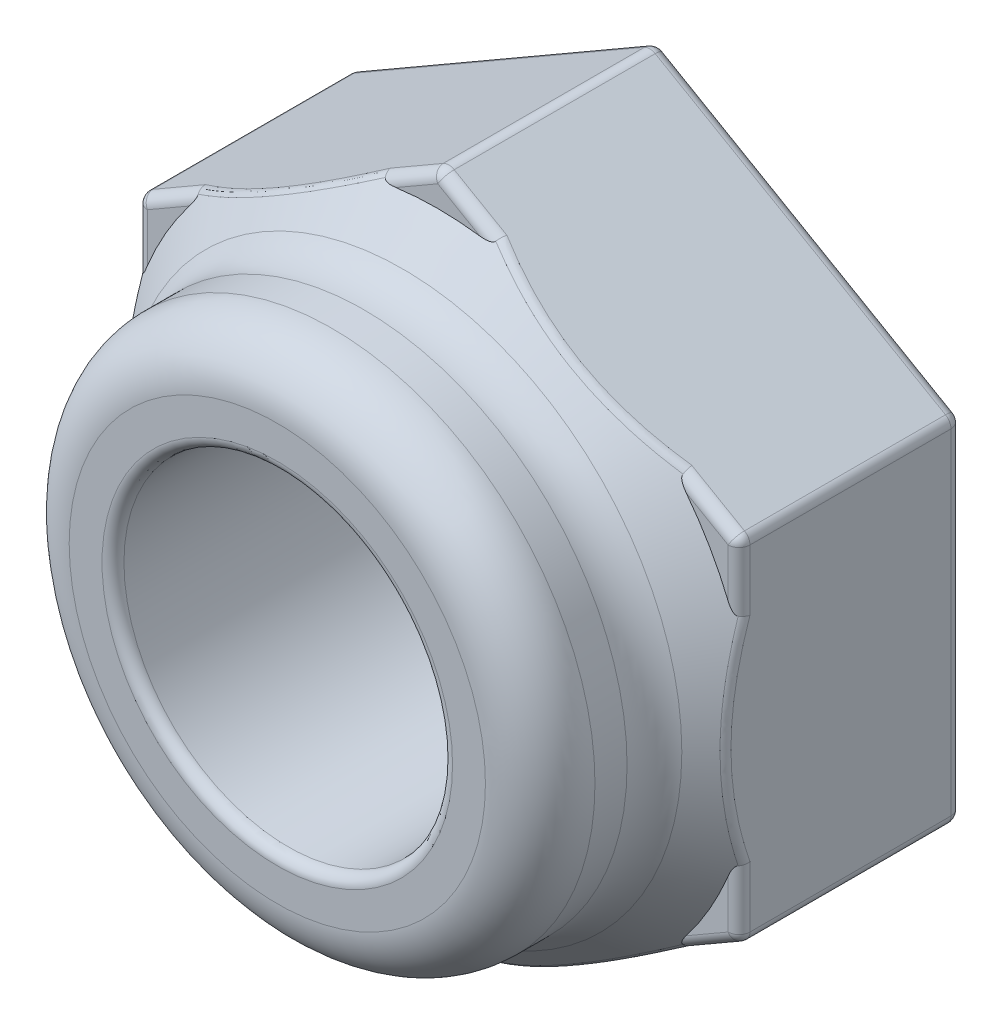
ISO-10303-21;
HEADER;
FILE_DESCRIPTION(('STEP AP214'),'2;1');
FILE_NAME('part.step','',(''),(''),'','','');
FILE_SCHEMA(('AUTOMOTIVE_DESIGN { 1 0 10303 214 1 1 1 1 }'));
ENDSEC;
DATA;
#1=APPLICATION_CONTEXT('core data for automotive mechanical design processes');
#2=APPLICATION_PROTOCOL_DEFINITION('international standard','automotive_design',2000,#1);
#3=PRODUCT_CONTEXT('',#1,'mechanical');
#4=PRODUCT('Part','Part','',(#3));
#5=PRODUCT_RELATED_PRODUCT_CATEGORY('part','',(#4));
#6=PRODUCT_DEFINITION_FORMATION('','',#4);
#7=PRODUCT_DEFINITION_CONTEXT('part definition',#1,'design');
#8=PRODUCT_DEFINITION('design','',#6,#7);
#9=PRODUCT_DEFINITION_SHAPE('','',#8);
#10=(LENGTH_UNIT() NAMED_UNIT(*) SI_UNIT(.MILLI.,.METRE.));
#11=(NAMED_UNIT(*) PLANE_ANGLE_UNIT() SI_UNIT($,.RADIAN.));
#12=(NAMED_UNIT(*) SI_UNIT($,.STERADIAN.) SOLID_ANGLE_UNIT());
#13=UNCERTAINTY_MEASURE_WITH_UNIT(LENGTH_MEASURE(1.E-05),#10,'distance_accuracy_value','');
#14=(GEOMETRIC_REPRESENTATION_CONTEXT(3) GLOBAL_UNCERTAINTY_ASSIGNED_CONTEXT((#13)) GLOBAL_UNIT_ASSIGNED_CONTEXT((#10,
#11,#12)) REPRESENTATION_CONTEXT('',''));
#15=CARTESIAN_POINT('',(0.,0.,0.));
#16=DIRECTION('',(0.,0.,1.));
#17=DIRECTION('',(1.,0.,0.));
#18=AXIS2_PLACEMENT_3D('',#15,#16,#17);
#19=CARTESIAN_POINT('',(2.75,1.58771324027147,2.5));
#20=DIRECTION('',(-0.5,-0.866025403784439,0.));
#21=DIRECTION('',(0.866025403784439,-0.5,0.));
#22=AXIS2_PLACEMENT_3D('',#19,#20,#21);
#23=PLANE('',#22);
#24=DIRECTION('',(-0.866025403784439,0.5,0.));
#25=VECTOR('',#24,1.);
#26=CARTESIAN_POINT('',(0.679233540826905,2.7832708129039,1.93504718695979));
#27=LINE('',#26,#25);
#28=CARTESIAN_POINT('',(0.0499999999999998,3.14655896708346,1.93504718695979));
#29=VERTEX_POINT('',#28);
#30=CARTESIAN_POINT('',(0.530978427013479,2.86886594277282,1.93504718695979));
#31=VERTEX_POINT('',#30);
#32=EDGE_CURVE('E672',#29,#31,#27,.F.);
#33=ORIENTED_EDGE('',*,*,#32,.T.);
#34=CARTESIAN_POINT('',(-1.21749697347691,3.81784325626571,0.892728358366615));
#35=CARTESIAN_POINT('',(-1.17669346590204,3.85479076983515,0.869924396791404));
#36=CARTESIAN_POINT('',(-1.14601351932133,3.83707769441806,0.822017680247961));
#37=CARTESIAN_POINT('',(-1.15081349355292,3.780127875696,0.948909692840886));
#38=CARTESIAN_POINT('',(-1.11053253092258,3.81659273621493,0.925755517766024));
#39=CARTESIAN_POINT('',(-1.080205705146,3.79908353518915,0.878199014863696));
#40=CARTESIAN_POINT('',(-1.0836798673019,3.74217762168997,1.00446037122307));
#41=CARTESIAN_POINT('',(-1.04380628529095,3.77806832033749,0.981079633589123));
#42=CARTESIAN_POINT('',(-1.01399552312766,3.76085706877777,0.933749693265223));
#43=CARTESIAN_POINT('',(-0.948322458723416,3.66569692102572,1.11402684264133));
#44=CARTESIAN_POINT('',(-0.909300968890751,3.7004116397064,1.09019085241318));
#45=CARTESIAN_POINT('',(-0.880596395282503,3.6838390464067,1.0433161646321));
#46=CARTESIAN_POINT('',(-0.880098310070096,3.62716627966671,1.16804210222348));
#47=CARTESIAN_POINT('',(-0.841542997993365,3.66129155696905,1.14397150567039));
#48=CARTESIAN_POINT('',(-0.813407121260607,3.64504730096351,1.09733142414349));
#49=CARTESIAN_POINT('',(-0.672140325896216,3.50976759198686,1.32842253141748));
#50=CARTESIAN_POINT('',(-0.635586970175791,3.54238278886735,1.30324195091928));
#51=CARTESIAN_POINT('',(-0.608766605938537,3.52689804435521,1.25771185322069));
#52=CARTESIAN_POINT('',(-0.53050310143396,3.42987438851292,1.43193919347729));
#53=CARTESIAN_POINT('',(-0.495157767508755,3.46130595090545,1.40628163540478));
#54=CARTESIAN_POINT('',(-0.469607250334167,3.44655435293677,1.36122851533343));
#55=CARTESIAN_POINT('',(-0.234349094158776,3.26286227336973,1.63176505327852));
#56=CARTESIAN_POINT('',(-0.201721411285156,3.29189039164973,1.60508729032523));
#57=CARTESIAN_POINT('',(-0.179187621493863,3.27888050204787,1.56105437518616));
#58=CARTESIAN_POINT('',(-0.0795403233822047,3.17558035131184,1.72757165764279));
#59=CARTESIAN_POINT('',(-0.0485208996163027,3.20344003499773,1.70047567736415));
#60=CARTESIAN_POINT('',(-0.027664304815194,3.19139847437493,1.65686097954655));
#61=CARTESIAN_POINT('',(0.238843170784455,2.99584014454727,1.89895230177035));
#62=CARTESIAN_POINT('',(0.266389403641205,3.02162648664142,1.87092619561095));
#63=CARTESIAN_POINT('',(0.283317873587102,3.01185282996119,1.82824162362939));
#64=CARTESIAN_POINT('',(0.402371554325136,2.90340912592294,1.97462256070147));
#65=CARTESIAN_POINT('',(0.428063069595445,2.92828415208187,1.94635594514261));
#66=CARTESIAN_POINT('',(0.442734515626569,2.9198135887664,1.90391188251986));
#67=CARTESIAN_POINT('',(0.632197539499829,2.77298988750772,2.05665153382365));
#68=CARTESIAN_POINT('',(0.655600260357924,2.7969154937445,2.0280983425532));
#69=CARTESIAN_POINT('',(0.666489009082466,2.79062887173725,1.98594085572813));
#70=CARTESIAN_POINT('',(0.694489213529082,2.73759198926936,2.07655721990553));
#71=CARTESIAN_POINT('',(0.717119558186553,2.76139731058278,2.04789485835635));
#72=CARTESIAN_POINT('',(0.727107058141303,2.75563102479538,2.00584654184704));
#73=CARTESIAN_POINT('',(0.82018085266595,2.66603605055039,2.11154279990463));
#74=CARTESIAN_POINT('',(0.841215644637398,2.68975040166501,2.08266464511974));
#75=CARTESIAN_POINT('',(0.849392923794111,2.68502924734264,2.04083212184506));
#76=CARTESIAN_POINT('',(0.883581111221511,2.62987780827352,2.12662139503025));
#77=CARTESIAN_POINT('',(0.903829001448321,2.65360056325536,2.09766007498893));
#78=CARTESIAN_POINT('',(0.911061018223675,2.64942515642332,2.05591071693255));
#79=CARTESIAN_POINT('',(1.0736118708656,2.52126158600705,2.1633873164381));
#80=CARTESIAN_POINT('',(1.09131635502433,2.5453546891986,2.13415185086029));
#81=CARTESIAN_POINT('',(1.09590157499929,2.54270741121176,2.09267663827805));
#82=CARTESIAN_POINT('',(1.20157541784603,2.44781066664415,2.17716649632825));
#83=CARTESIAN_POINT('',(1.21794655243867,2.47224471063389,2.14788972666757));
#84=CARTESIAN_POINT('',(1.22037226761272,2.47084422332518,2.10645581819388));
#85=CARTESIAN_POINT('',(1.44561928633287,2.30702352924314,2.18078287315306));
#86=CARTESIAN_POINT('',(1.45930359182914,2.332897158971,2.15148447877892));
#87=CARTESIAN_POINT('',(1.45803028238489,2.3336323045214,2.11007219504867));
#88=CARTESIAN_POINT('',(1.56170698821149,2.23974821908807,2.17271121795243));
#89=CARTESIAN_POINT('',(1.57442150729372,2.26643379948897,2.14343989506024));
#90=CARTESIAN_POINT('',(1.57119937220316,2.26829410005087,2.10200053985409));
#91=CARTESIAN_POINT('',(1.79224350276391,2.10560151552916,2.13811341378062));
#92=CARTESIAN_POINT('',(1.80302530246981,2.13444933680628,2.10906788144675));
#93=CARTESIAN_POINT('',(1.79634101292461,2.13830851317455,2.06740273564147));
#94=CARTESIAN_POINT('',(1.90666896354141,2.0387388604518,2.11142578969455));
#95=CARTESIAN_POINT('',(1.91679867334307,2.068762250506,2.08248324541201));
#96=CARTESIAN_POINT('',(1.90829432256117,2.07367223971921,2.04071511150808));
#97=CARTESIAN_POINT('',(2.12440257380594,1.91113070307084,2.04490901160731));
#98=CARTESIAN_POINT('',(2.13336161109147,1.94372958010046,2.01639172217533));
#99=CARTESIAN_POINT('',(2.12176488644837,1.95042495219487,1.97419833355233));
#100=CARTESIAN_POINT('',(2.22796255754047,1.85026124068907,2.00598391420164));
#101=CARTESIAN_POINT('',(2.23659334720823,1.88412870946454,1.97764510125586));
#102=CARTESIAN_POINT('',(2.22350154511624,1.89168726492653,1.9352732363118));
#103=CARTESIAN_POINT('',(2.43135839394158,1.73050704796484,1.91769298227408));
#104=CARTESIAN_POINT('',(2.43950667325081,1.76697664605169,1.88987272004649));
#105=CARTESIAN_POINT('',(2.42368678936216,1.77611026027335,1.8469823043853));
#106=CARTESIAN_POINT('',(2.53118628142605,1.67162658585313,1.86830616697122));
#107=CARTESIAN_POINT('',(2.53924970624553,1.7093899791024,1.840723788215));
#108=CARTESIAN_POINT('',(2.52212830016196,1.71927502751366,1.79759548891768));
#109=CARTESIAN_POINT('',(2.72531816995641,1.55703260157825,1.76281409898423));
#110=CARTESIAN_POINT('',(2.73336673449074,1.59731646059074,1.73582537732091));
#111=CARTESIAN_POINT('',(2.71387096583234,1.60857234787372,1.69210342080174));
#112=CARTESIAN_POINT('',(2.81969176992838,1.50127979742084,1.70685780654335));
#113=CARTESIAN_POINT('',(2.82782762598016,1.54277943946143,1.68014984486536));
#114=CARTESIAN_POINT('',(2.8072347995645,1.55466871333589,1.63614712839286));
#115=CARTESIAN_POINT('',(3.00501573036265,1.39177252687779,1.58953031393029));
#116=CARTESIAN_POINT('',(3.01349382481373,1.43558500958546,1.56341497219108));
#117=CARTESIAN_POINT('',(2.99081415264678,1.44867912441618,1.51881963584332));
#118=CARTESIAN_POINT('',(3.09598016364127,1.33800986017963,1.52818596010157));
#119=CARTESIAN_POINT('',(3.10469457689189,1.38293023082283,1.50234284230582));
#120=CARTESIAN_POINT('',(3.08104246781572,1.39658578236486,1.45747528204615));
#121=CARTESIAN_POINT('',(3.1857123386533,1.28499665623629,1.46489017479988));
#122=CARTESIAN_POINT('',(3.19436788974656,1.33115731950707,1.43959538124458));
#123=CARTESIAN_POINT('',(3.17013543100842,1.34514793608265,1.39417949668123));
#124=(BOUNDED_SURFACE() B_SPLINE_SURFACE(3,2,((#34,#35,#36),(#37,#38,#39),(#40,#41,#42),(#43,
#44,#45),(#46,#47,#48),(#49,#50,#51),(#52,#53,#54),(#55,#56,#57),(#58,#59,#60),(#61,#62,#63),
(#64,#65,#66),(#67,#68,#69),(#70,#71,#72),(#73,#74,#75),(#76,#77,#78),(#79,#80,#81),(#82,#83,
#84),(#85,#86,#87),(#88,#89,#90),(#91,#92,#93),(#94,#95,#96),(#97,#98,#99),(#100,#101,#102),
(#103,#104,#105),(#106,#107,#108),(#109,#110,#111),(#112,#113,#114),(#115,#116,#117),(#118,#119,
#120),(#121,#122,#123)),.UNSPECIFIED.,.F.,.F.,.F.) B_SPLINE_SURFACE_WITH_KNOTS((4,2,2,2,2,2,2,2,
2,2,2,2,2,2,4),(3,3),(0.,0.28349548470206,0.567088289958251,1.14018062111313,1.73796108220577,
2.33283162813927,2.55099212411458,2.76921126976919,3.20036219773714,3.59174425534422,
3.98656407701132,4.35722482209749,4.7286360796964,5.0928404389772,5.45532321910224),(0.,1.),
.UNSPECIFIED.) GEOMETRIC_REPRESENTATION_ITEM() RATIONAL_B_SPLINE_SURFACE(((1.,0.859071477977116,
1.),(1.,0.861048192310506,1.),(1.,0.863081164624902,1.),(1.,0.867255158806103,1.),(1.,
0.869396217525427,1.),(1.,0.876018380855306,1.),(1.,0.880657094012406,1.),(1.,0.890370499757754,
1.),(1.,0.89545536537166,1.),(1.,0.905262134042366,1.),(1.,0.909985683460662,1.),(1.,
0.915365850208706,1.),(1.,0.916703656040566,1.),(1.,0.919090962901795,1.),(1.,0.920140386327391,
1.),(1.,0.92272197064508,1.),(1.,0.923725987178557,1.),(1.,0.923987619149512,1.),(1.,
0.923397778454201,1.),(1.,0.920940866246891,1.),(1.,0.91906262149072,1.),(1.,0.914576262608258,
1.),(1.,0.912019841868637,1.),(1.,0.906487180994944,1.),(1.,0.903510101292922,1.),(1.,
0.897470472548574,1.),(1.,0.894410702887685,1.),(1.,0.888313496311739,1.),(1.,0.885276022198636,
1.),(1.,0.882314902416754,1.))) REPRESENTATION_ITEM('') SURFACE());
#125=CARTESIAN_POINT('',(-1.14601351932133,3.83707769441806,0.822017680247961));
#126=CARTESIAN_POINT('',(-1.080205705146,3.79908353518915,0.878199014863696));
#127=CARTESIAN_POINT('',(-1.01399552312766,3.76085706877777,0.933749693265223));
#128=CARTESIAN_POINT('',(-0.880596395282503,3.6838390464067,1.0433161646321));
#129=CARTESIAN_POINT('',(-0.813407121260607,3.64504730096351,1.09733142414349));
#130=CARTESIAN_POINT('',(-0.608766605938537,3.5268980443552,1.25771185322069));
#131=CARTESIAN_POINT('',(-0.469607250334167,3.44655435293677,1.36122851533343));
#132=CARTESIAN_POINT('',(-0.179187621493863,3.27888050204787,1.56105437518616));
#133=CARTESIAN_POINT('',(-0.0276643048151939,3.19139847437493,1.65686097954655));
#134=CARTESIAN_POINT('',(0.283317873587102,3.01185282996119,1.82824162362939));
#135=CARTESIAN_POINT('',(0.442734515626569,2.9198135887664,1.90391188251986));
#136=CARTESIAN_POINT('',(0.666489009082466,2.79062887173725,1.98594085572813));
#137=CARTESIAN_POINT('',(0.727107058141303,2.75563102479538,2.00584654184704));
#138=CARTESIAN_POINT('',(0.849392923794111,2.68502924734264,2.04083212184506));
#139=CARTESIAN_POINT('',(0.911061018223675,2.64942515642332,2.05591071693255));
#140=CARTESIAN_POINT('',(1.09590157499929,2.54270741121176,2.09267663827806));
#141=CARTESIAN_POINT('',(1.22037226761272,2.47084422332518,2.10645581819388));
#142=CARTESIAN_POINT('',(1.45803028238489,2.3336323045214,2.11007219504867));
#143=CARTESIAN_POINT('',(1.57119937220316,2.26829410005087,2.10200053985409));
#144=CARTESIAN_POINT('',(1.79634101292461,2.13830851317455,2.06740273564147));
#145=CARTESIAN_POINT('',(1.90829432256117,2.07367223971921,2.04071511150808));
#146=CARTESIAN_POINT('',(2.12176488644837,1.95042495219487,1.97419833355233));
#147=CARTESIAN_POINT('',(2.22350154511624,1.89168726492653,1.9352732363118));
#148=CARTESIAN_POINT('',(2.42368678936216,1.77611026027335,1.8469823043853));
#149=CARTESIAN_POINT('',(2.52212830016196,1.71927502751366,1.79759548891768));
#150=CARTESIAN_POINT('',(2.71387096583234,1.60857234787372,1.69210342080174));
#151=CARTESIAN_POINT('',(2.8072347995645,1.55466871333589,1.63614712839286));
#152=CARTESIAN_POINT('',(2.99081415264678,1.44867912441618,1.51881963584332));
#153=CARTESIAN_POINT('',(3.08104246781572,1.39658578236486,1.45747528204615));
#154=CARTESIAN_POINT('',(3.17013543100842,1.34514793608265,1.39417949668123));
#155=B_SPLINE_CURVE_WITH_KNOTS('',3,(#125,#126,#127,#128,#129,#130,#131,#132,#133,#134,#135,
#136,#137,#138,#139,#140,#141,#142,#143,#144,#145,#146,#147,#148,#149,#150,#151,#152,#153,#154),
.UNSPECIFIED.,.F.,.F.,(4,2,2,2,2,2,2,2,2,2,2,2,2,2,4),(0.,0.28349548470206,0.567088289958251,
1.14018062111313,1.73796108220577,2.33283162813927,2.55099212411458,2.76921126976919,
3.20036219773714,3.59174425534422,3.98656407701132,4.35722482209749,4.7286360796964,
5.0928404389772,5.45532321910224),.UNSPECIFIED.);
#156=CARTESIAN_POINT('',(2.21902157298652,1.89427377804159,1.93504718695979));
#157=VERTEX_POINT('',#156);
#158=EDGE_CURVE('E663',#31,#157,#155,.T.);
#159=ORIENTED_EDGE('',*,*,#158,.T.);
#160=DIRECTION('',(-0.866025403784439,0.5,0.));
#161=VECTOR('',#160,1.);
#162=CARTESIAN_POINT('',(2.75,1.58771324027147,1.93504718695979));
#163=LINE('',#162,#161);
#164=CARTESIAN_POINT('',(2.7,1.61658075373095,1.93504718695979));
#165=VERTEX_POINT('',#164);
#166=EDGE_CURVE('E850',#157,#165,#163,.F.);
#167=ORIENTED_EDGE('',*,*,#166,.T.);
#168=DIRECTION('',(0.,0.,-1.));
#169=VECTOR('',#168,1.);
#170=CARTESIAN_POINT('',(2.7,1.61658075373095,2.5));
#171=LINE('',#170,#169);
#172=CARTESIAN_POINT('',(2.7,1.61658075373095,0.0999999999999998));
#173=VERTEX_POINT('',#172);
#174=EDGE_CURVE('E927',#165,#173,#171,.T.);
#175=ORIENTED_EDGE('',*,*,#174,.T.);
#176=DIRECTION('',(-0.866025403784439,0.5,0.));
#177=VECTOR('',#176,1.);
#178=CARTESIAN_POINT('',(2.75,1.58771324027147,0.0999999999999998));
#179=LINE('',#178,#177);
#180=CARTESIAN_POINT('',(0.0499999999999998,3.14655896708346,0.0999999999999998));
#181=VERTEX_POINT('',#180);
#182=EDGE_CURVE('E825',#173,#181,#179,.T.);
#183=ORIENTED_EDGE('',*,*,#182,.T.);
#184=DIRECTION('',(0.,0.,-1.));
#185=VECTOR('',#184,1.);
#186=CARTESIAN_POINT('',(0.0499999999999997,3.14655896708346,2.5));
#187=LINE('',#186,#185);
#188=EDGE_CURVE('E939',#181,#29,#187,.F.);
#189=ORIENTED_EDGE('',*,*,#188,.T.);
#190=EDGE_LOOP('',(#33,#159,#167,#175,#183,#189));
#191=FACE_BOUND('',#190,.T.);
#192=ADVANCED_FACE('F32',(#191),#23,.F.);
#193=CARTESIAN_POINT('',(0.,3.17542648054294,2.5));
#194=DIRECTION('',(0.5,-0.866025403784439,0.));
#195=DIRECTION('',(0.866025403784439,0.5,0.));
#196=AXIS2_PLACEMENT_3D('',#193,#194,#195);
#197=PLANE('',#196);
#198=DIRECTION('',(-0.866025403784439,-0.5,0.));
#199=VECTOR('',#198,1.);
#200=CARTESIAN_POINT('',(-2.07076645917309,1.97986890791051,1.93504718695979));
#201=LINE('',#200,#199);
#202=CARTESIAN_POINT('',(-2.7,1.61658075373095,1.93504718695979));
#203=VERTEX_POINT('',#202);
#204=CARTESIAN_POINT('',(-2.21902157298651,1.89427377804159,1.93504718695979));
#205=VERTEX_POINT('',#204);
#206=EDGE_CURVE('E930',#203,#205,#201,.F.);
#207=ORIENTED_EDGE('',*,*,#206,.T.);
#208=CARTESIAN_POINT('',(-3.91509773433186,0.854538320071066,0.892728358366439));
#209=CARTESIAN_POINT('',(-3.92669346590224,0.908348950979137,0.869924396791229));
#210=CARTESIAN_POINT('',(-3.89601351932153,0.926062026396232,0.822017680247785));
#211=CARTESIAN_POINT('',(-3.84909351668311,0.89343021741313,0.948909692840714));
#212=CARTESIAN_POINT('',(-3.86053253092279,0.946546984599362,0.925755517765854));
#213=CARTESIAN_POINT('',(-3.8302057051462,0.96405618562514,0.878199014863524));
#214=CARTESIAN_POINT('',(-3.7826608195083,0.932594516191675,1.0044603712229));
#215=CARTESIAN_POINT('',(-3.79380628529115,0.985071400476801,0.981079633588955));
#216=CARTESIAN_POINT('',(-3.76399552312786,1.00228265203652,0.933749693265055));
#217=CARTESIAN_POINT('',(-3.64874788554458,1.01157712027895,1.11402684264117));
#218=CARTESIAN_POINT('',(-3.65930096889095,1.06272808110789,1.09019085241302));
#219=CARTESIAN_POINT('',(-3.6305963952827,1.07930067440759,1.04331616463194));
#220=CARTESIAN_POINT('',(-3.58126729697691,1.05139564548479,1.16804210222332));
#221=CARTESIAN_POINT('',(-3.59154299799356,1.10184816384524,1.14397150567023));
#222=CARTESIAN_POINT('',(-3.5634071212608,1.11809241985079,1.09733142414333));
#223=CARTESIAN_POINT('',(-3.37561805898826,1.17279319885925,1.32842253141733));
#224=CARTESIAN_POINT('',(-3.38558697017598,1.22075693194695,1.30324195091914));
#225=CARTESIAN_POINT('',(-3.35876660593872,1.23624167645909,1.25771185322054));
#226=CARTESIAN_POINT('',(-3.23560990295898,1.25550803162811,1.43193919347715));
#227=CARTESIAN_POINT('',(-3.24515776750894,1.30183376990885,1.40628163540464));
#228=CARTESIAN_POINT('',(-3.21960725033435,1.31658536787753,1.3612285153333));
#229=CARTESIAN_POINT('',(-2.94289616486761,1.42847886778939,1.6317650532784));
#230=CARTESIAN_POINT('',(-2.95172141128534,1.47124932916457,1.60508729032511));
#231=CARTESIAN_POINT('',(-2.92918762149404,1.48425921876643,1.56105437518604));
#232=CARTESIAN_POINT('',(-2.78990341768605,1.5189062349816,1.72757165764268));
#233=CARTESIAN_POINT('',(-2.79852089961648,1.55969968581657,1.70047567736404));
#234=CARTESIAN_POINT('',(-2.77766430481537,1.57174124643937,1.65686097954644));
#235=CARTESIAN_POINT('',(-2.47505208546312,1.7047643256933,1.89895230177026));
#236=CARTESIAN_POINT('',(-2.48361059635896,1.74151323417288,1.87092619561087));
#237=CARTESIAN_POINT('',(-2.46668212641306,1.75128689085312,1.8282416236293));
#238=CARTESIAN_POINT('',(-2.31324028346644,1.80016855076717,1.97462256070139));
#239=CARTESIAN_POINT('',(-2.32193693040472,1.83485556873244,1.94635594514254));
#240=CARTESIAN_POINT('',(-2.30726548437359,1.84332613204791,1.90391188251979));
#241=CARTESIAN_POINT('',(-2.08538091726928,1.93399407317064,2.0566515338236));
#242=CARTESIAN_POINT('',(-2.09439973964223,1.96622422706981,2.02809834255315));
#243=CARTESIAN_POINT('',(-2.08351099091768,1.97251084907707,1.98594085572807));
#244=CARTESIAN_POINT('',(-2.02357960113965,1.97024129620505,2.07655721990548));
#245=CARTESIAN_POINT('',(-2.03288044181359,2.00174241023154,2.04789485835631));
#246=CARTESIAN_POINT('',(-2.02289294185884,2.00750869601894,2.00584654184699));
#247=CARTESIAN_POINT('',(-1.89876452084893,2.04331547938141,2.1115427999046));
#248=CARTESIAN_POINT('',(-1.90878435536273,2.07338931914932,2.08266464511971));
#249=CARTESIAN_POINT('',(-1.90060707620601,2.07811047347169,2.04083212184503));
#250=CARTESIAN_POINT('',(-1.83575043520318,2.0801425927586,2.12662139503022));
#251=CARTESIAN_POINT('',(-1.8461709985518,2.10953915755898,2.0976600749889));
#252=CARTESIAN_POINT('',(-1.83893898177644,2.11371456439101,2.05591071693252));
#253=CARTESIAN_POINT('',(-1.64667064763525,2.19040594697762,2.16338731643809));
#254=CARTESIAN_POINT('',(-1.65868364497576,2.21778503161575,2.13415185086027));
#255=CARTESIAN_POINT('',(-1.6540984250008,2.22043230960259,2.09267663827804));
#256=CARTESIAN_POINT('',(-1.51907851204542,2.2645001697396,2.17716649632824));
#257=CARTESIAN_POINT('',(-1.5320534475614,2.29089501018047,2.14788972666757));
#258=CARTESIAN_POINT('',(-1.52962773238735,2.29229549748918,2.10645581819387));
#259=CARTESIAN_POINT('',(-1.27513134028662,2.40545479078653,2.18078287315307));
#260=CARTESIAN_POINT('',(-1.29069640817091,2.43024256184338,2.15148447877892));
#261=CARTESIAN_POINT('',(-1.29196971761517,2.42950741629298,2.11007219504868));
#262=CARTESIAN_POINT('',(-1.15882536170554,2.47235203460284,2.17271121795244));
#263=CARTESIAN_POINT('',(-1.17557849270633,2.4967059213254,2.14343989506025));
#264=CARTESIAN_POINT('',(-1.17880062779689,2.4948456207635,2.1020005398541));
#265=CARTESIAN_POINT('',(-0.927382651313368,2.6049291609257,2.13811341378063));
#266=CARTESIAN_POINT('',(-0.946974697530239,2.62869038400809,2.10906788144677));
#267=CARTESIAN_POINT('',(-0.953658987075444,2.62483120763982,2.06740273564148));
#268=CARTESIAN_POINT('',(-0.812265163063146,2.67059318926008,2.11142578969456));
#269=CARTESIAN_POINT('',(-0.833201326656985,2.69437747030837,2.08248324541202));
#270=CARTESIAN_POINT('',(-0.841705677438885,2.68946748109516,2.04071511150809));
#271=CARTESIAN_POINT('',(-0.592886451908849,2.79535194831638,2.04490901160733));
#272=CARTESIAN_POINT('',(-0.616638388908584,2.81941014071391,2.01639172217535));
#273=CARTESIAN_POINT('',(-0.628235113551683,2.8127147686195,1.97419833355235));
#274=CARTESIAN_POINT('',(-0.48839195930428,2.85460279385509,2.00598391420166));
#275=CARTESIAN_POINT('',(-0.51340665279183,2.87901101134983,1.97764510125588));
#276=CARTESIAN_POINT('',(-0.52649845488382,2.87145245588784,1.93527323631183));
#277=CARTESIAN_POINT('',(-0.282983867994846,2.97087165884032,1.91769298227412));
#278=CARTESIAN_POINT('',(-0.310493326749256,2.99616307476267,1.88987272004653));
#279=CARTESIAN_POINT('',(-0.326313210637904,2.98702946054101,1.84698230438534));
#280=CARTESIAN_POINT('',(-0.182077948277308,3.02788491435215,1.86830616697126));
#281=CARTESIAN_POINT('',(-0.21075029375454,3.05374974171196,1.84072378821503));
#282=CARTESIAN_POINT('',(-0.22787169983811,3.04386469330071,1.79759548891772));
#283=CARTESIAN_POINT('',(0.0142292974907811,3.13871106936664,1.76281409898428));
#284=CARTESIAN_POINT('',(-0.0166332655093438,3.16582326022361,1.73582537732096));
#285=CARTESIAN_POINT('',(-0.0361290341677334,3.15456737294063,1.69210342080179));
#286=CARTESIAN_POINT('',(0.109699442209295,3.19256460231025,1.70685780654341));
#287=CARTESIAN_POINT('',(0.077827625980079,3.22036028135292,1.68014984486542));
#288=CARTESIAN_POINT('',(0.0572347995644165,3.20847100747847,1.63614712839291));
#289=CARTESIAN_POINT('',(0.297197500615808,3.29830622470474,1.58953031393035));
#290=CARTESIAN_POINT('',(0.263493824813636,3.32755471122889,1.56341497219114));
#291=CARTESIAN_POINT('',(0.240814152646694,3.31446059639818,1.51881963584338));
#292=CARTESIAN_POINT('',(0.389239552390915,3.35020240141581,1.52818596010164));
#293=CARTESIAN_POINT('',(0.354694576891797,3.38020948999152,1.50234284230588));
#294=CARTESIAN_POINT('',(0.331042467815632,3.36655393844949,1.45747528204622));
#295=CARTESIAN_POINT('',(0.480016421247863,3.40140614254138,1.46489017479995));
#296=CARTESIAN_POINT('',(0.44436788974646,3.43198240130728,1.43959538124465));
#297=CARTESIAN_POINT('',(0.42013543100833,3.41799178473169,1.3941794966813));
#298=(BOUNDED_SURFACE() B_SPLINE_SURFACE(3,2,((#208,#209,#210),(#211,#212,#213),(#214,#215,
#216),(#217,#218,#219),(#220,#221,#222),(#223,#224,#225),(#226,#227,#228),(#229,#230,#231),
(#232,#233,#234),(#235,#236,#237),(#238,#239,#240),(#241,#242,#243),(#244,#245,#246),(#247,#248,
#249),(#250,#251,#252),(#253,#254,#255),(#256,#257,#258),(#259,#260,#261),(#262,#263,#264),
(#265,#266,#267),(#268,#269,#270),(#271,#272,#273),(#274,#275,#276),(#277,#278,#279),(#280,#281,
#282),(#283,#284,#285),(#286,#287,#288),(#289,#290,#291),(#292,#293,#294),(#295,#296,#297)),
.UNSPECIFIED.,.F.,.F.,.F.) B_SPLINE_SURFACE_WITH_KNOTS((4,2,2,2,2,2,2,2,2,2,2,2,2,2,4),(3,3),
(0.,0.283495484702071,0.567088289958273,1.14018062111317,1.73796108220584,2.33283162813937,
2.55099212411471,2.76921126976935,3.20036219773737,3.59174425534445,3.98656407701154,
4.3572248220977,4.72863607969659,5.09284043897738,5.4553232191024),(0.,1.),
.UNSPECIFIED.) GEOMETRIC_REPRESENTATION_ITEM() RATIONAL_B_SPLINE_SURFACE(((1.,0.859071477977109,
1.),(1.,0.861048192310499,1.),(1.,0.863081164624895,1.),(1.,0.867255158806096,1.),(1.,
0.869396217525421,1.),(1.,0.8760183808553,1.),(1.,0.8806570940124,1.),(1.,0.890370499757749,1.),
(1.,0.895455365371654,1.),(1.,0.90526213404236,1.),(1.,0.909985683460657,1.),(1.,
0.915365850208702,1.),(1.,0.916703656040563,1.),(1.,0.919090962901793,1.),(1.,0.920140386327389,
1.),(1.,0.92272197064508,1.),(1.,0.923725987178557,1.),(1.,0.923987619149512,1.),(1.,
0.923397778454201,1.),(1.,0.920940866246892,1.),(1.,0.919062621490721,1.),(1.,0.914576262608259,
1.),(1.,0.912019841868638,1.),(1.,0.906487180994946,1.),(1.,0.903510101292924,1.),(1.,
0.897470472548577,1.),(1.,0.894410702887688,1.),(1.,0.888313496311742,1.),(1.,0.885276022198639,
1.),(1.,0.882314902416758,1.))) REPRESENTATION_ITEM('') SURFACE());
#299=CARTESIAN_POINT('',(-3.89601351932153,0.926062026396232,0.822017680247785));
#300=CARTESIAN_POINT('',(-3.8302057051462,0.964056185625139,0.878199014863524));
#301=CARTESIAN_POINT('',(-3.76399552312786,1.00228265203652,0.933749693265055));
#302=CARTESIAN_POINT('',(-3.6305963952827,1.07930067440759,1.04331616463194));
#303=CARTESIAN_POINT('',(-3.5634071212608,1.11809241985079,1.09733142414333));
#304=CARTESIAN_POINT('',(-3.35876660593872,1.23624167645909,1.25771185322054));
#305=CARTESIAN_POINT('',(-3.21960725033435,1.31658536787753,1.3612285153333));
#306=CARTESIAN_POINT('',(-2.92918762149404,1.48425921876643,1.56105437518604));
#307=CARTESIAN_POINT('',(-2.77766430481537,1.57174124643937,1.65686097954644));
#308=CARTESIAN_POINT('',(-2.46668212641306,1.75128689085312,1.8282416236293));
#309=CARTESIAN_POINT('',(-2.30726548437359,1.84332613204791,1.90391188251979));
#310=CARTESIAN_POINT('',(-2.08351099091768,1.97251084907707,1.98594085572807));
#311=CARTESIAN_POINT('',(-2.02289294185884,2.00750869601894,2.00584654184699));
#312=CARTESIAN_POINT('',(-1.90060707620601,2.07811047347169,2.04083212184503));
#313=CARTESIAN_POINT('',(-1.83893898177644,2.11371456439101,2.05591071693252));
#314=CARTESIAN_POINT('',(-1.6540984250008,2.22043230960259,2.09267663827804));
#315=CARTESIAN_POINT('',(-1.52962773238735,2.29229549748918,2.10645581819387));
#316=CARTESIAN_POINT('',(-1.29196971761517,2.42950741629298,2.11007219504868));
#317=CARTESIAN_POINT('',(-1.17880062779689,2.4948456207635,2.1020005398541));
#318=CARTESIAN_POINT('',(-0.953658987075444,2.62483120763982,2.06740273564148));
#319=CARTESIAN_POINT('',(-0.841705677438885,2.68946748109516,2.04071511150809));
#320=CARTESIAN_POINT('',(-0.628235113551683,2.8127147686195,1.97419833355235));
#321=CARTESIAN_POINT('',(-0.52649845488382,2.87145245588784,1.93527323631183));
#322=CARTESIAN_POINT('',(-0.326313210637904,2.98702946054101,1.84698230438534));
#323=CARTESIAN_POINT('',(-0.22787169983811,3.04386469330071,1.79759548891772));
#324=CARTESIAN_POINT('',(-0.0361290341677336,3.15456737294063,1.69210342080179));
#325=CARTESIAN_POINT('',(0.0572347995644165,3.20847100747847,1.63614712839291));
#326=CARTESIAN_POINT('',(0.240814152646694,3.31446059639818,1.51881963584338));
#327=CARTESIAN_POINT('',(0.331042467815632,3.36655393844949,1.45747528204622));
#328=CARTESIAN_POINT('',(0.42013543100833,3.41799178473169,1.3941794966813));
#329=B_SPLINE_CURVE_WITH_KNOTS('',3,(#299,#300,#301,#302,#303,#304,#305,#306,#307,#308,#309,
#310,#311,#312,#313,#314,#315,#316,#317,#318,#319,#320,#321,#322,#323,#324,#325,#326,#327,#328),
.UNSPECIFIED.,.F.,.F.,(4,2,2,2,2,2,2,2,2,2,2,2,2,2,4),(0.,0.283495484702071,0.567088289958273,
1.14018062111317,1.73796108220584,2.33283162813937,2.55099212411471,2.76921126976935,
3.20036219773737,3.59174425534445,3.98656407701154,4.3572248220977,4.72863607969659,
5.09284043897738,5.4553232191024),.UNSPECIFIED.);
#330=CARTESIAN_POINT('',(-0.530978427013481,2.86886594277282,1.93504718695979));
#331=VERTEX_POINT('',#330);
#332=EDGE_CURVE('E925',#205,#331,#329,.T.);
#333=ORIENTED_EDGE('',*,*,#332,.T.);
#334=DIRECTION('',(-0.866025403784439,-0.5,0.));
#335=VECTOR('',#334,1.);
#336=CARTESIAN_POINT('',(0.,3.17542648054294,1.93504718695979));
#337=LINE('',#336,#335);
#338=CARTESIAN_POINT('',(-0.0500000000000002,3.14655896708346,1.93504718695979));
#339=VERTEX_POINT('',#338);
#340=EDGE_CURVE('E954',#331,#339,#337,.F.);
#341=ORIENTED_EDGE('',*,*,#340,.T.);
#342=DIRECTION('',(0.,0.,-1.));
#343=VECTOR('',#342,1.);
#344=CARTESIAN_POINT('',(-0.0500000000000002,3.14655896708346,2.5));
#345=LINE('',#344,#343);
#346=CARTESIAN_POINT('',(-0.0500000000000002,3.14655896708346,0.0999999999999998));
#347=VERTEX_POINT('',#346);
#348=EDGE_CURVE('E944',#339,#347,#345,.T.);
#349=ORIENTED_EDGE('',*,*,#348,.T.);
#350=DIRECTION('',(-0.866025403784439,-0.5,0.));
#351=VECTOR('',#350,1.);
#352=CARTESIAN_POINT('',(0.,3.17542648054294,0.0999999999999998));
#353=LINE('',#352,#351);
#354=CARTESIAN_POINT('',(-2.7,1.61658075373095,0.0999999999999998));
#355=VERTEX_POINT('',#354);
#356=EDGE_CURVE('E1274',#347,#355,#353,.T.);
#357=ORIENTED_EDGE('',*,*,#356,.T.);
#358=DIRECTION('',(0.,0.,-1.));
#359=VECTOR('',#358,1.);
#360=CARTESIAN_POINT('',(-2.7,1.61658075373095,2.5));
#361=LINE('',#360,#359);
#362=EDGE_CURVE('E1276',#355,#203,#361,.F.);
#363=ORIENTED_EDGE('',*,*,#362,.T.);
#364=EDGE_LOOP('',(#207,#333,#341,#349,#357,#363));
#365=FACE_BOUND('',#364,.T.);
#366=ADVANCED_FACE('F652',(#365),#197,.F.);
#367=CARTESIAN_POINT('',(-2.75,1.58771324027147,2.5));
#368=DIRECTION('',(1.,0.,0.));
#369=DIRECTION('',(0.,1.,0.));
#370=AXIS2_PLACEMENT_3D('',#367,#368,#369);
#371=PLANE('',#370);
#372=CARTESIAN_POINT('',(-2.71142840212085,-1.54586584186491,1.77885514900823));
#373=CARTESIAN_POINT('',(-2.75,-1.53253884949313,1.75194759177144));
#374=CARTESIAN_POINT('',(-2.75,-1.51084368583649,1.70814447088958));
#375=CARTESIAN_POINT('',(-2.71228185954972,-1.45857186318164,1.82132311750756));
#376=CARTESIAN_POINT('',(-2.75,-1.44595821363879,1.79405690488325));
#377=CARTESIAN_POINT('',(-2.75,-1.42504820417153,1.7506124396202));
#378=CARTESIAN_POINT('',(-2.71313186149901,-1.37002149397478,1.86167376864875));
#379=CARTESIAN_POINT('',(-2.75,-1.35789952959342,1.83420998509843));
#380=CARTESIAN_POINT('',(-2.75,-1.3381148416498,1.79096309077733));
#381=CARTESIAN_POINT('',(-2.71477679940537,-1.19001399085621,1.93699523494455));
#382=CARTESIAN_POINT('',(-2.75,-1.17905239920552,1.9091063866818));
#383=CARTESIAN_POINT('',(-2.75,-1.1615934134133,1.86628455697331));
#384=CARTESIAN_POINT('',(-2.71557152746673,-1.09854759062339,1.9719462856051));
#385=CARTESIAN_POINT('',(-2.75,-1.08823081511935,1.94387303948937));
#386=CARTESIAN_POINT('',(-2.75,-1.07199696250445,1.90123560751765));
#387=CARTESIAN_POINT('',(-2.71705541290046,-0.912374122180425,2.03519245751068));
#388=CARTESIAN_POINT('',(-2.75,-0.903528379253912,2.00673712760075));
#389=CARTESIAN_POINT('',(-2.75,-0.88983203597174,1.96448177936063));
#390=CARTESIAN_POINT('',(-2.71774389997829,-0.817650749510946,2.06344587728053));
#391=CARTESIAN_POINT('',(-2.75,-0.809576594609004,2.03484640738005));
#392=CARTESIAN_POINT('',(-2.75,-0.797248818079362,1.99273519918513));
#393=CARTESIAN_POINT('',(-2.71894117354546,-0.625917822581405,2.11148214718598));
#394=CARTESIAN_POINT('',(-2.75,-0.619595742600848,2.08258347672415));
#395=CARTESIAN_POINT('',(-2.75,-0.610026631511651,2.04077146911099));
#396=CARTESIAN_POINT('',(-2.71945025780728,-0.528912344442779,2.13127904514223));
#397=CARTESIAN_POINT('',(-2.75,-0.523476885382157,2.10228064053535));
#398=CARTESIAN_POINT('',(-2.75,-0.515391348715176,2.06056836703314));
#399=CARTESIAN_POINT('',(-2.72012814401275,-0.3582788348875,2.15732253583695));
#400=CARTESIAN_POINT('',(-2.75,-0.354528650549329,2.12816551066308));
#401=CARTESIAN_POINT('',(-2.75,-0.349034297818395,2.08661185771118));
#402=CARTESIAN_POINT('',(-2.72035070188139,-0.285025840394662,2.165740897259));
#403=CARTESIAN_POINT('',(-2.75,-0.282010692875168,2.13653675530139));
#404=CARTESIAN_POINT('',(-2.75,-0.277650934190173,2.0950302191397));
#405=CARTESIAN_POINT('',(-2.72064458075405,-0.13828690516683,2.1768216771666));
#406=CARTESIAN_POINT('',(-2.75,-0.136828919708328,2.14754594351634));
#407=CARTESIAN_POINT('',(-2.75,-0.13469229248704,2.1061109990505));
#408=CARTESIAN_POINT('',(-2.72071644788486,-0.0648027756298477,2.17950488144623));
#409=CARTESIAN_POINT('',(-2.75,-0.0641034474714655,2.15021429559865));
#410=CARTESIAN_POINT('',(-2.75,-0.063118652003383,2.10879420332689));
#411=CARTESIAN_POINT('',(-2.72070343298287,0.0912216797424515,2.17901855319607));
#412=CARTESIAN_POINT('',(-2.75,0.0902408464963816,2.14973082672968));
#413=CARTESIAN_POINT('',(-2.75,0.0888509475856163,2.10830787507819));
#414=CARTESIAN_POINT('',(-2.72059810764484,0.173760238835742,2.17508570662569));
#415=CARTESIAN_POINT('',(-2.75,0.17193796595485,2.14581916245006));
#416=CARTESIAN_POINT('',(-2.75,0.169245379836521,2.10437502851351));
#417=CARTESIAN_POINT('',(-2.72020147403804,0.338124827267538,2.16008800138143));
#418=CARTESIAN_POINT('',(-2.75,0.334568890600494,2.13091837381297));
#419=CARTESIAN_POINT('',(-2.75,0.329392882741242,2.08937732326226));
#420=CARTESIAN_POINT('',(-2.71991007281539,0.419950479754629,2.14901957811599));
#421=CARTESIAN_POINT('',(-2.75,0.415590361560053,2.11990930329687));
#422=CARTESIAN_POINT('',(-2.75,0.409145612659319,2.0783088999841));
#423=CARTESIAN_POINT('',(-2.71916585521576,0.583160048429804,2.12017787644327));
#424=CARTESIAN_POINT('',(-2.75,0.577177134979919,2.09125109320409));
#425=CARTESIAN_POINT('',(-2.75,0.56831560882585,2.04946719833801));
#426=CARTESIAN_POINT('',(-2.71871130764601,0.664529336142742,2.10233256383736));
#427=CARTESIAN_POINT('',(-2.75,0.657800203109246,2.07350263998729));
#428=CARTESIAN_POINT('',(-2.75,0.647719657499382,2.03162188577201));
#429=CARTESIAN_POINT('',(-2.71767978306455,0.825504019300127,2.06077578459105));
#430=CARTESIAN_POINT('',(-2.75,0.817320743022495,2.03220254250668));
#431=CARTESIAN_POINT('',(-2.75,0.804930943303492,1.9900651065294));
#432=CARTESIAN_POINT('',(-2.71710283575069,0.905109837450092,2.03706574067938));
#433=CARTESIAN_POINT('',(-2.75,0.89627283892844,2.0086190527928));
#434=CARTESIAN_POINT('',(-2.75,0.882738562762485,1.96635506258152));
#435=CARTESIAN_POINT('',(-2.71510119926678,1.16001179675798,1.95216440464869));
#436=CARTESIAN_POINT('',(-2.75,1.14970632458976,1.92404237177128));
#437=CARTESIAN_POINT('',(-2.75,1.13211150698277,1.88145372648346));
#438=CARTESIAN_POINT('',(-2.71351260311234,1.33153085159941,1.88095946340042));
#439=CARTESIAN_POINT('',(-2.75,1.32017975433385,1.8531000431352));
#440=CARTESIAN_POINT('',(-2.75,1.30026898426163,1.810248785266));
#441=CARTESIAN_POINT('',(-2.71026271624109,1.66608000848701,1.72202441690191));
#442=CARTESIAN_POINT('',(-2.75,1.65294955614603,1.69502690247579));
#443=CARTESIAN_POINT('',(-2.75,1.62893375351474,1.65131373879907));
#444=CARTESIAN_POINT('',(-2.70860118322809,1.82907713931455,1.63423543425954));
#445=CARTESIAN_POINT('',(-2.75,1.81521504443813,1.60763295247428));
#446=CARTESIAN_POINT('',(-2.75,1.78941115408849,1.56352475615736));
#447=CARTESIAN_POINT('',(-2.70543334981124,2.14204810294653,1.45148296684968));
#448=CARTESIAN_POINT('',(-2.75,2.12711089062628,1.42581413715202));
#449=CARTESIAN_POINT('',(-2.75,2.09807115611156,1.38077228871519));
#450=CARTESIAN_POINT('',(-2.70392356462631,2.2922810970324,1.356912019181));
#451=CARTESIAN_POINT('',(-2.75,2.27691787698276,1.33168014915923));
#452=CARTESIAN_POINT('',(-2.75,2.24648914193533,1.28620134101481));
#453=CARTESIAN_POINT('',(-2.70176956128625,2.51327846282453,1.2104008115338));
#454=CARTESIAN_POINT('',(-2.75,2.49701428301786,1.1861653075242));
#455=CARTESIAN_POINT('',(-2.75,2.46510140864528,1.13969013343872));
#456=CARTESIAN_POINT('',(-2.70107256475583,2.58593806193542,1.16099383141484));
#457=CARTESIAN_POINT('',(-2.75,2.5695619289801,1.13697557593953));
#458=CARTESIAN_POINT('',(-2.75,2.537024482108,1.09028315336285));
#459=CARTESIAN_POINT('',(-2.69971454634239,2.73015799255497,1.06078878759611));
#460=CARTESIAN_POINT('',(-2.75,2.7136173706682,1.03719462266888));
#461=CARTESIAN_POINT('',(-2.75,2.6798649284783,0.990078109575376));
#462=CARTESIAN_POINT('',(-2.69905351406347,2.80171863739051,1.00999113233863));
#463=CARTESIAN_POINT('',(-2.75,2.78510594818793,0.986607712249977));
#464=CARTESIAN_POINT('',(-2.75,2.750782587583,0.939280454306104));
#465=CARTESIAN_POINT('',(-2.69841102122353,2.87281982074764,0.9586149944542));
#466=CARTESIAN_POINT('',(-2.75,2.85600769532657,0.935549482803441));
#467=CARTESIAN_POINT('',(-2.75,2.82127980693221,0.887904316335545));
#468=(BOUNDED_SURFACE() B_SPLINE_SURFACE(3,2,((#372,#373,#374),(#375,#376,#377),(#378,#379,
#380),(#381,#382,#383),(#384,#385,#386),(#387,#388,#389),(#390,#391,#392),(#393,#394,#395),
(#396,#397,#398),(#399,#400,#401),(#402,#403,#404),(#405,#406,#407),(#408,#409,#410),(#411,#412,
#413),(#414,#415,#416),(#417,#418,#419),(#420,#421,#422),(#423,#424,#425),(#426,#427,#428),
(#429,#430,#431),(#432,#433,#434),(#435,#436,#437),(#438,#439,#440),(#441,#442,#443),(#444,#445,
#446),(#447,#448,#449),(#450,#451,#452),(#453,#454,#455),(#456,#457,#458),(#459,#460,#461),
(#462,#463,#464),(#465,#466,#467)),.UNSPECIFIED.,.F.,.F.,.F.) B_SPLINE_SURFACE_WITH_KNOTS((4,2,
2,2,2,2,2,2,2,2,2,2,2,2,2,4),(3,3),(0.,0.287284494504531,0.575596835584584,0.865659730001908,
1.15523888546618,1.37066031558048,1.58529966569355,1.82643301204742,2.06768691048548,
2.311580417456,2.55541481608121,3.10167858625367,3.64991946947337,4.17759972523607,
4.4393630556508,4.70105031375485),(0.,1.),
.UNSPECIFIED.) GEOMETRIC_REPRESENTATION_ITEM() RATIONAL_B_SPLINE_SURFACE(((1.,0.898410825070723,
1.),(1.,0.900786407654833,1.),(1.,0.903141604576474,1.),(1.,0.907683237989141,1.),(1.,
0.909869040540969,1.),(1.,0.913937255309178,1.),(1.,0.915817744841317,1.),(1.,0.919080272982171,
1.),(1.,0.920463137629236,1.),(1.,0.922302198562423,1.),(1.,0.922905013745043,1.),(1.,
0.923700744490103,1.),(1.,0.923895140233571,1.),(1.,0.923859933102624,1.),(1.,0.923575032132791,
1.),(1.,0.922500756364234,1.),(1.,0.921711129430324,1.),(1.,0.919690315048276,1.),(1.,
0.918454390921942,1.),(1.,0.915642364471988,1.),(1.,0.914066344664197,1.),(1.,0.908581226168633,
1.),(1.,0.904202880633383,1.),(1.,0.895172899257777,1.),(1.,0.890520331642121,1.),(1.,
0.881581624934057,1.),(1.,0.877288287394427,1.),(1.,0.871121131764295,1.),(1.,0.869118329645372,
1.),(1.,0.865203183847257,1.),(1.,0.863290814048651,1.),(1.,0.861426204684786,1.))) REPRESENTATION_ITEM('') SURFACE());
#469=CARTESIAN_POINT('',(-2.75,-1.51084368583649,1.70814447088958));
#470=CARTESIAN_POINT('',(-2.75,-1.42504820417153,1.7506124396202));
#471=CARTESIAN_POINT('',(-2.75,-1.3381148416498,1.79096309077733));
#472=CARTESIAN_POINT('',(-2.75,-1.1615934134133,1.86628455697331));
#473=CARTESIAN_POINT('',(-2.75,-1.07199696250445,1.90123560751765));
#474=CARTESIAN_POINT('',(-2.75,-0.88983203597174,1.96448177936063));
#475=CARTESIAN_POINT('',(-2.75,-0.797248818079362,1.99273519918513));
#476=CARTESIAN_POINT('',(-2.75,-0.610026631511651,2.04077146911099));
#477=CARTESIAN_POINT('',(-2.75,-0.515391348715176,2.06056836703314));
#478=CARTESIAN_POINT('',(-2.75,-0.349034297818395,2.08661185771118));
#479=CARTESIAN_POINT('',(-2.75,-0.277650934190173,2.0950302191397));
#480=CARTESIAN_POINT('',(-2.75,-0.13469229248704,2.1061109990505));
#481=CARTESIAN_POINT('',(-2.75,-0.063118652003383,2.10879420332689));
#482=CARTESIAN_POINT('',(-2.75,0.0888509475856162,2.10830787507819));
#483=CARTESIAN_POINT('',(-2.75,0.169245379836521,2.10437502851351));
#484=CARTESIAN_POINT('',(-2.75,0.329392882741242,2.08937732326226));
#485=CARTESIAN_POINT('',(-2.75,0.409145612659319,2.0783088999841));
#486=CARTESIAN_POINT('',(-2.75,0.56831560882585,2.04946719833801));
#487=CARTESIAN_POINT('',(-2.75,0.647719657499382,2.03162188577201));
#488=CARTESIAN_POINT('',(-2.75,0.804930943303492,1.9900651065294));
#489=CARTESIAN_POINT('',(-2.75,0.882738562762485,1.96635506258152));
#490=CARTESIAN_POINT('',(-2.75,1.13211150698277,1.88145372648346));
#491=CARTESIAN_POINT('',(-2.75,1.30026898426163,1.810248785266));
#492=CARTESIAN_POINT('',(-2.75,1.62893375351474,1.65131373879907));
#493=CARTESIAN_POINT('',(-2.75,1.78941115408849,1.56352475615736));
#494=CARTESIAN_POINT('',(-2.75,2.09807115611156,1.38077228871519));
#495=CARTESIAN_POINT('',(-2.75,2.24648914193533,1.28620134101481));
#496=CARTESIAN_POINT('',(-2.75,2.46510140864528,1.13969013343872));
#497=CARTESIAN_POINT('',(-2.75,2.537024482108,1.09028315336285));
#498=CARTESIAN_POINT('',(-2.75,2.6798649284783,0.990078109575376));
#499=CARTESIAN_POINT('',(-2.75,2.750782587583,0.939280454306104));
#500=CARTESIAN_POINT('',(-2.75,2.82127980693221,0.887904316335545));
#501=B_SPLINE_CURVE_WITH_KNOTS('',3,(#469,#470,#471,#472,#473,#474,#475,#476,#477,#478,#479,
#480,#481,#482,#483,#484,#485,#486,#487,#488,#489,#490,#491,#492,#493,#494,#495,#496,#497,#498,
#499,#500),.UNSPECIFIED.,.F.,.F.,(4,2,2,2,2,2,2,2,2,2,2,2,2,2,2,4),(0.,0.287284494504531,
0.575596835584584,0.865659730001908,1.15523888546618,1.37066031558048,1.58529966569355,
1.82643301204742,2.06768691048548,2.311580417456,2.55541481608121,3.10167858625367,
3.64991946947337,4.17759972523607,4.4393630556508,4.70105031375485),.UNSPECIFIED.);
#502=CARTESIAN_POINT('',(-2.75,-0.974592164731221,1.93504718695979));
#503=VERTEX_POINT('',#502);
#504=CARTESIAN_POINT('',(-2.75,0.974592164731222,1.93504718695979));
#505=VERTEX_POINT('',#504);
#506=EDGE_CURVE('E1246',#503,#505,#501,.T.);
#507=ORIENTED_EDGE('',*,*,#506,.T.);
#508=DIRECTION('',(0.,-1.,0.));
#509=VECTOR('',#508,1.);
#510=CARTESIAN_POINT('',(-2.75,1.58771324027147,1.93504718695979));
#511=LINE('',#510,#509);
#512=CARTESIAN_POINT('',(-2.75,1.52997821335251,1.93504718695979));
#513=VERTEX_POINT('',#512);
#514=EDGE_CURVE('E1262',#505,#513,#511,.F.);
#515=ORIENTED_EDGE('',*,*,#514,.T.);
#516=DIRECTION('',(0.,0.,-1.));
#517=VECTOR('',#516,1.);
#518=CARTESIAN_POINT('',(-2.75,1.52997821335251,2.5));
#519=LINE('',#518,#517);
#520=CARTESIAN_POINT('',(-2.75,1.52997821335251,0.0999999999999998));
#521=VERTEX_POINT('',#520);
#522=EDGE_CURVE('E1252',#513,#521,#519,.T.);
#523=ORIENTED_EDGE('',*,*,#522,.T.);
#524=DIRECTION('',(0.,-1.,0.));
#525=VECTOR('',#524,1.);
#526=CARTESIAN_POINT('',(-2.75,1.58771324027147,0.0999999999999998));
#527=LINE('',#526,#525);
#528=CARTESIAN_POINT('',(-2.75,-1.52997821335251,0.0999999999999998));
#529=VERTEX_POINT('',#528);
#530=EDGE_CURVE('E1329',#521,#529,#527,.T.);
#531=ORIENTED_EDGE('',*,*,#530,.T.);
#532=DIRECTION('',(0.,0.,-1.));
#533=VECTOR('',#532,1.);
#534=CARTESIAN_POINT('',(-2.75,-1.52997821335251,2.5));
#535=LINE('',#534,#533);
#536=CARTESIAN_POINT('',(-2.75,-1.52997821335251,1.93504718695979));
#537=VERTEX_POINT('',#536);
#538=EDGE_CURVE('E1402',#529,#537,#535,.F.);
#539=ORIENTED_EDGE('',*,*,#538,.T.);
#540=DIRECTION('',(0.,-1.,0.));
#541=VECTOR('',#540,1.);
#542=CARTESIAN_POINT('',(-2.75,-0.80340190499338,1.93504718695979));
#543=LINE('',#542,#541);
#544=EDGE_CURVE('E1253',#537,#503,#543,.F.);
#545=ORIENTED_EDGE('',*,*,#544,.T.);
#546=EDGE_LOOP('',(#507,#515,#523,#531,#539,#545));
#547=FACE_BOUND('',#546,.T.);
#548=ADVANCED_FACE('F657',(#547),#371,.F.);
#549=CARTESIAN_POINT('',(-2.75,-1.58771324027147,2.5));
#550=DIRECTION('',(0.5,0.866025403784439,0.));
#551=DIRECTION('',(-0.866025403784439,0.5,0.));
#552=AXIS2_PLACEMENT_3D('',#549,#550,#551);
#553=PLANE('',#552);
#554=DIRECTION('',(0.866025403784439,-0.5,0.));
#555=VECTOR('',#554,1.);
#556=CARTESIAN_POINT('',(-0.67923354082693,-2.78327081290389,1.93504718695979));
#557=LINE('',#556,#555);
#558=CARTESIAN_POINT('',(-0.0500000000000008,-3.14655896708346,1.93504718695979));
#559=VERTEX_POINT('',#558);
#560=CARTESIAN_POINT('',(-0.530978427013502,-2.86886594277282,1.93504718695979));
#561=VERTEX_POINT('',#560);
#562=EDGE_CURVE('E728',#559,#561,#557,.F.);
#563=ORIENTED_EDGE('',*,*,#562,.T.);
#564=CARTESIAN_POINT('',(1.21749697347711,-3.81784325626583,0.892728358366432));
#565=CARTESIAN_POINT('',(1.17669346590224,-3.85479076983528,0.869924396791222));
#566=CARTESIAN_POINT('',(1.14601351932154,-3.83707769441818,0.822017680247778));
#567=CARTESIAN_POINT('',(1.15081349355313,-3.78012787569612,0.948909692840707));
#568=CARTESIAN_POINT('',(1.11053253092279,-3.81659273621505,0.925755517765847));
#569=CARTESIAN_POINT('',(1.08020570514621,-3.79908353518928,0.878199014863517));
#570=CARTESIAN_POINT('',(1.0836798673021,-3.74217762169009,1.00446037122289));
#571=CARTESIAN_POINT('',(1.04380628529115,-3.77806832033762,0.981079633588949));
#572=CARTESIAN_POINT('',(1.01399552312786,-3.76085706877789,0.933749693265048));
#573=CARTESIAN_POINT('',(0.948322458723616,-3.66569692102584,1.11402684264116));
#574=CARTESIAN_POINT('',(0.90930096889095,-3.70041163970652,1.09019085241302));
#575=CARTESIAN_POINT('',(0.8805963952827,-3.68383904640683,1.04331616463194));
#576=CARTESIAN_POINT('',(0.880098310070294,-3.62716627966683,1.16804210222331));
#577=CARTESIAN_POINT('',(0.841542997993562,-3.66129155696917,1.14397150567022));
#578=CARTESIAN_POINT('',(0.813407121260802,-3.64504730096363,1.09733142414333));
#579=CARTESIAN_POINT('',(0.672140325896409,-3.50976759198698,1.32842253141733));
#580=CARTESIAN_POINT('',(0.635586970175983,-3.54238278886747,1.30324195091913));
#581=CARTESIAN_POINT('',(0.608766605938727,-3.52689804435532,1.25771185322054));
#582=CARTESIAN_POINT('',(0.530503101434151,-3.42987438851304,1.43193919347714));
#583=CARTESIAN_POINT('',(0.495157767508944,-3.46130595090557,1.40628163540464));
#584=CARTESIAN_POINT('',(0.469607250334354,-3.44655435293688,1.36122851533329));
#585=CARTESIAN_POINT('',(0.23434909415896,-3.26286227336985,1.63176505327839));
#586=CARTESIAN_POINT('',(0.201721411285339,-3.29189039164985,1.60508729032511));
#587=CARTESIAN_POINT('',(0.179187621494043,-3.27888050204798,1.56105437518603));
#588=CARTESIAN_POINT('',(0.0795403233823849,-3.17558035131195,1.72757165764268));
#589=CARTESIAN_POINT('',(0.0485208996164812,-3.20344003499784,1.70047567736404));
#590=CARTESIAN_POINT('',(0.0276643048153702,-3.19139847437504,1.65686097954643));
#591=CARTESIAN_POINT('',(-0.238843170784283,-2.99584014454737,1.89895230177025));
#592=CARTESIAN_POINT('',(-0.266389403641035,-3.02162648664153,1.87092619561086));
#593=CARTESIAN_POINT('',(-0.283317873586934,-3.0118528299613,1.8282416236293));
#594=CARTESIAN_POINT('',(-0.402371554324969,-2.90340912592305,1.97462256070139));
#595=CARTESIAN_POINT('',(-0.42806306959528,-2.92828415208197,1.94635594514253));
#596=CARTESIAN_POINT('',(-0.442734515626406,-2.9198135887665,1.90391188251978));
#597=CARTESIAN_POINT('',(-0.632197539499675,-2.77298988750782,2.05665153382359));
#598=CARTESIAN_POINT('',(-0.655600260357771,-2.7969154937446,2.02809834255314));
#599=CARTESIAN_POINT('',(-0.666489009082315,-2.79062887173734,1.98594085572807));
#600=CARTESIAN_POINT('',(-0.694489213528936,-2.73759198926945,2.07655721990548));
#601=CARTESIAN_POINT('',(-0.717119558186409,-2.76139731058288,2.0478948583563));
#602=CARTESIAN_POINT('',(-0.727107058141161,-2.75563102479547,2.00584654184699));
#603=CARTESIAN_POINT('',(-0.820180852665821,-2.66603605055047,2.11154279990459));
#604=CARTESIAN_POINT('',(-0.841215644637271,-2.68975040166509,2.0826646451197));
#605=CARTESIAN_POINT('',(-0.849392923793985,-2.68502924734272,2.04083212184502));
#606=CARTESIAN_POINT('',(-0.883581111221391,-2.6298778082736,2.12662139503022));
#607=CARTESIAN_POINT('',(-0.903829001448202,-2.65360056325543,2.09766007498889));
#608=CARTESIAN_POINT('',(-0.911061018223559,-2.6494251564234,2.05591071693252));
#609=CARTESIAN_POINT('',(-1.07361187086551,-2.52126158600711,2.16338731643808));
#610=CARTESIAN_POINT('',(-1.09131635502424,-2.54535468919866,2.13415185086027));
#611=CARTESIAN_POINT('',(-1.0959015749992,-2.54270741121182,2.09267663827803));
#612=CARTESIAN_POINT('',(-1.20157541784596,-2.4478106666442,2.17716649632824));
#613=CARTESIAN_POINT('',(-1.2179465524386,-2.47224471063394,2.14788972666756));
#614=CARTESIAN_POINT('',(-1.22037226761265,-2.47084422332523,2.10645581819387));
#615=CARTESIAN_POINT('',(-1.44561928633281,-2.30702352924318,2.18078287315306));
#616=CARTESIAN_POINT('',(-1.45930359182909,-2.33289715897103,2.15148447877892));
#617=CARTESIAN_POINT('',(-1.45803028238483,-2.33363230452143,2.11007219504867));
#618=CARTESIAN_POINT('',(-1.56170698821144,-2.23974821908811,2.17271121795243));
#619=CARTESIAN_POINT('',(-1.57442150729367,-2.26643379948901,2.14343989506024));
#620=CARTESIAN_POINT('',(-1.57119937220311,-2.26829410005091,2.10200053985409));
#621=CARTESIAN_POINT('',(-1.79224350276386,-2.1056015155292,2.13811341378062));
#622=CARTESIAN_POINT('',(-1.80302530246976,-2.13444933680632,2.10906788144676));
#623=CARTESIAN_POINT('',(-1.79634101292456,-2.13830851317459,2.06740273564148));
#624=CARTESIAN_POINT('',(-1.90666896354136,-2.03873886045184,2.11142578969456));
#625=CARTESIAN_POINT('',(-1.91679867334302,-2.06876225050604,2.08248324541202));
#626=CARTESIAN_POINT('',(-1.90829432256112,-2.07367223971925,2.04071511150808));
#627=CARTESIAN_POINT('',(-2.12440257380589,-1.91113070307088,2.04490901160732));
#628=CARTESIAN_POINT('',(-2.13336161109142,-1.9437295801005,2.01639172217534));
#629=CARTESIAN_POINT('',(-2.12176488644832,-1.95042495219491,1.97419833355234));
#630=CARTESIAN_POINT('',(-2.22796255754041,-1.85026124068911,2.00598391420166));
#631=CARTESIAN_POINT('',(-2.23659334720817,-1.88412870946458,1.97764510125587));
#632=CARTESIAN_POINT('',(-2.22350154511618,-1.89168726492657,1.93527323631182));
#633=CARTESIAN_POINT('',(-2.43135839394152,-1.73050704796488,1.91769298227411));
#634=CARTESIAN_POINT('',(-2.43950667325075,-1.76697664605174,1.88987272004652));
#635=CARTESIAN_POINT('',(-2.4236867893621,-1.7761102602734,1.84698230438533));
#636=CARTESIAN_POINT('',(-2.53118628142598,-1.67162658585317,1.86830616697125));
#637=CARTESIAN_POINT('',(-2.53924970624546,-1.70938997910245,1.84072378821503));
#638=CARTESIAN_POINT('',(-2.52212830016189,-1.7192750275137,1.79759548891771));
#639=CARTESIAN_POINT('',(-2.72531816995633,-1.5570326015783,1.76281409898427));
#640=CARTESIAN_POINT('',(-2.73336673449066,-1.59731646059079,1.73582537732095));
#641=CARTESIAN_POINT('',(-2.71387096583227,-1.60857234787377,1.69210342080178));
#642=CARTESIAN_POINT('',(-2.8196917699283,-1.5012797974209,1.7068578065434));
#643=CARTESIAN_POINT('',(-2.82782762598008,-1.54277943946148,1.68014984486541));
#644=CARTESIAN_POINT('',(-2.80723479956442,-1.55466871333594,1.6361471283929));
#645=CARTESIAN_POINT('',(-3.00501573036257,-1.39177252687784,1.58953031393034));
#646=CARTESIAN_POINT('',(-3.01349382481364,-1.43558500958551,1.56341497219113));
#647=CARTESIAN_POINT('',(-2.9908141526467,-1.44867912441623,1.51881963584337));
#648=CARTESIAN_POINT('',(-3.09598016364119,-1.33800986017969,1.52818596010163));
#649=CARTESIAN_POINT('',(-3.1046945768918,-1.38293023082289,1.50234284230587));
#650=CARTESIAN_POINT('',(-3.08104246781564,-1.39658578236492,1.45747528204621));
#651=CARTESIAN_POINT('',(-3.18571233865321,-1.28499665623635,1.46489017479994));
#652=CARTESIAN_POINT('',(-3.19436788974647,-1.33115731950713,1.43959538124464));
#653=CARTESIAN_POINT('',(-3.17013543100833,-1.34514793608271,1.39417949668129));
#654=(BOUNDED_SURFACE() B_SPLINE_SURFACE(3,2,((#564,#565,#566),(#567,#568,#569),(#570,#571,
#572),(#573,#574,#575),(#576,#577,#578),(#579,#580,#581),(#582,#583,#584),(#585,#586,#587),
(#588,#589,#590),(#591,#592,#593),(#594,#595,#596),(#597,#598,#599),(#600,#601,#602),(#603,#604,
#605),(#606,#607,#608),(#609,#610,#611),(#612,#613,#614),(#615,#616,#617),(#618,#619,#620),
(#621,#622,#623),(#624,#625,#626),(#627,#628,#629),(#630,#631,#632),(#633,#634,#635),(#636,#637,
#638),(#639,#640,#641),(#642,#643,#644),(#645,#646,#647),(#648,#649,#650),(#651,#652,#653)),
.UNSPECIFIED.,.F.,.F.,.F.) B_SPLINE_SURFACE_WITH_KNOTS((4,2,2,2,2,2,2,2,2,2,2,2,2,2,4),(3,3),
(0.,0.283495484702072,0.567088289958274,1.14018062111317,1.73796108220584,2.33283162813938,
2.55099212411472,2.76921126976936,3.20036219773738,3.59174425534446,3.98656407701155,
4.35722482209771,4.7286360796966,5.09284043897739,5.45532321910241),(0.,1.),
.UNSPECIFIED.) GEOMETRIC_REPRESENTATION_ITEM() RATIONAL_B_SPLINE_SURFACE(((1.,0.859071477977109,
1.),(1.,0.861048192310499,1.),(1.,0.863081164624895,1.),(1.,0.867255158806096,1.),(1.,
0.869396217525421,1.),(1.,0.8760183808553,1.),(1.,0.8806570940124,1.),(1.,0.890370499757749,1.),
(1.,0.895455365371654,1.),(1.,0.90526213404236,1.),(1.,0.909985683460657,1.),(1.,
0.915365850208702,1.),(1.,0.916703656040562,1.),(1.,0.919090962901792,1.),(1.,0.920140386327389,
1.),(1.,0.922721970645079,1.),(1.,0.923725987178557,1.),(1.,0.923987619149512,1.),(1.,
0.923397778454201,1.),(1.,0.920940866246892,1.),(1.,0.91906262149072,1.),(1.,0.914576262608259,
1.),(1.,0.912019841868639,1.),(1.,0.906487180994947,1.),(1.,0.903510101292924,1.),(1.,
0.897470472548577,1.),(1.,0.894410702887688,1.),(1.,0.888313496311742,1.),(1.,0.885276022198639,
1.),(1.,0.882314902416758,1.))) REPRESENTATION_ITEM('') SURFACE());
#655=CARTESIAN_POINT('',(1.14601351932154,-3.83707769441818,0.822017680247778));
#656=CARTESIAN_POINT('',(1.08020570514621,-3.79908353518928,0.878199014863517));
#657=CARTESIAN_POINT('',(1.01399552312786,-3.76085706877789,0.933749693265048));
#658=CARTESIAN_POINT('',(0.8805963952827,-3.68383904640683,1.04331616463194));
#659=CARTESIAN_POINT('',(0.813407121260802,-3.64504730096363,1.09733142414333));
#660=CARTESIAN_POINT('',(0.608766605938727,-3.52689804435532,1.25771185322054));
#661=CARTESIAN_POINT('',(0.469607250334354,-3.44655435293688,1.36122851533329));
#662=CARTESIAN_POINT('',(0.179187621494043,-3.27888050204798,1.56105437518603));
#663=CARTESIAN_POINT('',(0.0276643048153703,-3.19139847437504,1.65686097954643));
#664=CARTESIAN_POINT('',(-0.283317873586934,-3.0118528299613,1.8282416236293));
#665=CARTESIAN_POINT('',(-0.442734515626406,-2.9198135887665,1.90391188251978));
#666=CARTESIAN_POINT('',(-0.666489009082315,-2.79062887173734,1.98594085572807));
#667=CARTESIAN_POINT('',(-0.727107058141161,-2.75563102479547,2.00584654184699));
#668=CARTESIAN_POINT('',(-0.849392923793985,-2.68502924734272,2.04083212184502));
#669=CARTESIAN_POINT('',(-0.911061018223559,-2.6494251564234,2.05591071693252));
#670=CARTESIAN_POINT('',(-1.0959015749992,-2.54270741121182,2.09267663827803));
#671=CARTESIAN_POINT('',(-1.22037226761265,-2.47084422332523,2.10645581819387));
#672=CARTESIAN_POINT('',(-1.45803028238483,-2.33363230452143,2.11007219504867));
#673=CARTESIAN_POINT('',(-1.57119937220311,-2.26829410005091,2.10200053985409));
#674=CARTESIAN_POINT('',(-1.79634101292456,-2.13830851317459,2.06740273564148));
#675=CARTESIAN_POINT('',(-1.90829432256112,-2.07367223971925,2.04071511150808));
#676=CARTESIAN_POINT('',(-2.12176488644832,-1.95042495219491,1.97419833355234));
#677=CARTESIAN_POINT('',(-2.22350154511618,-1.89168726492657,1.93527323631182));
#678=CARTESIAN_POINT('',(-2.4236867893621,-1.7761102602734,1.84698230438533));
#679=CARTESIAN_POINT('',(-2.52212830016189,-1.7192750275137,1.79759548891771));
#680=CARTESIAN_POINT('',(-2.71387096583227,-1.60857234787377,1.69210342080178));
#681=CARTESIAN_POINT('',(-2.80723479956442,-1.55466871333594,1.6361471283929));
#682=CARTESIAN_POINT('',(-2.9908141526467,-1.44867912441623,1.51881963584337));
#683=CARTESIAN_POINT('',(-3.08104246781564,-1.39658578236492,1.45747528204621));
#684=CARTESIAN_POINT('',(-3.17013543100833,-1.34514793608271,1.39417949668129));
#685=B_SPLINE_CURVE_WITH_KNOTS('',3,(#655,#656,#657,#658,#659,#660,#661,#662,#663,#664,#665,
#666,#667,#668,#669,#670,#671,#672,#673,#674,#675,#676,#677,#678,#679,#680,#681,#682,#683,#684),
.UNSPECIFIED.,.F.,.F.,(4,2,2,2,2,2,2,2,2,2,2,2,2,2,4),(0.,0.283495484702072,0.567088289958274,
1.14018062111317,1.73796108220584,2.33283162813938,2.55099212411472,2.76921126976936,
3.20036219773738,3.59174425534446,3.98656407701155,4.35722482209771,4.7286360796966,
5.09284043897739,5.45532321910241),.UNSPECIFIED.);
#686=CARTESIAN_POINT('',(-2.2190215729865,-1.8942737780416,1.93504718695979));
#687=VERTEX_POINT('',#686);
#688=EDGE_CURVE('E729',#561,#687,#685,.T.);
#689=ORIENTED_EDGE('',*,*,#688,.T.);
#690=DIRECTION('',(0.866025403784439,-0.5,0.));
#691=VECTOR('',#690,1.);
#692=CARTESIAN_POINT('',(-2.75,-1.58771324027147,1.93504718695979));
#693=LINE('',#692,#691);
#694=CARTESIAN_POINT('',(-2.7,-1.61658075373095,1.93504718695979));
#695=VERTEX_POINT('',#694);
#696=EDGE_CURVE('E720',#687,#695,#693,.F.);
#697=ORIENTED_EDGE('',*,*,#696,.T.);
#698=DIRECTION('',(0.,0.,-1.));
#699=VECTOR('',#698,1.);
#700=CARTESIAN_POINT('',(-2.7,-1.61658075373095,2.5));
#701=LINE('',#700,#699);
#702=CARTESIAN_POINT('',(-2.7,-1.61658075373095,0.0999999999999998));
#703=VERTEX_POINT('',#702);
#704=EDGE_CURVE('E722',#695,#703,#701,.T.);
#705=ORIENTED_EDGE('',*,*,#704,.T.);
#706=DIRECTION('',(0.866025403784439,-0.5,0.));
#707=VECTOR('',#706,1.);
#708=CARTESIAN_POINT('',(-2.75,-1.58771324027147,0.0999999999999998));
#709=LINE('',#708,#707);
#710=CARTESIAN_POINT('',(-0.0500000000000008,-3.14655896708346,0.0999999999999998));
#711=VERTEX_POINT('',#710);
#712=EDGE_CURVE('E724',#703,#711,#709,.T.);
#713=ORIENTED_EDGE('',*,*,#712,.T.);
#714=DIRECTION('',(0.,0.,-1.));
#715=VECTOR('',#714,1.);
#716=CARTESIAN_POINT('',(-0.0500000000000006,-3.14655896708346,2.5));
#717=LINE('',#716,#715);
#718=EDGE_CURVE('E726',#711,#559,#717,.F.);
#719=ORIENTED_EDGE('',*,*,#718,.T.);
#720=EDGE_LOOP('',(#563,#689,#697,#705,#713,#719));
#721=FACE_BOUND('',#720,.T.);
#722=ADVANCED_FACE('F702',(#721),#553,.F.);
#723=CARTESIAN_POINT('',(0.,-3.17542648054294,2.5));
#724=DIRECTION('',(-0.5,0.866025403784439,0.));
#725=DIRECTION('',(-0.866025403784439,-0.5,0.));
#726=AXIS2_PLACEMENT_3D('',#723,#724,#725);
#727=PLANE('',#726);
#728=DIRECTION('',(0.866025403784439,0.5,0.));
#729=VECTOR('',#728,1.);
#730=CARTESIAN_POINT('',(2.07076645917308,-1.97986890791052,1.93504718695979));
#731=LINE('',#730,#729);
#732=CARTESIAN_POINT('',(2.7,-1.61658075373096,1.93504718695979));
#733=VERTEX_POINT('',#732);
#734=CARTESIAN_POINT('',(2.2190215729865,-1.8942737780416,1.93504718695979));
#735=VERTEX_POINT('',#734);
#736=EDGE_CURVE('E715',#733,#735,#731,.F.);
#737=ORIENTED_EDGE('',*,*,#736,.T.);
#738=CARTESIAN_POINT('',(3.91509773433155,-0.854538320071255,0.892728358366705));
#739=CARTESIAN_POINT('',(3.92669346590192,-0.908348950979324,0.869924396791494));
#740=CARTESIAN_POINT('',(3.89601351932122,-0.926062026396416,0.822017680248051));
#741=CARTESIAN_POINT('',(3.84909351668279,-0.893430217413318,0.948909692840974));
#742=CARTESIAN_POINT('',(3.86053253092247,-0.946546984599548,0.925755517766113));
#743=CARTESIAN_POINT('',(3.83020570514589,-0.964056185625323,0.878199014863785));
#744=CARTESIAN_POINT('',(3.78266081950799,-0.932594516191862,1.00446037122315));
#745=CARTESIAN_POINT('',(3.79380628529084,-0.985071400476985,0.98107963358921));
#746=CARTESIAN_POINT('',(3.76399552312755,-1.00228265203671,0.93374969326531));
#747=CARTESIAN_POINT('',(3.64874788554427,-1.01157712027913,1.11402684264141));
#748=CARTESIAN_POINT('',(3.65930096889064,-1.06272808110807,1.09019085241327));
#749=CARTESIAN_POINT('',(3.63059639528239,-1.07930067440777,1.04331616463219));
#750=CARTESIAN_POINT('',(3.58126729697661,-1.05139564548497,1.16804210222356));
#751=CARTESIAN_POINT('',(3.59154299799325,-1.10184816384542,1.14397150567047));
#752=CARTESIAN_POINT('',(3.5634071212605,-1.11809241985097,1.09733142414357));
#753=CARTESIAN_POINT('',(3.37561805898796,-1.17279319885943,1.32842253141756));
#754=CARTESIAN_POINT('',(3.38558697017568,-1.22075693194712,1.30324195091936));
#755=CARTESIAN_POINT('',(3.35876660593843,-1.23624167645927,1.25771185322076));
#756=CARTESIAN_POINT('',(3.23560990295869,-1.25550803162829,1.43193919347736));
#757=CARTESIAN_POINT('',(3.24515776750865,-1.30183376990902,1.40628163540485));
#758=CARTESIAN_POINT('',(3.21960725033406,-1.3165853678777,1.36122851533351));
#759=CARTESIAN_POINT('',(2.94289616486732,-1.42847886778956,1.63176505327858));
#760=CARTESIAN_POINT('',(2.95172141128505,-1.47124932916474,1.60508729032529));
#761=CARTESIAN_POINT('',(2.92918762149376,-1.4842592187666,1.56105437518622));
#762=CARTESIAN_POINT('',(2.78990341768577,-1.51890623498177,1.72757165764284));
#763=CARTESIAN_POINT('',(2.7985208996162,-1.55969968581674,1.70047567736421));
#764=CARTESIAN_POINT('',(2.77766430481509,-1.57174124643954,1.6568609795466));
#765=CARTESIAN_POINT('',(2.47505208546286,-1.70476432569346,1.89895230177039));
#766=CARTESIAN_POINT('',(2.4836105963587,-1.74151323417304,1.87092619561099));
#767=CARTESIAN_POINT('',(2.4666821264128,-1.75128689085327,1.82824162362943));
#768=CARTESIAN_POINT('',(2.31324028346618,-1.80016855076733,1.9746225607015));
#769=CARTESIAN_POINT('',(2.32193693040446,-1.8348555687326,1.94635594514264));
#770=CARTESIAN_POINT('',(2.30726548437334,-1.84332613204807,1.9039118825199));
#771=CARTESIAN_POINT('',(2.08538091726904,-1.93399407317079,2.05665153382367));
#772=CARTESIAN_POINT('',(2.09439973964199,-1.96622422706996,2.02809834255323));
#773=CARTESIAN_POINT('',(2.08351099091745,-1.97251084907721,1.98594085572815));
#774=CARTESIAN_POINT('',(2.02357960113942,-1.97024129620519,2.07655721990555));
#775=CARTESIAN_POINT('',(2.03288044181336,-2.00174241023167,2.04789485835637));
#776=CARTESIAN_POINT('',(2.02289294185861,-2.00750869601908,2.00584654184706));
#777=CARTESIAN_POINT('',(1.89876452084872,-2.04331547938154,2.11154279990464));
#778=CARTESIAN_POINT('',(1.90878435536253,-2.07338931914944,2.08266464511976));
#779=CARTESIAN_POINT('',(1.90060707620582,-2.07811047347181,2.04083212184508));
#780=CARTESIAN_POINT('',(1.83575043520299,-2.08014259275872,2.12662139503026));
#781=CARTESIAN_POINT('',(1.84617099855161,-2.10953915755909,2.09766007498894));
#782=CARTESIAN_POINT('',(1.83893898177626,-2.11371456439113,2.05591071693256));
#783=CARTESIAN_POINT('',(1.6466706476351,-2.19040594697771,2.16338731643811));
#784=CARTESIAN_POINT('',(1.65868364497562,-2.21778503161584,2.13415185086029));
#785=CARTESIAN_POINT('',(1.65409842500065,-2.22043230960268,2.09267663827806));
#786=CARTESIAN_POINT('',(1.5190785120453,-2.26450016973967,2.17716649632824));
#787=CARTESIAN_POINT('',(1.53205344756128,-2.29089501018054,2.14788972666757));
#788=CARTESIAN_POINT('',(1.52962773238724,-2.29229549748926,2.10645581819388));
#789=CARTESIAN_POINT('',(1.27513134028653,-2.40545479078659,2.18078287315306));
#790=CARTESIAN_POINT('',(1.29069640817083,-2.43024256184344,2.15148447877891));
#791=CARTESIAN_POINT('',(1.29196971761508,-2.42950741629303,2.11007219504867));
#792=CARTESIAN_POINT('',(1.15882536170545,-2.4723520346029,2.17271121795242));
#793=CARTESIAN_POINT('',(1.17557849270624,-2.49670592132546,2.14343989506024));
#794=CARTESIAN_POINT('',(1.1788006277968,-2.49484562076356,2.10200053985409));
#795=CARTESIAN_POINT('',(0.927382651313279,-2.60492916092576,2.13811341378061));
#796=CARTESIAN_POINT('',(0.94697469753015,-2.62869038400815,2.10906788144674));
#797=CARTESIAN_POINT('',(0.953658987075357,-2.62483120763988,2.06740273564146));
#798=CARTESIAN_POINT('',(0.812265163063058,-2.67059318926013,2.11142578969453));
#799=CARTESIAN_POINT('',(0.833201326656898,-2.69437747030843,2.08248324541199));
#800=CARTESIAN_POINT('',(0.841705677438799,-2.68946748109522,2.04071511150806));
#801=CARTESIAN_POINT('',(0.592886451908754,-2.79535194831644,2.04490901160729));
#802=CARTESIAN_POINT('',(0.61663838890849,-2.81941014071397,2.01639172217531));
#803=CARTESIAN_POINT('',(0.62823511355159,-2.81271476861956,1.97419833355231));
#804=CARTESIAN_POINT('',(0.488391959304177,-2.85460279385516,2.00598391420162));
#805=CARTESIAN_POINT('',(0.513406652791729,-2.8790110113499,1.97764510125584));
#806=CARTESIAN_POINT('',(0.526498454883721,-2.87145245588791,1.93527323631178));
#807=CARTESIAN_POINT('',(0.28298386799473,-2.97087165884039,1.91769298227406));
#808=CARTESIAN_POINT('',(0.310493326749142,-2.99616307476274,1.88987272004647));
#809=CARTESIAN_POINT('',(0.326313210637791,-2.98702946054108,1.84698230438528));
#810=CARTESIAN_POINT('',(0.182077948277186,-3.02788491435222,1.86830616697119));
#811=CARTESIAN_POINT('',(0.210750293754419,-3.05374974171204,1.84072378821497));
#812=CARTESIAN_POINT('',(0.227871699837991,-3.04386469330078,1.79759548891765));
#813=CARTESIAN_POINT('',(-0.0142292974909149,-3.13871106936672,1.76281409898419));
#814=CARTESIAN_POINT('',(0.0166332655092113,-3.1658232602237,1.73582537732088));
#815=CARTESIAN_POINT('',(0.0361290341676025,-3.15456737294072,1.69210342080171));
#816=CARTESIAN_POINT('',(-0.109699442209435,-3.19256460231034,1.70685780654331));
#817=CARTESIAN_POINT('',(-0.0778276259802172,-3.22036028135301,1.68014984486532));
#818=CARTESIAN_POINT('',(-0.0572347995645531,-3.20847100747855,1.63614712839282));
#819=CARTESIAN_POINT('',(-0.297197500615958,-3.29830622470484,1.58953031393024));
#820=CARTESIAN_POINT('',(-0.263493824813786,-3.32755471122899,1.56341497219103));
#821=CARTESIAN_POINT('',(-0.240814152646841,-3.31446059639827,1.51881963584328));
#822=CARTESIAN_POINT('',(-0.38923955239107,-3.3502024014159,1.52818596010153));
#823=CARTESIAN_POINT('',(-0.354694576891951,-3.38020948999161,1.50234284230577));
#824=CARTESIAN_POINT('',(-0.331042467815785,-3.36655393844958,1.45747528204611));
#825=CARTESIAN_POINT('',(-0.480016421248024,-3.40140614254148,1.46489017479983));
#826=CARTESIAN_POINT('',(-0.44436788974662,-3.43198240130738,1.43959538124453));
#827=CARTESIAN_POINT('',(-0.420135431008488,-3.41799178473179,1.39417949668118));
#828=(BOUNDED_SURFACE() B_SPLINE_SURFACE(3,2,((#738,#739,#740),(#741,#742,#743),(#744,#745,
#746),(#747,#748,#749),(#750,#751,#752),(#753,#754,#755),(#756,#757,#758),(#759,#760,#761),
(#762,#763,#764),(#765,#766,#767),(#768,#769,#770),(#771,#772,#773),(#774,#775,#776),(#777,#778,
#779),(#780,#781,#782),(#783,#784,#785),(#786,#787,#788),(#789,#790,#791),(#792,#793,#794),
(#795,#796,#797),(#798,#799,#800),(#801,#802,#803),(#804,#805,#806),(#807,#808,#809),(#810,#811,
#812),(#813,#814,#815),(#816,#817,#818),(#819,#820,#821),(#822,#823,#824),(#825,#826,#827)),
.UNSPECIFIED.,.F.,.F.,.F.) B_SPLINE_SURFACE_WITH_KNOTS((4,2,2,2,2,2,2,2,2,2,2,2,2,2,4),(3,3),
(0.,0.283495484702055,0.567088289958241,1.14018062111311,1.73796108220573,2.33283162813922,
2.55099212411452,2.76921126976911,3.20036219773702,3.5917442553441,3.9865640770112,
4.35722482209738,4.7286360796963,5.09284043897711,5.45532321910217),(0.,1.),
.UNSPECIFIED.) GEOMETRIC_REPRESENTATION_ITEM() RATIONAL_B_SPLINE_SURFACE(((1.,0.859071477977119,
1.),(1.,0.861048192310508,1.),(1.,0.863081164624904,1.),(1.,0.867255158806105,1.),(1.,
0.86939621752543,1.),(1.,0.87601838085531,1.),(1.,0.88065709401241,1.),(1.,0.890370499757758,
1.),(1.,0.895455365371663,1.),(1.,0.905262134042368,1.),(1.,0.909985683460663,1.),(1.,
0.915365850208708,1.),(1.,0.916703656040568,1.),(1.,0.919090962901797,1.),(1.,0.920140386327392,
1.),(1.,0.92272197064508,1.),(1.,0.923725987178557,1.),(1.,0.923987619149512,1.),(1.,
0.923397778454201,1.),(1.,0.92094086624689,1.),(1.,0.919062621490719,1.),(1.,0.914576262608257,
1.),(1.,0.912019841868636,1.),(1.,0.906487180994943,1.),(1.,0.90351010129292,1.),(1.,
0.897470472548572,1.),(1.,0.894410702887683,1.),(1.,0.888313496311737,1.),(1.,0.885276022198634,
1.),(1.,0.882314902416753,1.))) REPRESENTATION_ITEM('') SURFACE());
#829=CARTESIAN_POINT('',(3.89601351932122,-0.926062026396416,0.822017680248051));
#830=CARTESIAN_POINT('',(3.83020570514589,-0.964056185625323,0.878199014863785));
#831=CARTESIAN_POINT('',(3.76399552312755,-1.00228265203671,0.93374969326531));
#832=CARTESIAN_POINT('',(3.63059639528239,-1.07930067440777,1.04331616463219));
#833=CARTESIAN_POINT('',(3.5634071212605,-1.11809241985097,1.09733142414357));
#834=CARTESIAN_POINT('',(3.35876660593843,-1.23624167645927,1.25771185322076));
#835=CARTESIAN_POINT('',(3.21960725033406,-1.3165853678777,1.36122851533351));
#836=CARTESIAN_POINT('',(2.92918762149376,-1.4842592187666,1.56105437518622));
#837=CARTESIAN_POINT('',(2.77766430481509,-1.57174124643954,1.6568609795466));
#838=CARTESIAN_POINT('',(2.4666821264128,-1.75128689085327,1.82824162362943));
#839=CARTESIAN_POINT('',(2.30726548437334,-1.84332613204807,1.9039118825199));
#840=CARTESIAN_POINT('',(2.08351099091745,-1.97251084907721,1.98594085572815));
#841=CARTESIAN_POINT('',(2.02289294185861,-2.00750869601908,2.00584654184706));
#842=CARTESIAN_POINT('',(1.90060707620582,-2.07811047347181,2.04083212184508));
#843=CARTESIAN_POINT('',(1.83893898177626,-2.11371456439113,2.05591071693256));
#844=CARTESIAN_POINT('',(1.65409842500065,-2.22043230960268,2.09267663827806));
#845=CARTESIAN_POINT('',(1.52962773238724,-2.29229549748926,2.10645581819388));
#846=CARTESIAN_POINT('',(1.29196971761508,-2.42950741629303,2.11007219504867));
#847=CARTESIAN_POINT('',(1.1788006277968,-2.49484562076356,2.10200053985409));
#848=CARTESIAN_POINT('',(0.953658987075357,-2.62483120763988,2.06740273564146));
#849=CARTESIAN_POINT('',(0.841705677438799,-2.68946748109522,2.04071511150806));
#850=CARTESIAN_POINT('',(0.62823511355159,-2.81271476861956,1.97419833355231));
#851=CARTESIAN_POINT('',(0.526498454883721,-2.87145245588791,1.93527323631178));
#852=CARTESIAN_POINT('',(0.326313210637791,-2.98702946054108,1.84698230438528));
#853=CARTESIAN_POINT('',(0.227871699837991,-3.04386469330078,1.79759548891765));
#854=CARTESIAN_POINT('',(0.0361290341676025,-3.15456737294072,1.69210342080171));
#855=CARTESIAN_POINT('',(-0.0572347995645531,-3.20847100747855,1.63614712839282));
#856=CARTESIAN_POINT('',(-0.240814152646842,-3.31446059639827,1.51881963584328));
#857=CARTESIAN_POINT('',(-0.331042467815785,-3.36655393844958,1.45747528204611));
#858=CARTESIAN_POINT('',(-0.420135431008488,-3.41799178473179,1.39417949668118));
#859=B_SPLINE_CURVE_WITH_KNOTS('',3,(#829,#830,#831,#832,#833,#834,#835,#836,#837,#838,#839,
#840,#841,#842,#843,#844,#845,#846,#847,#848,#849,#850,#851,#852,#853,#854,#855,#856,#857,#858),
.UNSPECIFIED.,.F.,.F.,(4,2,2,2,2,2,2,2,2,2,2,2,2,2,4),(0.,0.283495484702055,0.567088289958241,
1.14018062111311,1.73796108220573,2.33283162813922,2.55099212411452,2.76921126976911,
3.20036219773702,3.5917442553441,3.9865640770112,4.35722482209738,4.7286360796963,
5.09284043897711,5.45532321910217),.UNSPECIFIED.);
#860=CARTESIAN_POINT('',(0.530978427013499,-2.86886594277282,1.93504718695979));
#861=VERTEX_POINT('',#860);
#862=EDGE_CURVE('E707',#735,#861,#859,.T.);
#863=ORIENTED_EDGE('',*,*,#862,.T.);
#864=DIRECTION('',(0.866025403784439,0.5,0.));
#865=VECTOR('',#864,1.);
#866=CARTESIAN_POINT('',(0.,-3.17542648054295,1.93504718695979));
#867=LINE('',#866,#865);
#868=CARTESIAN_POINT('',(0.0499999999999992,-3.14655896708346,1.93504718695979));
#869=VERTEX_POINT('',#868);
#870=EDGE_CURVE('E775',#861,#869,#867,.F.);
#871=ORIENTED_EDGE('',*,*,#870,.T.);
#872=DIRECTION('',(0.,0.,-1.));
#873=VECTOR('',#872,1.);
#874=CARTESIAN_POINT('',(0.0499999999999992,-3.14655896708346,2.5));
#875=LINE('',#874,#873);
#876=CARTESIAN_POINT('',(0.0499999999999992,-3.14655896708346,0.0999999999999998));
#877=VERTEX_POINT('',#876);
#878=EDGE_CURVE('E774',#869,#877,#875,.T.);
#879=ORIENTED_EDGE('',*,*,#878,.T.);
#880=DIRECTION('',(0.866025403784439,0.5,0.));
#881=VECTOR('',#880,1.);
#882=CARTESIAN_POINT('',(0.,-3.17542648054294,0.0999999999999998));
#883=LINE('',#882,#881);
#884=CARTESIAN_POINT('',(2.7,-1.61658075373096,0.0999999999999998));
#885=VERTEX_POINT('',#884);
#886=EDGE_CURVE('E286',#877,#885,#883,.T.);
#887=ORIENTED_EDGE('',*,*,#886,.T.);
#888=DIRECTION('',(0.,0.,-1.));
#889=VECTOR('',#888,1.);
#890=CARTESIAN_POINT('',(2.7,-1.61658075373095,2.5));
#891=LINE('',#890,#889);
#892=EDGE_CURVE('E779',#885,#733,#891,.F.);
#893=ORIENTED_EDGE('',*,*,#892,.T.);
#894=EDGE_LOOP('',(#737,#863,#871,#879,#887,#893));
#895=FACE_BOUND('',#894,.T.);
#896=ADVANCED_FACE('F697',(#895),#727,.F.);
#897=CARTESIAN_POINT('',(2.75,-1.58771324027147,2.5));
#898=DIRECTION('',(-1.,0.,0.));
#899=DIRECTION('',(0.,-1.,0.));
#900=AXIS2_PLACEMENT_3D('',#897,#898,#899);
#901=PLANE('',#900);
#902=DIRECTION('',(0.,1.,0.));
#903=VECTOR('',#902,1.);
#904=CARTESIAN_POINT('',(2.75,0.803401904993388,1.93504718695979));
#905=LINE('',#904,#903);
#906=CARTESIAN_POINT('',(2.75,1.5299782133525,1.93504718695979));
#907=VERTEX_POINT('',#906);
#908=CARTESIAN_POINT('',(2.75,0.974592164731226,1.93504718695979));
#909=VERTEX_POINT('',#908);
#910=EDGE_CURVE('E691',#907,#909,#905,.F.);
#911=ORIENTED_EDGE('',*,*,#910,.T.);
#912=CARTESIAN_POINT('',(2.71157162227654,1.53123560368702,1.78595068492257));
#913=CARTESIAN_POINT('',(2.75,1.51798556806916,1.75900429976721));
#914=CARTESIAN_POINT('',(2.75,1.4964658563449,1.71524000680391));
#915=CARTESIAN_POINT('',(2.71242359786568,1.44385093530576,1.82814948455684));
#916=CARTESIAN_POINT('',(2.75,1.43132086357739,1.80084605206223));
#917=CARTESIAN_POINT('',(2.75,1.41059155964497,1.75743880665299));
#918=CARTESIAN_POINT('',(2.71327125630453,1.35520712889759,1.86820606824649));
#919=CARTESIAN_POINT('',(2.75,1.34317487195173,1.8407064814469));
#920=CARTESIAN_POINT('',(2.75,1.32357726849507,1.79749539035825));
#921=CARTESIAN_POINT('',(2.71490875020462,1.17502960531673,1.94286784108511));
#922=CARTESIAN_POINT('',(2.75,1.16417190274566,1.91494612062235));
#923=CARTESIAN_POINT('',(2.75,1.14691094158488,1.87215716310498));
#924=CARTESIAN_POINT('',(2.71569838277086,1.08348721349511,1.97745434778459));
#925=CARTESIAN_POINT('',(2.75,1.07328104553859,1.94935026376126));
#926=CARTESIAN_POINT('',(2.75,1.05725105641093,1.90674366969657));
#927=CARTESIAN_POINT('',(2.71716827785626,0.897212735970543,2.03988082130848));
#928=CARTESIAN_POINT('',(2.75,0.888491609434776,2.01139831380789));
#929=CARTESIAN_POINT('',(2.75,0.875008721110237,1.96917014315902));
#930=CARTESIAN_POINT('',(2.71784791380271,0.802465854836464,2.06768256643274));
#931=CARTESIAN_POINT('',(2.75,0.794521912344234,2.03905770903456));
#932=CARTESIAN_POINT('',(2.75,0.782412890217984,1.9969718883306));
#933=CARTESIAN_POINT('',(2.7190252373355,0.610732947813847,2.11478055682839));
#934=CARTESIAN_POINT('',(2.75,0.604553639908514,2.08586346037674));
#935=CARTESIAN_POINT('',(2.75,0.595208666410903,2.04406987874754));
#936=CARTESIAN_POINT('',(2.71952318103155,0.513750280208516,2.13408878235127));
#937=CARTESIAN_POINT('',(2.75,0.508462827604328,2.1050765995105));
#938=CARTESIAN_POINT('',(2.75,0.50060330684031,2.06337810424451));
#939=CARTESIAN_POINT('',(2.72041435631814,0.28124683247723,2.16830257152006));
#940=CARTESIAN_POINT('',(2.75,0.278424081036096,2.13905091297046));
#941=CARTESIAN_POINT('',(2.75,0.273942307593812,2.09759189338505));
#942=CARTESIAN_POINT('',(2.72069798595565,0.144934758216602,2.17882961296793));
#943=CARTESIAN_POINT('',(2.75,0.143375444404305,2.14954001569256));
#944=CARTESIAN_POINT('',(2.75,0.141168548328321,2.10811893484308));
#945=CARTESIAN_POINT('',(2.72071775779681,-0.0735171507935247,2.17954502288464));
#946=CARTESIAN_POINT('',(2.75,-0.0727215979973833,2.15025599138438));
#947=CARTESIAN_POINT('',(2.75,-0.0716068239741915,2.10883434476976));
#948=CARTESIAN_POINT('',(2.72062648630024,-0.155690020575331,2.17614632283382));
#949=CARTESIAN_POINT('',(2.75,-0.154056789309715,2.14687411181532));
#950=CARTESIAN_POINT('',(2.75,-0.151643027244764,2.10543564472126));
#951=CARTESIAN_POINT('',(2.72025886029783,-0.319372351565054,2.16226804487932));
#952=CARTESIAN_POINT('',(2.75,-0.316008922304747,2.13308443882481));
#953=CARTESIAN_POINT('',(2.75,-0.311118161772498,2.09155736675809));
#954=CARTESIAN_POINT('',(2.71998247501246,-0.400881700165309,2.15178728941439));
#955=CARTESIAN_POINT('',(2.75,-0.396713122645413,2.1226603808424));
#956=CARTESIAN_POINT('',(2.75,-0.390556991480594,2.08107661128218));
#957=CARTESIAN_POINT('',(2.7192671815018,-0.56348860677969,2.12413397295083));
#958=CARTESIAN_POINT('',(2.75,-0.557693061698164,2.09518359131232));
#959=CARTESIAN_POINT('',(2.75,-0.549124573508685,2.05342329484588));
#960=CARTESIAN_POINT('',(2.71882655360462,-0.644572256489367,2.10689050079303));
#961=CARTESIAN_POINT('',(2.75,-0.638027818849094,2.07803367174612));
#962=CARTESIAN_POINT('',(2.75,-0.628240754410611,2.03617982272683));
#963=CARTESIAN_POINT('',(2.71782079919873,-0.805025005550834,2.06652379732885));
#964=CARTESIAN_POINT('',(2.75,-0.797017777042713,2.03791685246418));
#965=CARTESIAN_POINT('',(2.75,-0.78492162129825,1.99581311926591));
#966=CARTESIAN_POINT('',(2.71725569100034,-0.884394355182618,2.04340143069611));
#967=CARTESIAN_POINT('',(2.75,-0.875728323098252,2.01491820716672));
#968=CARTESIAN_POINT('',(2.75,-0.862486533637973,1.97269075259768));
#969=CARTESIAN_POINT('',(2.71531263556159,-1.13540675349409,1.9613909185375));
#970=CARTESIAN_POINT('',(2.75,-1.12524146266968,1.93323173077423));
#971=CARTESIAN_POINT('',(2.75,-1.10801488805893,1.89068024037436));
#972=CARTESIAN_POINT('',(2.71377301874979,-1.30348972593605,1.89287937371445));
#973=CARTESIAN_POINT('',(2.75,-1.29228091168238,1.86497542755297));
#974=CARTESIAN_POINT('',(2.75,-1.27276635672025,1.8221686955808));
#975=CARTESIAN_POINT('',(2.7106089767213,-1.6314528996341,1.73964079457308));
#976=CARTESIAN_POINT('',(2.75,-1.61844716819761,1.71257448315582));
#977=CARTESIAN_POINT('',(2.75,-1.59487753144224,1.66893011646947));
#978=CARTESIAN_POINT('',(2.70898427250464,-1.79130220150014,1.654857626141));
#979=CARTESIAN_POINT('',(2.75,-1.77756014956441,1.62817304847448));
#980=CARTESIAN_POINT('',(2.75,-1.75220922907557,1.58414694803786));
#981=CARTESIAN_POINT('',(2.70587318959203,-2.0985240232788,1.47795372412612));
#982=CARTESIAN_POINT('',(2.75,-2.08368025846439,1.45217918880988));
#983=CARTESIAN_POINT('',(2.75,-2.05510774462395,1.40724304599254));
#984=CARTESIAN_POINT('',(2.70438394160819,-2.2461383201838,1.38620404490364));
#985=CARTESIAN_POINT('',(2.75,-2.23085760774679,1.36085481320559));
#986=CARTESIAN_POINT('',(2.75,-2.20089409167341,1.31549336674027));
#987=CARTESIAN_POINT('',(2.70225384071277,-2.46327540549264,1.24391379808));
#988=CARTESIAN_POINT('',(2.75,-2.44708535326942,1.21953497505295));
#989=CARTESIAN_POINT('',(2.75,-2.41562403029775,1.17320311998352));
#990=CARTESIAN_POINT('',(2.70156359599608,-2.53467004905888,1.19590237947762));
#991=CARTESIAN_POINT('',(2.75,-2.51836046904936,1.17173695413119));
#992=CARTESIAN_POINT('',(2.75,-2.486274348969,1.12519170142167));
#993=CARTESIAN_POINT('',(2.70021723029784,-2.67637041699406,1.098487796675));
#994=CARTESIAN_POINT('',(2.75,-2.65988045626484,1.07474004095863));
#995=CARTESIAN_POINT('',(2.75,-2.62657923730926,1.02777711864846));
#996=CARTESIAN_POINT('',(2.69956109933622,-2.74667645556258,1.04908504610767));
#997=CARTESIAN_POINT('',(2.75,-2.7301073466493,1.0255446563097));
#998=CARTESIAN_POINT('',(2.75,-2.69623409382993,0.97837436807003));
#999=CARTESIAN_POINT('',(2.69892275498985,-2.81652590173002,0.999102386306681));
#1000=CARTESIAN_POINT('',(2.75,-2.79975393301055,0.975873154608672));
#1001=CARTESIAN_POINT('',(2.75,-2.76547138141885,0.928391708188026));
#1002=(BOUNDED_SURFACE() B_SPLINE_SURFACE(3,2,((#912,#913,#914),(#915,#916,#917),(#918,#919,
#920),(#921,#922,#923),(#924,#925,#926),(#927,#928,#929),(#930,#931,#932),(#933,#934,#935),
(#936,#937,#938),(#939,#940,#941),(#942,#943,#944),(#945,#946,#947),(#948,#949,#950),(#951,#952,
#953),(#954,#955,#956),(#957,#958,#959),(#960,#961,#962),(#963,#964,#965),(#966,#967,#968),
(#969,#970,#971),(#972,#973,#974),(#975,#976,#977),(#978,#979,#980),(#981,#982,#983),(#984,#985,
#986),(#987,#988,#989),(#990,#991,#992),(#993,#994,#995),(#996,#997,#998),(#999,#1000,#1001)),
.UNSPECIFIED.,.F.,.F.,.F.) B_SPLINE_SURFACE_WITH_KNOTS((4,2,2,2,2,2,2,2,2,2,2,2,2,2,4),(3,3),
(0.,0.287133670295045,0.575227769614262,0.864909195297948,1.1541806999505,1.55211738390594,
1.79215175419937,2.03222604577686,2.27488802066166,2.517514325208,3.05128392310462,
3.58692914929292,4.10340994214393,4.35965842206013,4.61583150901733),(0.,1.),
.UNSPECIFIED.) GEOMETRIC_REPRESENTATION_ITEM() RATIONAL_B_SPLINE_SURFACE(((1.,0.898809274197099,
1.),(1.,0.901179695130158,1.),(1.,0.903527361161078,1.),(1.,0.908046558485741,1.),(1.,
0.910217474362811,1.),(1.,0.914245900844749,1.),(1.,0.916101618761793,1.),(1.,0.91930882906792,
1.),(1.,0.920661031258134,1.),(1.,0.923078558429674,1.),(1.,0.923845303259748,1.),(1.,
0.923898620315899,1.),(1.,0.923651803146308,1.),(1.,0.922656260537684,1.),(1.,0.921907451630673,
1.),(1.,0.919965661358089,1.),(1.,0.918767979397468,1.),(1.,0.916027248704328,1.),(1.,
0.91448425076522,1.),(1.,0.909162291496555,1.),(1.,0.904922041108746,1.),(1.,0.896138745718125,
1.),(1.,0.891594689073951,1.),(1.,0.882827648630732,1.),(1.,0.878598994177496,1.),(1.,
0.872509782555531,1.),(1.,0.870529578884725,1.),(1.,0.866654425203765,1.),(1.,0.86475945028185,
1.),(1.,0.862910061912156,1.))) REPRESENTATION_ITEM('') SURFACE());
#1003=CARTESIAN_POINT('',(2.75,1.4964658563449,1.71524000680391));
#1004=CARTESIAN_POINT('',(2.75,1.41059155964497,1.75743880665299));
#1005=CARTESIAN_POINT('',(2.75,1.32357726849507,1.79749539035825));
#1006=CARTESIAN_POINT('',(2.75,1.14691094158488,1.87215716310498));
#1007=CARTESIAN_POINT('',(2.75,1.05725105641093,1.90674366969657));
#1008=CARTESIAN_POINT('',(2.75,0.875008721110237,1.96917014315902));
#1009=CARTESIAN_POINT('',(2.75,0.782412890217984,1.9969718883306));
#1010=CARTESIAN_POINT('',(2.75,0.595208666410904,2.04406987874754));
#1011=CARTESIAN_POINT('',(2.75,0.50060330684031,2.06337810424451));
#1012=CARTESIAN_POINT('',(2.75,0.273942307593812,2.09759189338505));
#1013=CARTESIAN_POINT('',(2.75,0.141168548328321,2.10811893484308));
#1014=CARTESIAN_POINT('',(2.75,-0.0716068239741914,2.10883434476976));
#1015=CARTESIAN_POINT('',(2.75,-0.151643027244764,2.10543564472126));
#1016=CARTESIAN_POINT('',(2.75,-0.311118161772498,2.09155736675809));
#1017=CARTESIAN_POINT('',(2.75,-0.390556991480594,2.08107661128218));
#1018=CARTESIAN_POINT('',(2.75,-0.549124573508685,2.05342329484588));
#1019=CARTESIAN_POINT('',(2.75,-0.628240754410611,2.03617982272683));
#1020=CARTESIAN_POINT('',(2.75,-0.78492162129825,1.99581311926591));
#1021=CARTESIAN_POINT('',(2.75,-0.862486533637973,1.97269075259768));
#1022=CARTESIAN_POINT('',(2.75,-1.10801488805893,1.89068024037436));
#1023=CARTESIAN_POINT('',(2.75,-1.27276635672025,1.8221686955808));
#1024=CARTESIAN_POINT('',(2.75,-1.59487753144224,1.66893011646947));
#1025=CARTESIAN_POINT('',(2.75,-1.75220922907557,1.58414694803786));
#1026=CARTESIAN_POINT('',(2.75,-2.05510774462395,1.40724304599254));
#1027=CARTESIAN_POINT('',(2.75,-2.20089409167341,1.31549336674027));
#1028=CARTESIAN_POINT('',(2.75,-2.41562403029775,1.17320311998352));
#1029=CARTESIAN_POINT('',(2.75,-2.486274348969,1.12519170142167));
#1030=CARTESIAN_POINT('',(2.75,-2.62657923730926,1.02777711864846));
#1031=CARTESIAN_POINT('',(2.75,-2.69623409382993,0.97837436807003));
#1032=CARTESIAN_POINT('',(2.75,-2.76547138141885,0.928391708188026));
#1033=B_SPLINE_CURVE_WITH_KNOTS('',3,(#1003,#1004,#1005,#1006,#1007,#1008,#1009,#1010,#1011,
#1012,#1013,#1014,#1015,#1016,#1017,#1018,#1019,#1020,#1021,#1022,#1023,#1024,#1025,#1026,#1027,
#1028,#1029,#1030,#1031,#1032),.UNSPECIFIED.,.F.,.F.,(4,2,2,2,2,2,2,2,2,2,2,2,2,2,4),(0.,
0.287133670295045,0.575227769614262,0.864909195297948,1.1541806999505,1.55211738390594,
1.79215175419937,2.03222604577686,2.27488802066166,2.517514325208,3.05128392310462,
3.58692914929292,4.10340994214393,4.35965842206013,4.61583150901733),.UNSPECIFIED.);
#1034=CARTESIAN_POINT('',(2.75,-0.974592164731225,1.93504718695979));
#1035=VERTEX_POINT('',#1034);
#1036=EDGE_CURVE('E683',#909,#1035,#1033,.T.);
#1037=ORIENTED_EDGE('',*,*,#1036,.T.);
#1038=DIRECTION('',(0.,1.,0.));
#1039=VECTOR('',#1038,1.);
#1040=CARTESIAN_POINT('',(2.75,-1.58771324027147,1.93504718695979));
#1041=LINE('',#1040,#1039);
#1042=CARTESIAN_POINT('',(2.75,-1.52997821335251,1.93504718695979));
#1043=VERTEX_POINT('',#1042);
#1044=EDGE_CURVE('E832',#1035,#1043,#1041,.F.);
#1045=ORIENTED_EDGE('',*,*,#1044,.T.);
#1046=DIRECTION('',(0.,0.,-1.));
#1047=VECTOR('',#1046,1.);
#1048=CARTESIAN_POINT('',(2.75,-1.52997821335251,2.5));
#1049=LINE('',#1048,#1047);
#1050=CARTESIAN_POINT('',(2.75,-1.52997821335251,0.0999999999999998));
#1051=VERTEX_POINT('',#1050);
#1052=EDGE_CURVE('E834',#1043,#1051,#1049,.T.);
#1053=ORIENTED_EDGE('',*,*,#1052,.T.);
#1054=DIRECTION('',(0.,1.,0.));
#1055=VECTOR('',#1054,1.);
#1056=CARTESIAN_POINT('',(2.75,-1.58771324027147,0.0999999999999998));
#1057=LINE('',#1056,#1055);
#1058=CARTESIAN_POINT('',(2.75,1.5299782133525,0.0999999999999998));
#1059=VERTEX_POINT('',#1058);
#1060=EDGE_CURVE('E829',#1051,#1059,#1057,.T.);
#1061=ORIENTED_EDGE('',*,*,#1060,.T.);
#1062=DIRECTION('',(0.,0.,-1.));
#1063=VECTOR('',#1062,1.);
#1064=CARTESIAN_POINT('',(2.75,1.5299782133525,2.5));
#1065=LINE('',#1064,#1063);
#1066=EDGE_CURVE('E831',#1059,#907,#1065,.F.);
#1067=ORIENTED_EDGE('',*,*,#1066,.T.);
#1068=EDGE_LOOP('',(#911,#1037,#1045,#1053,#1061,#1067));
#1069=FACE_BOUND('',#1068,.T.);
#1070=ADVANCED_FACE('F694',(#1069),#901,.F.);
#1071=CARTESIAN_POINT('',(-2.75,4.76313972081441,0.));
#1072=DIRECTION('',(0.,0.,1.));
#1073=DIRECTION('',(1.,0.,0.));
#1074=AXIS2_PLACEMENT_3D('',#1071,#1072,#1073);
#1075=PLANE('',#1074);
#1076=CARTESIAN_POINT('',(0.,0.,0.));
#1077=DIRECTION('',(0.,0.,1.));
#1078=DIRECTION('',(1.,0.,0.));
#1079=AXIS2_PLACEMENT_3D('',#1076,#1077,#1078);
#1080=CIRCLE('',#1079,1.59999999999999);
#1081=CARTESIAN_POINT('',(1.59999999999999,0.,0.));
#1082=VERTEX_POINT('',#1081);
#1083=EDGE_CURVE('E320',#1082,#1082,#1080,.T.);
#1084=ORIENTED_EDGE('',*,*,#1083,.T.);
#1085=EDGE_LOOP('',(#1084));
#1086=FACE_BOUND('',#1085,.T.);
#1087=DIRECTION('',(0.866025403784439,-0.5,0.));
#1088=VECTOR('',#1087,1.);
#1089=CARTESIAN_POINT('',(-5.45,0.0866025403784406,0.));
#1090=LINE('',#1089,#1088);
#1091=CARTESIAN_POINT('',(0.,-3.05995642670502,0.));
#1092=VERTEX_POINT('',#1091);
#1093=CARTESIAN_POINT('',(-2.65,-1.52997821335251,0.));
#1094=VERTEX_POINT('',#1093);
#1095=EDGE_CURVE('E273',#1092,#1094,#1090,.F.);
#1096=ORIENTED_EDGE('',*,*,#1095,.T.);
#1097=DIRECTION('',(0.,-1.,0.));
#1098=VECTOR('',#1097,1.);
#1099=CARTESIAN_POINT('',(-2.65,4.76313972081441,0.));
#1100=LINE('',#1099,#1098);
#1101=CARTESIAN_POINT('',(-2.65,1.52997821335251,0.));
#1102=VERTEX_POINT('',#1101);
#1103=EDGE_CURVE('E318',#1094,#1102,#1100,.F.);
#1104=ORIENTED_EDGE('',*,*,#1103,.T.);
#1105=DIRECTION('',(-0.866025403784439,-0.5,0.));
#1106=VECTOR('',#1105,1.);
#1107=CARTESIAN_POINT('',(-1.325,2.29496732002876,0.));
#1108=LINE('',#1107,#1106);
#1109=CARTESIAN_POINT('',(0.,3.05995642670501,0.));
#1110=VERTEX_POINT('',#1109);
#1111=EDGE_CURVE('E316',#1102,#1110,#1108,.F.);
#1112=ORIENTED_EDGE('',*,*,#1111,.T.);
#1113=DIRECTION('',(-0.866025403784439,0.5,0.));
#1114=VECTOR('',#1113,1.);
#1115=CARTESIAN_POINT('',(-2.8,4.67653718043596,0.));
#1116=LINE('',#1115,#1114);
#1117=CARTESIAN_POINT('',(2.65,1.5299782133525,0.));
#1118=VERTEX_POINT('',#1117);
#1119=EDGE_CURVE('E314',#1110,#1118,#1116,.F.);
#1120=ORIENTED_EDGE('',*,*,#1119,.T.);
#1121=DIRECTION('',(0.,1.,0.));
#1122=VECTOR('',#1121,1.);
#1123=CARTESIAN_POINT('',(2.65,4.76313972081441,0.));
#1124=LINE('',#1123,#1122);
#1125=CARTESIAN_POINT('',(2.65,-1.52997821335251,0.));
#1126=VERTEX_POINT('',#1125);
#1127=EDGE_CURVE('E276',#1118,#1126,#1124,.F.);
#1128=ORIENTED_EDGE('',*,*,#1127,.T.);
#1129=DIRECTION('',(0.866025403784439,0.5,0.));
#1130=VECTOR('',#1129,1.);
#1131=CARTESIAN_POINT('',(1.325,-2.29496732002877,0.));
#1132=LINE('',#1131,#1130);
#1133=EDGE_CURVE('E268',#1126,#1092,#1132,.F.);
#1134=ORIENTED_EDGE('',*,*,#1133,.T.);
#1135=EDGE_LOOP('',(#1096,#1104,#1112,#1120,#1128,#1134));
#1136=FACE_BOUND('',#1135,.T.);
#1137=ADVANCED_FACE('F270',(#1086,#1136),#1075,.F.);
#1138=CARTESIAN_POINT('',(2.86495281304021,0.,2.03504718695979));
#1139=DIRECTION('',(0.,0.,1.));
#1140=DIRECTION('',(1.,0.,0.));
#1141=AXIS2_PLACEMENT_3D('',#1138,#1139,#1140);
#1142=PLANE('',#1141);
#1143=DIRECTION('',(-0.866025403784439,0.5,0.));
#1144=VECTOR('',#1143,1.);
#1145=CARTESIAN_POINT('',(-0.050000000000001,3.08882394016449,2.03504718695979));
#1146=LINE('',#1145,#1144);
#1147=CARTESIAN_POINT('',(0.38208379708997,2.83936024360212,2.03504718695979));
#1148=VERTEX_POINT('',#1147);
#1149=CARTESIAN_POINT('',(0.,3.05995642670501,2.03504718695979));
#1150=VERTEX_POINT('',#1149);
#1151=EDGE_CURVE('E919',#1148,#1150,#1146,.T.);
#1152=ORIENTED_EDGE('',*,*,#1151,.T.);
#1153=DIRECTION('',(-0.866025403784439,-0.5,0.));
#1154=VECTOR('',#1153,1.);
#1155=CARTESIAN_POINT('',(-0.629233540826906,2.69666827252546,2.03504718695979));
#1156=LINE('',#1155,#1154);
#1157=CARTESIAN_POINT('',(-0.382083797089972,2.83936024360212,2.03504718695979));
#1158=VERTEX_POINT('',#1157);
#1159=EDGE_CURVE('E922',#1150,#1158,#1156,.T.);
#1160=ORIENTED_EDGE('',*,*,#1159,.T.);
#1161=CARTESIAN_POINT('',(0.,0.,2.03504718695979));
#1162=DIRECTION('',(0.,0.,-1.));
#1163=DIRECTION('',(-1.,0.,0.));
#1164=AXIS2_PLACEMENT_3D('',#1161,#1162,#1163);
#1165=CIRCLE('',#1164,2.86495281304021);
#1166=EDGE_CURVE('E911',#1158,#1148,#1165,.T.);
#1167=ORIENTED_EDGE('',*,*,#1166,.T.);
#1168=EDGE_LOOP('',(#1152,#1160,#1167));
#1169=FACE_BOUND('',#1168,.T.);
#1170=ADVANCED_FACE('F354',(#1169),#1142,.T.);
#1171=DIRECTION('',(-0.866025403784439,-0.5,0.));
#1172=VECTOR('',#1171,1.);
#1173=CARTESIAN_POINT('',(-2.7,1.50111069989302,2.03504718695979));
#1174=LINE('',#1173,#1172);
#1175=CARTESIAN_POINT('',(-2.26791620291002,1.7505743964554,2.03504718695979));
#1176=VERTEX_POINT('',#1175);
#1177=CARTESIAN_POINT('',(-2.65,1.52997821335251,2.03504718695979));
#1178=VERTEX_POINT('',#1177);
#1179=EDGE_CURVE('E1268',#1176,#1178,#1174,.T.);
#1180=ORIENTED_EDGE('',*,*,#1179,.T.);
#1181=DIRECTION('',(0.,-1.,0.));
#1182=VECTOR('',#1181,1.);
#1183=CARTESIAN_POINT('',(-2.65,0.803401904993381,2.03504718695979));
#1184=LINE('',#1183,#1182);
#1185=CARTESIAN_POINT('',(-2.65,1.08878584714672,2.03504718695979));
#1186=VERTEX_POINT('',#1185);
#1187=EDGE_CURVE('E1270',#1178,#1186,#1184,.T.);
#1188=ORIENTED_EDGE('',*,*,#1187,.T.);
#1189=EDGE_CURVE('E858',#1186,#1176,#1165,.T.);
#1190=ORIENTED_EDGE('',*,*,#1189,.T.);
#1191=EDGE_LOOP('',(#1180,#1188,#1190));
#1192=FACE_BOUND('',#1191,.T.);
#1193=ADVANCED_FACE('F1166',(#1192),#1142,.T.);
#1194=CARTESIAN_POINT('',(-2.26791620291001,-1.75057439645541,2.03504718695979));
#1195=VERTEX_POINT('',#1194);
#1196=CARTESIAN_POINT('',(-2.65,-1.08878584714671,2.03504718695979));
#1197=VERTEX_POINT('',#1196);
#1198=EDGE_CURVE('E857',#1195,#1197,#1165,.T.);
#1199=ORIENTED_EDGE('',*,*,#1198,.T.);
#1200=DIRECTION('',(0.,-1.,0.));
#1201=VECTOR('',#1200,1.);
#1202=CARTESIAN_POINT('',(-2.65,-1.58771324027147,2.03504718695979));
#1203=LINE('',#1202,#1201);
#1204=CARTESIAN_POINT('',(-2.65,-1.52997821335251,2.03504718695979));
#1205=VERTEX_POINT('',#1204);
#1206=EDGE_CURVE('E1266',#1197,#1205,#1203,.T.);
#1207=ORIENTED_EDGE('',*,*,#1206,.T.);
#1208=DIRECTION('',(0.866025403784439,-0.5,0.));
#1209=VECTOR('',#1208,1.);
#1210=CARTESIAN_POINT('',(-2.02076645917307,-1.89326636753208,2.03504718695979));
#1211=LINE('',#1210,#1209);
#1212=EDGE_CURVE('E1264',#1205,#1195,#1211,.T.);
#1213=ORIENTED_EDGE('',*,*,#1212,.T.);
#1214=EDGE_LOOP('',(#1199,#1207,#1213));
#1215=FACE_BOUND('',#1214,.T.);
#1216=ADVANCED_FACE('F1157',(#1215),#1142,.T.);
#1217=DIRECTION('',(0.866025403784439,-0.5,0.));
#1218=VECTOR('',#1217,1.);
#1219=CARTESIAN_POINT('',(0.0499999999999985,-3.0888239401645,2.03504718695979));
#1220=LINE('',#1219,#1218);
#1221=CARTESIAN_POINT('',(-0.382083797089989,-2.83936024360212,2.03504718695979));
#1222=VERTEX_POINT('',#1221);
#1223=CARTESIAN_POINT('',(0.,-3.05995642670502,2.03504718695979));
#1224=VERTEX_POINT('',#1223);
#1225=EDGE_CURVE('E714',#1222,#1224,#1220,.T.);
#1226=ORIENTED_EDGE('',*,*,#1225,.T.);
#1227=DIRECTION('',(0.866025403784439,0.5,0.));
#1228=VECTOR('',#1227,1.);
#1229=CARTESIAN_POINT('',(0.629233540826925,-2.69666827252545,2.03504718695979));
#1230=LINE('',#1229,#1228);
#1231=CARTESIAN_POINT('',(0.38208379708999,-2.83936024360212,2.03504718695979));
#1232=VERTEX_POINT('',#1231);
#1233=EDGE_CURVE('E718',#1224,#1232,#1230,.T.);
#1234=ORIENTED_EDGE('',*,*,#1233,.T.);
#1235=EDGE_CURVE('E770',#1232,#1222,#1165,.T.);
#1236=ORIENTED_EDGE('',*,*,#1235,.T.);
#1237=EDGE_LOOP('',(#1226,#1234,#1236));
#1238=FACE_BOUND('',#1237,.T.);
#1239=ADVANCED_FACE('F1149',(#1238),#1142,.T.);
#1240=DIRECTION('',(0.866025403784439,0.5,0.));
#1241=VECTOR('',#1240,1.);
#1242=CARTESIAN_POINT('',(2.7,-1.50111069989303,2.03504718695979));
#1243=LINE('',#1242,#1241);
#1244=CARTESIAN_POINT('',(2.26791620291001,-1.75057439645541,2.03504718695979));
#1245=VERTEX_POINT('',#1244);
#1246=CARTESIAN_POINT('',(2.65,-1.52997821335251,2.03504718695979));
#1247=VERTEX_POINT('',#1246);
#1248=EDGE_CURVE('E690',#1245,#1247,#1243,.T.);
#1249=ORIENTED_EDGE('',*,*,#1248,.T.);
#1250=DIRECTION('',(0.,1.,0.));
#1251=VECTOR('',#1250,1.);
#1252=CARTESIAN_POINT('',(2.65,-0.803401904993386,2.03504718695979));
#1253=LINE('',#1252,#1251);
#1254=CARTESIAN_POINT('',(2.65,-1.08878584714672,2.03504718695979));
#1255=VERTEX_POINT('',#1254);
#1256=EDGE_CURVE('E768',#1247,#1255,#1253,.T.);
#1257=ORIENTED_EDGE('',*,*,#1256,.T.);
#1258=EDGE_CURVE('E762',#1255,#1245,#1165,.T.);
#1259=ORIENTED_EDGE('',*,*,#1258,.T.);
#1260=EDGE_LOOP('',(#1249,#1257,#1259));
#1261=FACE_BOUND('',#1260,.T.);
#1262=ADVANCED_FACE('F766',(#1261),#1142,.T.);
#1263=DIRECTION('',(0.,1.,0.));
#1264=VECTOR('',#1263,1.);
#1265=CARTESIAN_POINT('',(2.65,1.58771324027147,2.03504718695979));
#1266=LINE('',#1265,#1264);
#1267=CARTESIAN_POINT('',(2.65,1.08878584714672,2.03504718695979));
#1268=VERTEX_POINT('',#1267);
#1269=CARTESIAN_POINT('',(2.65,1.5299782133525,2.03504718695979));
#1270=VERTEX_POINT('',#1269);
#1271=EDGE_CURVE('E671',#1268,#1270,#1266,.T.);
#1272=ORIENTED_EDGE('',*,*,#1271,.T.);
#1273=DIRECTION('',(-0.866025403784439,0.5,0.));
#1274=VECTOR('',#1273,1.);
#1275=CARTESIAN_POINT('',(2.02076645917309,1.89326636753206,2.03504718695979));
#1276=LINE('',#1275,#1274);
#1277=CARTESIAN_POINT('',(2.26791620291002,1.7505743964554,2.03504718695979));
#1278=VERTEX_POINT('',#1277);
#1279=EDGE_CURVE('E837',#1270,#1278,#1276,.T.);
#1280=ORIENTED_EDGE('',*,*,#1279,.T.);
#1281=EDGE_CURVE('E769',#1278,#1268,#1165,.T.);
#1282=ORIENTED_EDGE('',*,*,#1281,.T.);
#1283=EDGE_LOOP('',(#1272,#1280,#1282));
#1284=FACE_BOUND('',#1283,.T.);
#1285=ADVANCED_FACE('F351',(#1284),#1142,.T.);
#1286=CARTESIAN_POINT('',(0.,0.,2.03504718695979));
#1287=DIRECTION('',(0.,0.,-1.));
#1288=DIRECTION('',(-1.,0.,0.));
#1289=AXIS2_PLACEMENT_3D('',#1286,#1287,#1288);
#1290=CONICAL_SURFACE('',#1289,2.86495281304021,0.785398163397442);
#1291=CARTESIAN_POINT('',(0.,0.,2.35355339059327));
#1292=DIRECTION('',(0.,0.,1.));
#1293=DIRECTION('',(1.,0.,0.));
#1294=AXIS2_PLACEMENT_3D('',#1291,#1292,#1293);
#1295=CIRCLE('',#1294,2.54644660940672);
#1296=CARTESIAN_POINT('',(2.54644660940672,0.,2.35355339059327));
#1297=VERTEX_POINT('',#1296);
#1298=EDGE_CURVE('E309',#1297,#1297,#1295,.F.);
#1299=ORIENTED_EDGE('',*,*,#1298,.T.);
#1300=EDGE_LOOP('',(#1299));
#1301=FACE_BOUND('',#1300,.T.);
#1302=ORIENTED_EDGE('',*,*,#1189,.F.);
#1303=CARTESIAN_POINT('',(-2.65,1.08878584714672,2.03504718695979));
#1304=CARTESIAN_POINT('',(-2.65232253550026,1.08313226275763,2.03504742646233));
#1305=CARTESIAN_POINT('',(-2.65470034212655,1.07750390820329,2.03496745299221));
#1306=CARTESIAN_POINT('',(-2.65960090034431,1.06629835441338,2.03461495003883));
#1307=CARTESIAN_POINT('',(-2.66212403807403,1.06072134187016,2.03434188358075));
#1308=CARTESIAN_POINT('',(-2.66996794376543,1.04406376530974,2.03318150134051));
#1309=CARTESIAN_POINT('',(-2.67554188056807,1.03311017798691,2.03195238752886));
#1310=CARTESIAN_POINT('',(-2.68524166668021,1.0167919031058,2.02870350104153));
#1311=CARTESIAN_POINT('',(-2.68893249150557,1.01108061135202,2.02726581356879));
#1312=CARTESIAN_POINT('',(-2.69499417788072,1.00309588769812,2.02438104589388));
#1313=CARTESIAN_POINT('',(-2.69711928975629,1.00051518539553,2.02328768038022));
#1314=CARTESIAN_POINT('',(-2.70158854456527,0.995741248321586,2.0207514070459));
#1315=CARTESIAN_POINT('',(-2.70393141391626,0.993545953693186,2.01931046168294));
#1316=CARTESIAN_POINT('',(-2.70757820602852,0.990832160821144,2.01682006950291));
#1317=CARTESIAN_POINT('',(-2.70879429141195,0.990033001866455,2.01595237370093));
#1318=CARTESIAN_POINT('',(-2.71126499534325,0.98867404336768,2.01409751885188));
#1319=CARTESIAN_POINT('',(-2.71251943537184,0.988113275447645,2.01311086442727));
#1320=CARTESIAN_POINT('',(-2.7146717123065,0.987409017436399,2.01132924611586));
#1321=CARTESIAN_POINT('',(-2.71556818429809,0.987191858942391,2.01056093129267));
#1322=CARTESIAN_POINT('',(-2.71645925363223,0.98706199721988,2.00976778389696));
#1323=B_SPLINE_CURVE_WITH_KNOTS('',3,(#1303,#1304,#1305,#1306,#1307,#1308,#1309,#1310,#1311,
#1312,#1313,#1314,#1315,#1316,#1317,#1318,#1319,#1320,#1321,#1322),.UNSPECIFIED.,.F.,.F.,(4,2,2,
2,2,2,2,2,2,4),(0.,0.0183296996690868,0.0367105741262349,0.07364481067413,0.0944022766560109,
0.10493132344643,0.115402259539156,0.120469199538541,0.125515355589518,0.129107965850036),.UNSPECIFIED.);
#1324=CARTESIAN_POINT('',(-2.71645925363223,0.987061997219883,2.00976778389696));
#1325=VERTEX_POINT('',#1324);
#1326=EDGE_CURVE('E443',#1186,#1325,#1323,.T.);
#1327=ORIENTED_EDGE('',*,*,#1326,.T.);
#1328=CARTESIAN_POINT('',(-2.69841102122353,2.87281982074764,0.9586149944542));
#1329=CARTESIAN_POINT('',(-2.69905351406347,2.80171863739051,1.00999113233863));
#1330=CARTESIAN_POINT('',(-2.69971454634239,2.73015799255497,1.06078878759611));
#1331=CARTESIAN_POINT('',(-2.70107256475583,2.58593806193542,1.16099383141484));
#1332=CARTESIAN_POINT('',(-2.70176956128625,2.51327846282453,1.2104008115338));
#1333=CARTESIAN_POINT('',(-2.70392356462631,2.2922810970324,1.356912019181));
#1334=CARTESIAN_POINT('',(-2.70543334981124,2.14204810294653,1.45148296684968));
#1335=CARTESIAN_POINT('',(-2.70860118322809,1.82907713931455,1.63423543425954));
#1336=CARTESIAN_POINT('',(-2.71026271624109,1.66608000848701,1.72202441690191));
#1337=CARTESIAN_POINT('',(-2.71351260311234,1.33153085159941,1.88095946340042));
#1338=CARTESIAN_POINT('',(-2.71510119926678,1.16001179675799,1.95216440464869));
#1339=CARTESIAN_POINT('',(-2.71710283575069,0.905109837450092,2.03706574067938));
#1340=CARTESIAN_POINT('',(-2.71767978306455,0.825504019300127,2.06077578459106));
#1341=CARTESIAN_POINT('',(-2.71871130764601,0.664529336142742,2.10233256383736));
#1342=CARTESIAN_POINT('',(-2.71916585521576,0.583160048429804,2.12017787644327));
#1343=CARTESIAN_POINT('',(-2.71991007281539,0.419950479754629,2.14901957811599));
#1344=CARTESIAN_POINT('',(-2.72020147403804,0.338124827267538,2.16008800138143));
#1345=CARTESIAN_POINT('',(-2.72059810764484,0.173760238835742,2.17508570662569));
#1346=CARTESIAN_POINT('',(-2.72070343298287,0.0912216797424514,2.17901855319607));
#1347=CARTESIAN_POINT('',(-2.72071644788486,-0.0648027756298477,2.17950488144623));
#1348=CARTESIAN_POINT('',(-2.72064458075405,-0.13828690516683,2.1768216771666));
#1349=CARTESIAN_POINT('',(-2.72035070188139,-0.285025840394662,2.165740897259));
#1350=CARTESIAN_POINT('',(-2.72012814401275,-0.3582788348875,2.15732253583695));
#1351=CARTESIAN_POINT('',(-2.71945025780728,-0.528912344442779,2.13127904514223));
#1352=CARTESIAN_POINT('',(-2.71894117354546,-0.625917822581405,2.11148214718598));
#1353=CARTESIAN_POINT('',(-2.71774389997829,-0.817650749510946,2.06344587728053));
#1354=CARTESIAN_POINT('',(-2.71705541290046,-0.912374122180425,2.03519245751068));
#1355=CARTESIAN_POINT('',(-2.71557152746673,-1.09854759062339,1.9719462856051));
#1356=CARTESIAN_POINT('',(-2.71477679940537,-1.19001399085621,1.93699523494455));
#1357=CARTESIAN_POINT('',(-2.71313186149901,-1.37002149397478,1.86167376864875));
#1358=CARTESIAN_POINT('',(-2.71228185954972,-1.45857186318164,1.82132311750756));
#1359=CARTESIAN_POINT('',(-2.71142840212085,-1.54586584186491,1.77885514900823));
#1360=B_SPLINE_CURVE_WITH_KNOTS('',3,(#1328,#1329,#1330,#1331,#1332,#1333,#1334,#1335,#1336,
#1337,#1338,#1339,#1340,#1341,#1342,#1343,#1344,#1345,#1346,#1347,#1348,#1349,#1350,#1351,#1352,
#1353,#1354,#1355,#1356,#1357,#1358,#1359),.UNSPECIFIED.,.F.,.F.,(4,2,2,2,2,2,2,2,2,2,2,2,2,2,2,
4),(0.,0.26168725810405,0.523450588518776,1.05113084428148,1.59937172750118,2.14563549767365,
2.38946989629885,2.63336340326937,2.87461730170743,3.1157506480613,3.33038999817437,
3.54581142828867,3.83539058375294,4.12545347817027,4.41376581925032,4.70105031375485),.UNSPECIFIED.);
#1361=CARTESIAN_POINT('',(-2.71645925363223,-0.987061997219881,2.00976778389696));
#1362=VERTEX_POINT('',#1361);
#1363=EDGE_CURVE('E427',#1325,#1362,#1360,.T.);
#1364=ORIENTED_EDGE('',*,*,#1363,.T.);
#1365=CARTESIAN_POINT('',(-2.71645925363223,-0.987061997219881,2.00976778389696));
#1366=CARTESIAN_POINT('',(-2.71524010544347,-0.987238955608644,2.01085320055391));
#1367=CARTESIAN_POINT('',(-2.71401461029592,-0.987578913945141,2.01188873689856));
#1368=CARTESIAN_POINT('',(-2.71159910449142,-0.988517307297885,2.01383724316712));
#1369=CARTESIAN_POINT('',(-2.71040884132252,-0.989111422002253,2.01475194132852));
#1370=CARTESIAN_POINT('',(-2.70756113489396,-0.990802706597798,2.01684633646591));
#1371=CARTESIAN_POINT('',(-2.70592593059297,-0.992006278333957,2.01796800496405));
#1372=CARTESIAN_POINT('',(-2.70275012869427,-0.994690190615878,2.02002370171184));
#1373=CARTESIAN_POINT('',(-2.701210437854,-0.996172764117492,2.0209560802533));
#1374=CARTESIAN_POINT('',(-2.69607298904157,-1.00157490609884,2.02390218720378));
#1375=CARTESIAN_POINT('',(-2.69271476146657,-1.00592142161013,2.02553263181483));
#1376=CARTESIAN_POINT('',(-2.6863710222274,-1.01504945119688,2.02826104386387));
#1377=CARTESIAN_POINT('',(-2.68338912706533,-1.01983451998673,2.02935409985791));
#1378=CARTESIAN_POINT('',(-2.67449700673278,-1.03509244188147,2.03221137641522));
#1379=CARTESIAN_POINT('',(-2.66904034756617,-1.04594286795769,2.03335958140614));
#1380=CARTESIAN_POINT('',(-2.66145359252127,-1.06219654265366,2.03441757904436));
#1381=CARTESIAN_POINT('',(-2.6590747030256,-1.0674846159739,2.03466096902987));
#1382=CARTESIAN_POINT('',(-2.65444770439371,-1.07810226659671,2.03497574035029));
#1383=CARTESIAN_POINT('',(-2.65219919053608,-1.08343164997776,2.03504768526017));
#1384=CARTESIAN_POINT('',(-2.65,-1.08878584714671,2.03504718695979));
#1385=B_SPLINE_CURVE_WITH_KNOTS('',3,(#1365,#1366,#1367,#1368,#1369,#1370,#1371,#1372,#1373,
#1374,#1375,#1376,#1377,#1378,#1379,#1380,#1381,#1382,#1383,#1384),.UNSPECIFIED.,.F.,.F.,(4,2,2,
2,2,2,2,2,2,4),(0.,0.00490133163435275,0.0097224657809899,0.0166427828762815,0.0236210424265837,
0.0406785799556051,0.0578892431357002,0.0943427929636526,0.11175498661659,0.129109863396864),.UNSPECIFIED.);
#1386=EDGE_CURVE('E435',#1362,#1197,#1385,.T.);
#1387=ORIENTED_EDGE('',*,*,#1386,.T.);
#1388=ORIENTED_EDGE('',*,*,#1198,.F.);
#1389=CARTESIAN_POINT('',(-2.26791620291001,-1.75057439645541,2.03504718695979));
#1390=CARTESIAN_POINT('',(-2.26418132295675,-1.75541256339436,2.03504742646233));
#1391=CARTESIAN_POINT('',(-2.26049592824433,-1.7602859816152,2.03496745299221));
#1392=CARTESIAN_POINT('',(-2.25324191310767,-1.77013276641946,2.03461495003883));
#1393=CARTESIAN_POINT('',(-2.24967364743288,-1.77510637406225,2.03434188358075));
#1394=CARTESIAN_POINT('',(-2.23916971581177,-1.79022818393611,2.03318150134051));
#1395=CARTESIAN_POINT('',(-2.23247059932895,-1.8005321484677,2.03195238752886));
#1396=CARTESIAN_POINT('',(-2.22318845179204,-1.81709154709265,2.02870350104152));
#1397=CARTESIAN_POINT('',(-2.22008774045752,-1.82314354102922,2.02726581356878));
#1398=CARTESIAN_POINT('',(-2.21620361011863,-1.83238547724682,2.02438104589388));
#1399=CARTESIAN_POINT('',(-2.21503121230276,-1.83551622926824,2.02328768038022));
#1400=CARTESIAN_POINT('',(-2.21313148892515,-1.84177368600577,2.02075140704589));
#1401=CARTESIAN_POINT('',(-2.21240174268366,-1.84490031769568,2.01931046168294));
#1402=CARTESIAN_POINT('',(-2.21187492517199,-1.84941542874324,2.01682006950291));
#1403=CARTESIAN_POINT('',(-2.21179087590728,-1.85086816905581,2.01595237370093));
#1404=CARTESIAN_POINT('',(-2.2118493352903,-1.85368734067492,2.01409751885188));
#1405=CARTESIAN_POINT('',(-2.21199091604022,-1.85505410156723,2.01311086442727));
#1406=CARTESIAN_POINT('',(-2.212457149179,-1.85727015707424,2.01132924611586));
#1407=CARTESIAN_POINT('',(-2.21271732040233,-1.85815510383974,2.01056093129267));
#1408=CARTESIAN_POINT('',(-2.21305039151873,-1.85899172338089,2.00976778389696));
#1409=B_SPLINE_CURVE_WITH_KNOTS('',3,(#1389,#1390,#1391,#1392,#1393,#1394,#1395,#1396,#1397,
#1398,#1399,#1400,#1401,#1402,#1403,#1404,#1405,#1406,#1407,#1408),.UNSPECIFIED.,.F.,.F.,(4,2,2,
2,2,2,2,2,2,4),(0.,0.0183296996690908,0.0367105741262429,0.0736448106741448,0.0944022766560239,
0.104931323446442,0.115402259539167,0.120469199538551,0.125515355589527,0.129107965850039),.UNSPECIFIED.);
#1410=CARTESIAN_POINT('',(-2.21305039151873,-1.85899172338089,2.00976778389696));
#1411=VERTEX_POINT('',#1410);
#1412=EDGE_CURVE('E11',#1195,#1411,#1409,.T.);
#1413=ORIENTED_EDGE('',*,*,#1412,.T.);
#1414=CARTESIAN_POINT('',(-3.18571233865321,-1.28499665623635,1.46489017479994));
#1415=CARTESIAN_POINT('',(-3.09598016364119,-1.33800986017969,1.52818596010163));
#1416=CARTESIAN_POINT('',(-3.00501573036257,-1.39177252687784,1.58953031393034));
#1417=CARTESIAN_POINT('',(-2.8196917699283,-1.5012797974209,1.7068578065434));
#1418=CARTESIAN_POINT('',(-2.72531816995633,-1.5570326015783,1.76281409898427));
#1419=CARTESIAN_POINT('',(-2.53118628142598,-1.67162658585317,1.86830616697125));
#1420=CARTESIAN_POINT('',(-2.43135839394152,-1.73050704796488,1.91769298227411));
#1421=CARTESIAN_POINT('',(-2.22796255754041,-1.85026124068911,2.00598391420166));
#1422=CARTESIAN_POINT('',(-2.12440257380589,-1.91113070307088,2.04490901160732));
#1423=CARTESIAN_POINT('',(-1.90666896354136,-2.03873886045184,2.11142578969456));
#1424=CARTESIAN_POINT('',(-1.79224350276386,-2.1056015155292,2.13811341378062));
#1425=CARTESIAN_POINT('',(-1.56170698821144,-2.23974821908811,2.17271121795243));
#1426=CARTESIAN_POINT('',(-1.44561928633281,-2.30702352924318,2.18078287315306));
#1427=CARTESIAN_POINT('',(-1.20157541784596,-2.4478106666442,2.17716649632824));
#1428=CARTESIAN_POINT('',(-1.07361187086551,-2.52126158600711,2.16338731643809));
#1429=CARTESIAN_POINT('',(-0.883581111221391,-2.6298778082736,2.12662139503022));
#1430=CARTESIAN_POINT('',(-0.820180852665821,-2.66603605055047,2.11154279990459));
#1431=CARTESIAN_POINT('',(-0.694489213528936,-2.73759198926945,2.07655721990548));
#1432=CARTESIAN_POINT('',(-0.632197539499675,-2.77298988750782,2.05665153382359));
#1433=CARTESIAN_POINT('',(-0.402371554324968,-2.90340912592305,1.97462256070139));
#1434=CARTESIAN_POINT('',(-0.238843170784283,-2.99584014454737,1.89895230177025));
#1435=CARTESIAN_POINT('',(0.079540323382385,-3.17558035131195,1.72757165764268));
#1436=CARTESIAN_POINT('',(0.23434909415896,-3.26286227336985,1.63176505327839));
#1437=CARTESIAN_POINT('',(0.530503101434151,-3.42987438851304,1.43193919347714));
#1438=CARTESIAN_POINT('',(0.672140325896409,-3.50976759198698,1.32842253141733));
#1439=CARTESIAN_POINT('',(0.880098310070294,-3.62716627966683,1.16804210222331));
#1440=CARTESIAN_POINT('',(0.948322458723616,-3.66569692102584,1.11402684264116));
#1441=CARTESIAN_POINT('',(1.0836798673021,-3.74217762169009,1.00446037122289));
#1442=CARTESIAN_POINT('',(1.15081349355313,-3.78012787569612,0.948909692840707));
#1443=CARTESIAN_POINT('',(1.21749697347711,-3.81784325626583,0.892728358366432));
#1444=B_SPLINE_CURVE_WITH_KNOTS('',3,(#1414,#1415,#1416,#1417,#1418,#1419,#1420,#1421,#1422,
#1423,#1424,#1425,#1426,#1427,#1428,#1429,#1430,#1431,#1432,#1433,#1434,#1435,#1436,#1437,#1438,
#1439,#1440,#1441,#1442,#1443),.UNSPECIFIED.,.F.,.F.,(4,2,2,2,2,2,2,2,2,2,2,2,2,2,4),(0.,
0.362482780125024,0.726687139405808,1.0980983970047,1.46875914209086,1.86357896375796,
2.25496102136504,2.68611194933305,2.90433109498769,3.12249159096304,3.71736213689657,
4.31514259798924,4.88823492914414,5.17182773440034,5.45532321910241),.UNSPECIFIED.);
#1445=CARTESIAN_POINT('',(-0.503408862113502,-2.84605372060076,2.00976778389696));
#1446=VERTEX_POINT('',#1445);
#1447=EDGE_CURVE('E53',#1411,#1446,#1444,.T.);
#1448=ORIENTED_EDGE('',*,*,#1447,.T.);
#1449=CARTESIAN_POINT('',(-0.503408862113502,-2.84605372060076,2.00976778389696));
#1450=CARTESIAN_POINT('',(-0.502646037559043,-2.8450863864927,2.01085320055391));
#1451=CARTESIAN_POINT('',(-0.501738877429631,-2.84419505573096,2.01188873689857));
#1452=CARTESIAN_POINT('',(-0.499718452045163,-2.84257236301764,2.01383724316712));
#1453=CARTESIAN_POINT('',(-0.498608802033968,-2.84183862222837,2.01475194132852));
#1454=CARTESIAN_POINT('',(-0.495720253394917,-2.84021807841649,2.01684633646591));
#1455=CARTESIAN_POINT('',(-0.49386032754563,-2.83940373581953,2.01796800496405));
#1456=CARTESIAN_POINT('',(-0.489948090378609,-2.83799536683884,2.02002370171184));
#1457=CARTESIAN_POINT('',(-0.487894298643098,-2.837403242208,2.0209560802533));
#1458=CARTESIAN_POINT('',(-0.480647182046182,-2.83565515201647,2.02390218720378));
#1459=CARTESIAN_POINT('',(-0.475203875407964,-2.83492009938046,2.02553263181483));
#1460=CARTESIAN_POINT('',(-0.464126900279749,-2.83399027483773,2.02826104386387));
#1461=CARTESIAN_POINT('',(-0.458491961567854,-2.83380041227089,2.02935409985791));
#1462=CARTESIAN_POINT('',(-0.440832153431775,-2.83372857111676,2.03221137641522));
#1463=CARTESIAN_POINT('',(-0.428707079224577,-2.8344281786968,2.03335958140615));
#1464=CARTESIAN_POINT('',(-0.410837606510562,-2.83598469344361,2.03441757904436));
#1465=CARTESIAN_POINT('',(-0.405068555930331,-2.83656855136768,2.03466096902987));
#1466=CARTESIAN_POINT('',(-0.393559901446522,-2.83787027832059,2.03497574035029));
#1467=CARTESIAN_POINT('',(-0.387820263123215,-2.83858769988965,2.03504768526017));
#1468=CARTESIAN_POINT('',(-0.382083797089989,-2.83936024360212,2.03504718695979));
#1469=B_SPLINE_CURVE_WITH_KNOTS('',3,(#1449,#1450,#1451,#1452,#1453,#1454,#1455,#1456,#1457,
#1458,#1459,#1460,#1461,#1462,#1463,#1464,#1465,#1466,#1467,#1468),.UNSPECIFIED.,.F.,.F.,(4,2,2,
2,2,2,2,2,2,4),(0.,0.00490133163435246,0.00972246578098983,0.0166427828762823,
0.0236210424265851,0.0406785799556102,0.0578892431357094,0.0943427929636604,0.111754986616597,
0.12910986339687),.UNSPECIFIED.);
#1470=EDGE_CURVE('E46',#1446,#1222,#1469,.T.);
#1471=ORIENTED_EDGE('',*,*,#1470,.T.);
#1472=ORIENTED_EDGE('',*,*,#1235,.F.);
#1473=CARTESIAN_POINT('',(0.38208379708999,-2.83936024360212,2.03504718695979));
#1474=CARTESIAN_POINT('',(0.388141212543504,-2.83854482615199,2.03504742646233));
#1475=CARTESIAN_POINT('',(0.394204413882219,-2.83778988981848,2.03496745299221));
#1476=CARTESIAN_POINT('',(0.406358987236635,-2.83643112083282,2.03461495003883));
#1477=CARTESIAN_POINT('',(0.412450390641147,-2.8358277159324,2.03434188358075));
#1478=CARTESIAN_POINT('',(0.430798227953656,-2.83429194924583,2.03318150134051));
#1479=CARTESIAN_POINT('',(0.443071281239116,-2.8336423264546,2.03195238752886));
#1480=CARTESIAN_POINT('',(0.462053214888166,-2.83388345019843,2.02870350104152));
#1481=CARTESIAN_POINT('',(0.468844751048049,-2.83422415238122,2.02726581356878));
#1482=CARTESIAN_POINT('',(0.478790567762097,-2.83548136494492,2.02438104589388));
#1483=CARTESIAN_POINT('',(0.482088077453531,-2.83603141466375,2.02328768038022));
#1484=CARTESIAN_POINT('',(0.488457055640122,-2.83751493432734,2.02075140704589));
#1485=CARTESIAN_POINT('',(0.491529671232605,-2.83844627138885,2.01931046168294));
#1486=CARTESIAN_POINT('',(0.495703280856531,-2.84024758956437,2.01682006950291));
#1487=CARTESIAN_POINT('',(0.49700341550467,-2.84090117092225,2.01595237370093));
#1488=CARTESIAN_POINT('',(0.499415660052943,-2.84236138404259,2.01409751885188));
#1489=CARTESIAN_POINT('',(0.50052851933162,-2.84316737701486,2.01311086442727));
#1490=CARTESIAN_POINT('',(0.502214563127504,-2.84467917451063,2.01132924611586));
#1491=CARTESIAN_POINT('',(0.502850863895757,-2.84534696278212,2.01056093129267));
#1492=CARTESIAN_POINT('',(0.5034088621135,-2.84605372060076,2.00976778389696));
#1493=B_SPLINE_CURVE_WITH_KNOTS('',3,(#1473,#1474,#1475,#1476,#1477,#1478,#1479,#1480,#1481,
#1482,#1483,#1484,#1485,#1486,#1487,#1488,#1489,#1490,#1491,#1492),.UNSPECIFIED.,.F.,.F.,(4,2,2,
2,2,2,2,2,2,4),(0.,0.0183296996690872,0.0367105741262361,0.0736448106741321,0.0944022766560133,
0.104931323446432,0.115402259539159,0.120469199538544,0.12551535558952,0.129107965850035),.UNSPECIFIED.);
#1494=CARTESIAN_POINT('',(0.503408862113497,-2.84605372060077,2.00976778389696));
#1495=VERTEX_POINT('',#1494);
#1496=EDGE_CURVE('E496',#1232,#1495,#1493,.T.);
#1497=ORIENTED_EDGE('',*,*,#1496,.T.);
#1498=CARTESIAN_POINT('',(-0.480016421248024,-3.40140614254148,1.46489017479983));
#1499=CARTESIAN_POINT('',(-0.389239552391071,-3.3502024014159,1.52818596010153));
#1500=CARTESIAN_POINT('',(-0.297197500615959,-3.29830622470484,1.58953031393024));
#1501=CARTESIAN_POINT('',(-0.109699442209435,-3.19256460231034,1.70685780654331));
#1502=CARTESIAN_POINT('',(-0.0142292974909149,-3.13871106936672,1.76281409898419));
#1503=CARTESIAN_POINT('',(0.182077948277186,-3.02788491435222,1.86830616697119));
#1504=CARTESIAN_POINT('',(0.28298386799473,-2.97087165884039,1.91769298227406));
#1505=CARTESIAN_POINT('',(0.488391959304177,-2.85460279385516,2.00598391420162));
#1506=CARTESIAN_POINT('',(0.592886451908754,-2.79535194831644,2.04490901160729));
#1507=CARTESIAN_POINT('',(0.812265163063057,-2.67059318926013,2.11142578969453));
#1508=CARTESIAN_POINT('',(0.927382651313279,-2.60492916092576,2.13811341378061));
#1509=CARTESIAN_POINT('',(1.15882536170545,-2.4723520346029,2.17271121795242));
#1510=CARTESIAN_POINT('',(1.27513134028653,-2.40545479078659,2.18078287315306));
#1511=CARTESIAN_POINT('',(1.5190785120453,-2.26450016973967,2.17716649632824));
#1512=CARTESIAN_POINT('',(1.6466706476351,-2.19040594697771,2.16338731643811));
#1513=CARTESIAN_POINT('',(1.83575043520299,-2.08014259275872,2.12662139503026));
#1514=CARTESIAN_POINT('',(1.89876452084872,-2.04331547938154,2.11154279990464));
#1515=CARTESIAN_POINT('',(2.02357960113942,-1.97024129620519,2.07655721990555));
#1516=CARTESIAN_POINT('',(2.08538091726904,-1.93399407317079,2.05665153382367));
#1517=CARTESIAN_POINT('',(2.31324028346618,-1.80016855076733,1.9746225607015));
#1518=CARTESIAN_POINT('',(2.47505208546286,-1.70476432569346,1.89895230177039));
#1519=CARTESIAN_POINT('',(2.78990341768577,-1.51890623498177,1.72757165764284));
#1520=CARTESIAN_POINT('',(2.94289616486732,-1.42847886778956,1.63176505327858));
#1521=CARTESIAN_POINT('',(3.23560990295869,-1.25550803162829,1.43193919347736));
#1522=CARTESIAN_POINT('',(3.37561805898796,-1.17279319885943,1.32842253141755));
#1523=CARTESIAN_POINT('',(3.58126729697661,-1.05139564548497,1.16804210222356));
#1524=CARTESIAN_POINT('',(3.64874788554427,-1.01157712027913,1.11402684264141));
#1525=CARTESIAN_POINT('',(3.78266081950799,-0.932594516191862,1.00446037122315));
#1526=CARTESIAN_POINT('',(3.84909351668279,-0.893430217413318,0.948909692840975));
#1527=CARTESIAN_POINT('',(3.91509773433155,-0.854538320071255,0.892728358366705));
#1528=B_SPLINE_CURVE_WITH_KNOTS('',3,(#1498,#1499,#1500,#1501,#1502,#1503,#1504,#1505,#1506,
#1507,#1508,#1509,#1510,#1511,#1512,#1513,#1514,#1515,#1516,#1517,#1518,#1519,#1520,#1521,#1522,
#1523,#1524,#1525,#1526,#1527),.UNSPECIFIED.,.F.,.F.,(4,2,2,2,2,2,2,2,2,2,2,2,2,2,4),(0.,
0.362482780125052,0.726687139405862,1.09809839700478,1.46875914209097,1.86357896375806,
2.25496102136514,2.68611194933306,2.90433109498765,3.12249159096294,3.71736213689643,
4.31514259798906,4.88823492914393,5.17182773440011,5.45532321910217),.UNSPECIFIED.);
#1529=CARTESIAN_POINT('',(2.21305039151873,-1.85899172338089,2.00976778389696));
#1530=VERTEX_POINT('',#1529);
#1531=EDGE_CURVE('E337',#1495,#1530,#1528,.T.);
#1532=ORIENTED_EDGE('',*,*,#1531,.T.);
#1533=CARTESIAN_POINT('',(2.21305039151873,-1.85899172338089,2.00976778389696));
#1534=CARTESIAN_POINT('',(2.21259406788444,-1.85784743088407,2.01085320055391));
#1535=CARTESIAN_POINT('',(2.21227573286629,-1.85661614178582,2.01188873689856));
#1536=CARTESIAN_POINT('',(2.21188065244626,-1.85405505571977,2.01383724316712));
#1537=CARTESIAN_POINT('',(2.21180003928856,-1.85272720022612,2.01475194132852));
#1538=CARTESIAN_POINT('',(2.21184088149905,-1.8494153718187,2.01684633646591));
#1539=CARTESIAN_POINT('',(2.21206560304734,-1.84739745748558,2.01796800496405));
#1540=CARTESIAN_POINT('',(2.21280203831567,-1.84330517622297,2.02002370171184));
#1541=CARTESIAN_POINT('',(2.21331613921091,-1.84123047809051,2.0209560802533));
#1542=CARTESIAN_POINT('',(2.2154258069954,-1.83408024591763,2.02390218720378));
#1543=CARTESIAN_POINT('',(2.21751088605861,-1.82899867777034,2.02553263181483));
#1544=CARTESIAN_POINT('',(2.22224412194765,-1.81894082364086,2.02826104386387));
#1545=CARTESIAN_POINT('',(2.22489716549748,-1.81396589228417,2.02935409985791));
#1546=CARTESIAN_POINT('',(2.23366485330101,-1.7986361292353,2.03221137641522));
#1547=CARTESIAN_POINT('',(2.2403332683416,-1.78848531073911,2.03335958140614));
#1548=CARTESIAN_POINT('',(2.2506159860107,-1.77378815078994,2.03441757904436));
#1549=CARTESIAN_POINT('',(2.25400614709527,-1.76908393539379,2.03466096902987));
#1550=CARTESIAN_POINT('',(2.26088780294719,-1.75976801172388,2.03497574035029));
#1551=CARTESIAN_POINT('',(2.26437892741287,-1.75515604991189,2.03504768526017));
#1552=CARTESIAN_POINT('',(2.26791620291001,-1.75057439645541,2.03504718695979));
#1553=B_SPLINE_CURVE_WITH_KNOTS('',3,(#1533,#1534,#1535,#1536,#1537,#1538,#1539,#1540,#1541,
#1542,#1543,#1544,#1545,#1546,#1547,#1548,#1549,#1550,#1551,#1552),.UNSPECIFIED.,.F.,.F.,(4,2,2,
2,2,2,2,2,2,4),(0.,0.00490133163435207,0.00972246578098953,0.0166427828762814,
0.0236210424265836,0.0406785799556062,0.0578892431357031,0.0943427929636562,0.111754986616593,
0.129109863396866),.UNSPECIFIED.);
#1554=EDGE_CURVE('E490',#1530,#1245,#1553,.T.);
#1555=ORIENTED_EDGE('',*,*,#1554,.T.);
#1556=ORIENTED_EDGE('',*,*,#1258,.F.);
#1557=CARTESIAN_POINT('',(2.65,-1.08878584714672,2.03504718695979));
#1558=CARTESIAN_POINT('',(2.65232253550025,-1.08313226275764,2.03504742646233));
#1559=CARTESIAN_POINT('',(2.65470034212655,-1.07750390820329,2.03496745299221));
#1560=CARTESIAN_POINT('',(2.65960090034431,-1.06629835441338,2.03461495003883));
#1561=CARTESIAN_POINT('',(2.66212403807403,-1.06072134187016,2.03434188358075));
#1562=CARTESIAN_POINT('',(2.66996794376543,-1.04406376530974,2.03318150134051));
#1563=CARTESIAN_POINT('',(2.67554188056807,-1.03311017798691,2.03195238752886));
#1564=CARTESIAN_POINT('',(2.68524166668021,-1.0167919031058,2.02870350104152));
#1565=CARTESIAN_POINT('',(2.68893249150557,-1.01108061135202,2.02726581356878));
#1566=CARTESIAN_POINT('',(2.69499417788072,-1.00309588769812,2.02438104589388));
#1567=CARTESIAN_POINT('',(2.69711928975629,-1.00051518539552,2.02328768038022));
#1568=CARTESIAN_POINT('',(2.70158854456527,-0.995741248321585,2.02075140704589));
#1569=CARTESIAN_POINT('',(2.70393141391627,-0.993545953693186,2.01931046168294));
#1570=CARTESIAN_POINT('',(2.70757820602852,-0.990832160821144,2.01682006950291));
#1571=CARTESIAN_POINT('',(2.70879429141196,-0.990033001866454,2.01595237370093));
#1572=CARTESIAN_POINT('',(2.71126499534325,-0.98867404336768,2.01409751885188));
#1573=CARTESIAN_POINT('',(2.71251943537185,-0.988113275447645,2.01311086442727));
#1574=CARTESIAN_POINT('',(2.7146717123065,-0.987409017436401,2.01132924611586));
#1575=CARTESIAN_POINT('',(2.71556818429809,-0.987191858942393,2.01056093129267));
#1576=CARTESIAN_POINT('',(2.71645925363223,-0.987061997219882,2.00976778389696));
#1577=B_SPLINE_CURVE_WITH_KNOTS('',3,(#1557,#1558,#1559,#1560,#1561,#1562,#1563,#1564,#1565,
#1566,#1567,#1568,#1569,#1570,#1571,#1572,#1573,#1574,#1575,#1576),.UNSPECIFIED.,.F.,.F.,(4,2,2,
2,2,2,2,2,2,4),(0.,0.0183296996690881,0.0367105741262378,0.073644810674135,0.0944022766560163,
0.104931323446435,0.115402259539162,0.120469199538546,0.125515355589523,0.129107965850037),.UNSPECIFIED.);
#1578=CARTESIAN_POINT('',(2.71645925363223,-0.987061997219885,2.00976778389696));
#1579=VERTEX_POINT('',#1578);
#1580=EDGE_CURVE('E485',#1255,#1579,#1577,.T.);
#1581=ORIENTED_EDGE('',*,*,#1580,.T.);
#1582=CARTESIAN_POINT('',(2.69892275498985,-2.81652590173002,0.999102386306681));
#1583=CARTESIAN_POINT('',(2.69956109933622,-2.74667645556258,1.04908504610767));
#1584=CARTESIAN_POINT('',(2.70021723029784,-2.67637041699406,1.098487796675));
#1585=CARTESIAN_POINT('',(2.70156359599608,-2.53467004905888,1.19590237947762));
#1586=CARTESIAN_POINT('',(2.70225384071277,-2.46327540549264,1.24391379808));
#1587=CARTESIAN_POINT('',(2.70438394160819,-2.2461383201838,1.38620404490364));
#1588=CARTESIAN_POINT('',(2.70587318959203,-2.0985240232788,1.47795372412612));
#1589=CARTESIAN_POINT('',(2.70898427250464,-1.79130220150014,1.654857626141));
#1590=CARTESIAN_POINT('',(2.7106089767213,-1.6314528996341,1.73964079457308));
#1591=CARTESIAN_POINT('',(2.71377301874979,-1.30348972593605,1.89287937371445));
#1592=CARTESIAN_POINT('',(2.71531263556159,-1.13540675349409,1.9613909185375));
#1593=CARTESIAN_POINT('',(2.71725569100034,-0.884394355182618,2.04340143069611));
#1594=CARTESIAN_POINT('',(2.71782079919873,-0.805025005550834,2.06652379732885));
#1595=CARTESIAN_POINT('',(2.71882655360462,-0.644572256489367,2.10689050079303));
#1596=CARTESIAN_POINT('',(2.7192671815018,-0.56348860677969,2.12413397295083));
#1597=CARTESIAN_POINT('',(2.71998247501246,-0.400881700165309,2.15178728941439));
#1598=CARTESIAN_POINT('',(2.72025886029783,-0.319372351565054,2.16226804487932));
#1599=CARTESIAN_POINT('',(2.72062648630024,-0.155690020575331,2.17614632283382));
#1600=CARTESIAN_POINT('',(2.72071775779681,-0.0735171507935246,2.17954502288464));
#1601=CARTESIAN_POINT('',(2.72069798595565,0.144934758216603,2.17882961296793));
#1602=CARTESIAN_POINT('',(2.72041435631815,0.28124683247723,2.16830257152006));
#1603=CARTESIAN_POINT('',(2.71952318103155,0.513750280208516,2.13408878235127));
#1604=CARTESIAN_POINT('',(2.7190252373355,0.610732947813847,2.11478055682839));
#1605=CARTESIAN_POINT('',(2.71784791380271,0.802465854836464,2.06768256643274));
#1606=CARTESIAN_POINT('',(2.71716827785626,0.897212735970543,2.03988082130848));
#1607=CARTESIAN_POINT('',(2.71569838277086,1.08348721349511,1.97745434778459));
#1608=CARTESIAN_POINT('',(2.71490875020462,1.17502960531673,1.94286784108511));
#1609=CARTESIAN_POINT('',(2.71327125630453,1.35520712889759,1.86820606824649));
#1610=CARTESIAN_POINT('',(2.71242359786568,1.44385093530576,1.82814948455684));
#1611=CARTESIAN_POINT('',(2.71157162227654,1.53123560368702,1.78595068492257));
#1612=B_SPLINE_CURVE_WITH_KNOTS('',3,(#1582,#1583,#1584,#1585,#1586,#1587,#1588,#1589,#1590,
#1591,#1592,#1593,#1594,#1595,#1596,#1597,#1598,#1599,#1600,#1601,#1602,#1603,#1604,#1605,#1606,
#1607,#1608,#1609,#1610,#1611),.UNSPECIFIED.,.F.,.F.,(4,2,2,2,2,2,2,2,2,2,2,2,2,2,4),(0.,
0.256173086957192,0.512421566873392,1.02890235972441,1.56454758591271,2.09831718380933,
2.34094348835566,2.58360546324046,2.82367975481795,3.06371412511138,3.46165080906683,
3.75092231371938,4.04060373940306,4.32869783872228,4.61583150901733),.UNSPECIFIED.);
#1613=CARTESIAN_POINT('',(2.71645925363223,0.987061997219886,2.00976778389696));
#1614=VERTEX_POINT('',#1613);
#1615=EDGE_CURVE('E406',#1579,#1614,#1612,.T.);
#1616=ORIENTED_EDGE('',*,*,#1615,.T.);
#1617=CARTESIAN_POINT('',(2.71645925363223,0.987061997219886,2.00976778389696));
#1618=CARTESIAN_POINT('',(2.71524010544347,0.987238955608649,2.01085320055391));
#1619=CARTESIAN_POINT('',(2.71401461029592,0.987578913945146,2.01188873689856));
#1620=CARTESIAN_POINT('',(2.71159910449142,0.98851730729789,2.01383724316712));
#1621=CARTESIAN_POINT('',(2.71040884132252,0.989111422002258,2.01475194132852));
#1622=CARTESIAN_POINT('',(2.70756113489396,0.990802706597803,2.01684633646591));
#1623=CARTESIAN_POINT('',(2.70592593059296,0.992006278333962,2.01796800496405));
#1624=CARTESIAN_POINT('',(2.70275012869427,0.994690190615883,2.02002370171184));
#1625=CARTESIAN_POINT('',(2.701210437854,0.996172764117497,2.0209560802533));
#1626=CARTESIAN_POINT('',(2.69607298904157,1.00157490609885,2.02390218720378));
#1627=CARTESIAN_POINT('',(2.69271476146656,1.00592142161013,2.02553263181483));
#1628=CARTESIAN_POINT('',(2.68637102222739,1.01504945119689,2.02826104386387));
#1629=CARTESIAN_POINT('',(2.68338912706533,1.01983451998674,2.02935409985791));
#1630=CARTESIAN_POINT('',(2.67449700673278,1.03509244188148,2.03221137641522));
#1631=CARTESIAN_POINT('',(2.66904034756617,1.0459428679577,2.03335958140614));
#1632=CARTESIAN_POINT('',(2.66145359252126,1.06219654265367,2.03441757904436));
#1633=CARTESIAN_POINT('',(2.6590747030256,1.06748461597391,2.03466096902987));
#1634=CARTESIAN_POINT('',(2.6544477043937,1.07810226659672,2.03497574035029));
#1635=CARTESIAN_POINT('',(2.65219919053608,1.08343164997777,2.03504768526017));
#1636=CARTESIAN_POINT('',(2.65,1.08878584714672,2.03504718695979));
#1637=B_SPLINE_CURVE_WITH_KNOTS('',3,(#1617,#1618,#1619,#1620,#1621,#1622,#1623,#1624,#1625,
#1626,#1627,#1628,#1629,#1630,#1631,#1632,#1633,#1634,#1635,#1636),.UNSPECIFIED.,.F.,.F.,(4,2,2,
2,2,2,2,2,2,4),(0.,0.00490133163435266,0.00972246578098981,0.0166427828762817,
0.0236210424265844,0.0406785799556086,0.0578892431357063,0.0943427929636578,0.111754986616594,
0.129109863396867),.UNSPECIFIED.);
#1638=EDGE_CURVE('E478',#1614,#1268,#1637,.T.);
#1639=ORIENTED_EDGE('',*,*,#1638,.T.);
#1640=ORIENTED_EDGE('',*,*,#1281,.F.);
#1641=CARTESIAN_POINT('',(2.26791620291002,1.7505743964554,2.03504718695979));
#1642=CARTESIAN_POINT('',(2.26418132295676,1.75541256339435,2.03504742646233));
#1643=CARTESIAN_POINT('',(2.26049592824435,1.76028598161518,2.03496745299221));
#1644=CARTESIAN_POINT('',(2.25324191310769,1.77013276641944,2.03461495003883));
#1645=CARTESIAN_POINT('',(2.2496736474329,1.77510637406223,2.03434188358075));
#1646=CARTESIAN_POINT('',(2.23916971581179,1.79022818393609,2.03318150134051));
#1647=CARTESIAN_POINT('',(2.23247059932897,1.80053214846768,2.03195238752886));
#1648=CARTESIAN_POINT('',(2.22318845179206,1.81709154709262,2.02870350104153));
#1649=CARTESIAN_POINT('',(2.22008774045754,1.82314354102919,2.02726581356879));
#1650=CARTESIAN_POINT('',(2.21620361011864,1.8323854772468,2.02438104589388));
#1651=CARTESIAN_POINT('',(2.21503121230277,1.83551622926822,2.02328768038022));
#1652=CARTESIAN_POINT('',(2.21313148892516,1.84177368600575,2.0207514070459));
#1653=CARTESIAN_POINT('',(2.21240174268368,1.84490031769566,2.01931046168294));
#1654=CARTESIAN_POINT('',(2.21187492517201,1.84941542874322,2.01682006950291));
#1655=CARTESIAN_POINT('',(2.2117908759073,1.85086816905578,2.01595237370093));
#1656=CARTESIAN_POINT('',(2.21184933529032,1.8536873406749,2.01409751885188));
#1657=CARTESIAN_POINT('',(2.21199091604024,1.85505410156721,2.01311086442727));
#1658=CARTESIAN_POINT('',(2.21245714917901,1.85727015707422,2.01132924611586));
#1659=CARTESIAN_POINT('',(2.21271732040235,1.85815510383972,2.01056093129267));
#1660=CARTESIAN_POINT('',(2.21305039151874,1.85899172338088,2.00976778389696));
#1661=B_SPLINE_CURVE_WITH_KNOTS('',3,(#1641,#1642,#1643,#1644,#1645,#1646,#1647,#1648,#1649,
#1650,#1651,#1652,#1653,#1654,#1655,#1656,#1657,#1658,#1659,#1660),.UNSPECIFIED.,.F.,.F.,(4,2,2,
2,2,2,2,2,2,4),(0.,0.0183296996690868,0.0367105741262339,0.073644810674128,0.0944022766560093,
0.104931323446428,0.115402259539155,0.120469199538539,0.125515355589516,0.129107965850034),.UNSPECIFIED.);
#1662=CARTESIAN_POINT('',(2.21305039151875,1.85899172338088,2.00976778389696));
#1663=VERTEX_POINT('',#1662);
#1664=EDGE_CURVE('E471',#1278,#1663,#1661,.T.);
#1665=ORIENTED_EDGE('',*,*,#1664,.T.);
#1666=CARTESIAN_POINT('',(3.1857123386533,1.28499665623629,1.46489017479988));
#1667=CARTESIAN_POINT('',(3.09598016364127,1.33800986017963,1.52818596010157));
#1668=CARTESIAN_POINT('',(3.00501573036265,1.39177252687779,1.58953031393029));
#1669=CARTESIAN_POINT('',(2.81969176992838,1.50127979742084,1.70685780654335));
#1670=CARTESIAN_POINT('',(2.72531816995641,1.55703260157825,1.76281409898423));
#1671=CARTESIAN_POINT('',(2.53118628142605,1.67162658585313,1.86830616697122));
#1672=CARTESIAN_POINT('',(2.43135839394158,1.73050704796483,1.91769298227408));
#1673=CARTESIAN_POINT('',(2.22796255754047,1.85026124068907,2.00598391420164));
#1674=CARTESIAN_POINT('',(2.12440257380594,1.91113070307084,2.04490901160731));
#1675=CARTESIAN_POINT('',(1.90666896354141,2.0387388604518,2.11142578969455));
#1676=CARTESIAN_POINT('',(1.79224350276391,2.10560151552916,2.13811341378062));
#1677=CARTESIAN_POINT('',(1.56170698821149,2.23974821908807,2.17271121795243));
#1678=CARTESIAN_POINT('',(1.44561928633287,2.30702352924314,2.18078287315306));
#1679=CARTESIAN_POINT('',(1.20157541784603,2.44781066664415,2.17716649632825));
#1680=CARTESIAN_POINT('',(1.0736118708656,2.52126158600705,2.1633873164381));
#1681=CARTESIAN_POINT('',(0.883581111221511,2.62987780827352,2.12662139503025));
#1682=CARTESIAN_POINT('',(0.82018085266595,2.66603605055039,2.11154279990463));
#1683=CARTESIAN_POINT('',(0.694489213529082,2.73759198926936,2.07655721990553));
#1684=CARTESIAN_POINT('',(0.632197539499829,2.77298988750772,2.05665153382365));
#1685=CARTESIAN_POINT('',(0.402371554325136,2.90340912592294,1.97462256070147));
#1686=CARTESIAN_POINT('',(0.238843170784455,2.99584014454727,1.89895230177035));
#1687=CARTESIAN_POINT('',(-0.0795403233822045,3.17558035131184,1.72757165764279));
#1688=CARTESIAN_POINT('',(-0.234349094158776,3.26286227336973,1.63176505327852));
#1689=CARTESIAN_POINT('',(-0.53050310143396,3.42987438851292,1.43193919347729));
#1690=CARTESIAN_POINT('',(-0.672140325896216,3.50976759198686,1.32842253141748));
#1691=CARTESIAN_POINT('',(-0.880098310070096,3.62716627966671,1.16804210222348));
#1692=CARTESIAN_POINT('',(-0.948322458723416,3.66569692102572,1.11402684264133));
#1693=CARTESIAN_POINT('',(-1.0836798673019,3.74217762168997,1.00446037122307));
#1694=CARTESIAN_POINT('',(-1.15081349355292,3.780127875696,0.948909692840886));
#1695=CARTESIAN_POINT('',(-1.21749697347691,3.81784325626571,0.892728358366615));
#1696=B_SPLINE_CURVE_WITH_KNOTS('',3,(#1666,#1667,#1668,#1669,#1670,#1671,#1672,#1673,#1674,
#1675,#1676,#1677,#1678,#1679,#1680,#1681,#1682,#1683,#1684,#1685,#1686,#1687,#1688,#1689,#1690,
#1691,#1692,#1693,#1694,#1695),.UNSPECIFIED.,.F.,.F.,(4,2,2,2,2,2,2,2,2,2,2,2,2,2,4),(0.,
0.362482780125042,0.726687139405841,1.09809839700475,1.46875914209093,1.86357896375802,
2.2549610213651,2.68611194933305,2.90433109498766,3.12249159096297,3.71736213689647,
4.31514259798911,4.88823492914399,5.17182773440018,5.45532321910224),.UNSPECIFIED.);
#1697=CARTESIAN_POINT('',(0.503408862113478,2.84605372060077,2.00976778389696));
#1698=VERTEX_POINT('',#1697);
#1699=EDGE_CURVE('E413',#1663,#1698,#1696,.T.);
#1700=ORIENTED_EDGE('',*,*,#1699,.T.);
#1701=CARTESIAN_POINT('',(0.503408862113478,2.84605372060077,2.00976778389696));
#1702=CARTESIAN_POINT('',(0.502646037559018,2.84508638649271,2.01085320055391));
#1703=CARTESIAN_POINT('',(0.501738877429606,2.84419505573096,2.01188873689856));
#1704=CARTESIAN_POINT('',(0.499718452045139,2.84257236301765,2.01383724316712));
#1705=CARTESIAN_POINT('',(0.498608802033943,2.84183862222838,2.01475194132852));
#1706=CARTESIAN_POINT('',(0.495720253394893,2.8402180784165,2.01684633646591));
#1707=CARTESIAN_POINT('',(0.493860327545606,2.83940373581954,2.01796800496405));
#1708=CARTESIAN_POINT('',(0.489948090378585,2.83799536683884,2.02002370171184));
#1709=CARTESIAN_POINT('',(0.487894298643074,2.837403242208,2.0209560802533));
#1710=CARTESIAN_POINT('',(0.480647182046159,2.83565515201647,2.02390218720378));
#1711=CARTESIAN_POINT('',(0.475203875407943,2.83492009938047,2.02553263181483));
#1712=CARTESIAN_POINT('',(0.46412690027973,2.83399027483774,2.02826104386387));
#1713=CARTESIAN_POINT('',(0.458491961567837,2.83380041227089,2.02935409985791));
#1714=CARTESIAN_POINT('',(0.440832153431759,2.83372857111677,2.03221137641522));
#1715=CARTESIAN_POINT('',(0.428707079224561,2.8344281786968,2.03335958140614));
#1716=CARTESIAN_POINT('',(0.410837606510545,2.83598469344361,2.03441757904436));
#1717=CARTESIAN_POINT('',(0.405068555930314,2.83656855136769,2.03466096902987));
#1718=CARTESIAN_POINT('',(0.393559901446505,2.83787027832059,2.03497574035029));
#1719=CARTESIAN_POINT('',(0.387820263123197,2.83858769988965,2.03504768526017));
#1720=CARTESIAN_POINT('',(0.38208379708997,2.83936024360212,2.03504718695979));
#1721=B_SPLINE_CURVE_WITH_KNOTS('',3,(#1701,#1702,#1703,#1704,#1705,#1706,#1707,#1708,#1709,
#1710,#1711,#1712,#1713,#1714,#1715,#1716,#1717,#1718,#1719,#1720),.UNSPECIFIED.,.F.,.F.,(4,2,2,
2,2,2,2,2,2,4),(0.,0.00490133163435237,0.00972246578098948,0.0166427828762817,
0.0236210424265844,0.0406785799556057,0.0578892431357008,0.0943427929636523,0.11175498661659,
0.129109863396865),.UNSPECIFIED.);
#1722=EDGE_CURVE('E464',#1698,#1148,#1721,.T.);
#1723=ORIENTED_EDGE('',*,*,#1722,.T.);
#1724=ORIENTED_EDGE('',*,*,#1166,.F.);
#1725=CARTESIAN_POINT('',(-0.382083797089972,2.83936024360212,2.03504718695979));
#1726=CARTESIAN_POINT('',(-0.388141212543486,2.83854482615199,2.03504742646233));
#1727=CARTESIAN_POINT('',(-0.394204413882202,2.83778988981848,2.03496745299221));
#1728=CARTESIAN_POINT('',(-0.406358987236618,2.83643112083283,2.03461495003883));
#1729=CARTESIAN_POINT('',(-0.412450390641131,2.8358277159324,2.03434188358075));
#1730=CARTESIAN_POINT('',(-0.430798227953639,2.83429194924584,2.03318150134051));
#1731=CARTESIAN_POINT('',(-0.443071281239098,2.8336423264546,2.03195238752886));
#1732=CARTESIAN_POINT('',(-0.462053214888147,2.83388345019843,2.02870350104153));
#1733=CARTESIAN_POINT('',(-0.468844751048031,2.83422415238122,2.02726581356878));
#1734=CARTESIAN_POINT('',(-0.478790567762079,2.83548136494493,2.02438104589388));
#1735=CARTESIAN_POINT('',(-0.482088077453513,2.83603141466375,2.02328768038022));
#1736=CARTESIAN_POINT('',(-0.488457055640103,2.83751493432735,2.0207514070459));
#1737=CARTESIAN_POINT('',(-0.491529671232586,2.83844627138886,2.01931046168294));
#1738=CARTESIAN_POINT('',(-0.495703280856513,2.84024758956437,2.01682006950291));
#1739=CARTESIAN_POINT('',(-0.497003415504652,2.84090117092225,2.01595237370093));
#1740=CARTESIAN_POINT('',(-0.499415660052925,2.84236138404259,2.01409751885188));
#1741=CARTESIAN_POINT('',(-0.5005285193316,2.84316737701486,2.01311086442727));
#1742=CARTESIAN_POINT('',(-0.502214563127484,2.84467917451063,2.01132924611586));
#1743=CARTESIAN_POINT('',(-0.502850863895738,2.84534696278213,2.01056093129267));
#1744=CARTESIAN_POINT('',(-0.503408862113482,2.84605372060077,2.00976778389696));
#1745=B_SPLINE_CURVE_WITH_KNOTS('',3,(#1725,#1726,#1727,#1728,#1729,#1730,#1731,#1732,#1733,
#1734,#1735,#1736,#1737,#1738,#1739,#1740,#1741,#1742,#1743,#1744),.UNSPECIFIED.,.F.,.F.,(4,2,2,
2,2,2,2,2,2,4),(0.,0.0183296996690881,0.0367105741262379,0.0736448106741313,0.0944022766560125,
0.104931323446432,0.115402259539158,0.120469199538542,0.125515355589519,0.129107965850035),.UNSPECIFIED.);
#1746=CARTESIAN_POINT('',(-0.50340886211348,2.84605372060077,2.00976778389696));
#1747=VERTEX_POINT('',#1746);
#1748=EDGE_CURVE('E457',#1158,#1747,#1745,.T.);
#1749=ORIENTED_EDGE('',*,*,#1748,.T.);
#1750=CARTESIAN_POINT('',(0.480016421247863,3.40140614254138,1.46489017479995));
#1751=CARTESIAN_POINT('',(0.389239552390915,3.35020240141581,1.52818596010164));
#1752=CARTESIAN_POINT('',(0.297197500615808,3.29830622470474,1.58953031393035));
#1753=CARTESIAN_POINT('',(0.109699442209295,3.19256460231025,1.70685780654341));
#1754=CARTESIAN_POINT('',(0.0142292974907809,3.13871106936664,1.76281409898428));
#1755=CARTESIAN_POINT('',(-0.182077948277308,3.02788491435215,1.86830616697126));
#1756=CARTESIAN_POINT('',(-0.282983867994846,2.97087165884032,1.91769298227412));
#1757=CARTESIAN_POINT('',(-0.488391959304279,2.85460279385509,2.00598391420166));
#1758=CARTESIAN_POINT('',(-0.592886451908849,2.79535194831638,2.04490901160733));
#1759=CARTESIAN_POINT('',(-0.812265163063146,2.67059318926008,2.11142578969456));
#1760=CARTESIAN_POINT('',(-0.927382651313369,2.6049291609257,2.13811341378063));
#1761=CARTESIAN_POINT('',(-1.15882536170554,2.47235203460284,2.17271121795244));
#1762=CARTESIAN_POINT('',(-1.27513134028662,2.40545479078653,2.18078287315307));
#1763=CARTESIAN_POINT('',(-1.51907851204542,2.2645001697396,2.17716649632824));
#1764=CARTESIAN_POINT('',(-1.64667064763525,2.19040594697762,2.16338731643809));
#1765=CARTESIAN_POINT('',(-1.83575043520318,2.0801425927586,2.12662139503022));
#1766=CARTESIAN_POINT('',(-1.89876452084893,2.04331547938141,2.1115427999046));
#1767=CARTESIAN_POINT('',(-2.02357960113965,1.97024129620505,2.07655721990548));
#1768=CARTESIAN_POINT('',(-2.08538091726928,1.93399407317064,2.0566515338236));
#1769=CARTESIAN_POINT('',(-2.31324028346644,1.80016855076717,1.97462256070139));
#1770=CARTESIAN_POINT('',(-2.47505208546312,1.7047643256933,1.89895230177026));
#1771=CARTESIAN_POINT('',(-2.78990341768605,1.5189062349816,1.72757165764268));
#1772=CARTESIAN_POINT('',(-2.94289616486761,1.42847886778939,1.6317650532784));
#1773=CARTESIAN_POINT('',(-3.23560990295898,1.25550803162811,1.43193919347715));
#1774=CARTESIAN_POINT('',(-3.37561805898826,1.17279319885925,1.32842253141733));
#1775=CARTESIAN_POINT('',(-3.58126729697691,1.05139564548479,1.16804210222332));
#1776=CARTESIAN_POINT('',(-3.64874788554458,1.01157712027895,1.11402684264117));
#1777=CARTESIAN_POINT('',(-3.7826608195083,0.932594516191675,1.0044603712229));
#1778=CARTESIAN_POINT('',(-3.84909351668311,0.89343021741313,0.948909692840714));
#1779=CARTESIAN_POINT('',(-3.91509773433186,0.854538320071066,0.892728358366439));
#1780=B_SPLINE_CURVE_WITH_KNOTS('',3,(#1750,#1751,#1752,#1753,#1754,#1755,#1756,#1757,#1758,
#1759,#1760,#1761,#1762,#1763,#1764,#1765,#1766,#1767,#1768,#1769,#1770,#1771,#1772,#1773,#1774,
#1775,#1776,#1777,#1778,#1779),.UNSPECIFIED.,.F.,.F.,(4,2,2,2,2,2,2,2,2,2,2,2,2,2,4),(0.,
0.362482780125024,0.726687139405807,1.0980983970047,1.46875914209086,1.86357896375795,
2.25496102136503,2.68611194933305,2.90433109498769,3.12249159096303,3.71736213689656,
4.31514259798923,4.88823492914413,5.17182773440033,5.4553232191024),.UNSPECIFIED.);
#1781=CARTESIAN_POINT('',(-2.21305039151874,1.85899172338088,2.00976778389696));
#1782=VERTEX_POINT('',#1781);
#1783=EDGE_CURVE('E420',#1747,#1782,#1780,.T.);
#1784=ORIENTED_EDGE('',*,*,#1783,.T.);
#1785=CARTESIAN_POINT('',(-2.21305039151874,1.85899172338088,2.00976778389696));
#1786=CARTESIAN_POINT('',(-2.21259406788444,1.85784743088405,2.01085320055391));
#1787=CARTESIAN_POINT('',(-2.2122757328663,1.85661614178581,2.01188873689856));
#1788=CARTESIAN_POINT('',(-2.21188065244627,1.85405505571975,2.01383724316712));
#1789=CARTESIAN_POINT('',(-2.21180003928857,1.85272720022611,2.01475194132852));
#1790=CARTESIAN_POINT('',(-2.21184088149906,1.84941537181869,2.01684633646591));
#1791=CARTESIAN_POINT('',(-2.21206560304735,1.84739745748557,2.01796800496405));
#1792=CARTESIAN_POINT('',(-2.21280203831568,1.84330517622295,2.02002370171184));
#1793=CARTESIAN_POINT('',(-2.21331613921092,1.8412304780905,2.0209560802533));
#1794=CARTESIAN_POINT('',(-2.2154258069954,1.83408024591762,2.02390218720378));
#1795=CARTESIAN_POINT('',(-2.21751088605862,1.82899867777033,2.02553263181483));
#1796=CARTESIAN_POINT('',(-2.22224412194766,1.81894082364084,2.02826104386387));
#1797=CARTESIAN_POINT('',(-2.22489716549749,1.81396589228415,2.02935409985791));
#1798=CARTESIAN_POINT('',(-2.23366485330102,1.79863612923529,2.03221137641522));
#1799=CARTESIAN_POINT('',(-2.24033326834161,1.7884853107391,2.03335958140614));
#1800=CARTESIAN_POINT('',(-2.25061598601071,1.77378815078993,2.03441757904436));
#1801=CARTESIAN_POINT('',(-2.25400614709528,1.76908393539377,2.03466096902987));
#1802=CARTESIAN_POINT('',(-2.26088780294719,1.75976801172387,2.03497574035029));
#1803=CARTESIAN_POINT('',(-2.26437892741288,1.75515604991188,2.03504768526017));
#1804=CARTESIAN_POINT('',(-2.26791620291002,1.7505743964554,2.03504718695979));
#1805=B_SPLINE_CURVE_WITH_KNOTS('',3,(#1785,#1786,#1787,#1788,#1789,#1790,#1791,#1792,#1793,
#1794,#1795,#1796,#1797,#1798,#1799,#1800,#1801,#1802,#1803,#1804),.UNSPECIFIED.,.F.,.F.,(4,2,2,
2,2,2,2,2,2,4),(0.,0.00490133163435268,0.00972246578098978,0.0166427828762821,
0.0236210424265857,0.0406785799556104,0.0578892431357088,0.0943427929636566,0.111754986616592,
0.129109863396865),.UNSPECIFIED.);
#1806=EDGE_CURVE('E450',#1782,#1176,#1805,.T.);
#1807=ORIENTED_EDGE('',*,*,#1806,.T.);
#1808=EDGE_LOOP('',(#1302,#1327,#1364,#1387,#1388,#1413,#1448,#1471,#1472,#1497,#1532,#1555,
#1556,#1581,#1616,#1639,#1640,#1665,#1700,#1723,#1724,#1749,#1784,#1807));
#1809=FACE_BOUND('',#1808,.T.);
#1810=ADVANCED_FACE('F345',(#1301,#1809),#1290,.T.);
#1811=CARTESIAN_POINT('',(0.,0.,3.5));
#1812=DIRECTION('',(0.,0.,-1.));
#1813=DIRECTION('',(-1.,0.,0.));
#1814=AXIS2_PLACEMENT_3D('',#1811,#1812,#1813);
#1815=CYLINDRICAL_SURFACE('',#1814,2.4);
#1816=CARTESIAN_POINT('',(0.,0.,2.70710678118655));
#1817=DIRECTION('',(0.,0.,1.));
#1818=DIRECTION('',(1.,0.,0.));
#1819=AXIS2_PLACEMENT_3D('',#1816,#1817,#1818);
#1820=CIRCLE('',#1819,2.4);
#1821=CARTESIAN_POINT('',(2.4,0.,2.70710678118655));
#1822=VERTEX_POINT('',#1821);
#1823=EDGE_CURVE('E906',#1822,#1822,#1820,.T.);
#1824=ORIENTED_EDGE('',*,*,#1823,.T.);
#1825=EDGE_LOOP('',(#1824));
#1826=FACE_BOUND('',#1825,.T.);
#1827=CARTESIAN_POINT('',(0.,0.,3.));
#1828=DIRECTION('',(0.,0.,1.));
#1829=DIRECTION('',(1.,0.,0.));
#1830=AXIS2_PLACEMENT_3D('',#1827,#1828,#1829);
#1831=CIRCLE('',#1830,2.4);
#1832=CARTESIAN_POINT('',(2.4,0.,3.));
#1833=VERTEX_POINT('',#1832);
#1834=EDGE_CURVE('E909',#1833,#1833,#1831,.F.);
#1835=ORIENTED_EDGE('',*,*,#1834,.T.);
#1836=EDGE_LOOP('',(#1835));
#1837=FACE_BOUND('',#1836,.T.);
#1838=ADVANCED_FACE('F350',(#1826,#1837),#1815,.T.);
#1839=CARTESIAN_POINT('',(0.,0.,3.5));
#1840=DIRECTION('',(0.,0.,1.));
#1841=DIRECTION('',(1.,0.,0.));
#1842=AXIS2_PLACEMENT_3D('',#1839,#1840,#1841);
#1843=PLANE('',#1842);
#1844=CARTESIAN_POINT('',(0.,0.,3.5));
#1845=DIRECTION('',(0.,0.,1.));
#1846=DIRECTION('',(1.,0.,0.));
#1847=AXIS2_PLACEMENT_3D('',#1844,#1845,#1846);
#1848=CIRCLE('',#1847,1.59999999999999);
#1849=CARTESIAN_POINT('',(1.59999999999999,0.,3.5));
#1850=VERTEX_POINT('',#1849);
#1851=EDGE_CURVE('E329',#1850,#1850,#1848,.F.);
#1852=ORIENTED_EDGE('',*,*,#1851,.T.);
#1853=EDGE_LOOP('',(#1852));
#1854=FACE_BOUND('',#1853,.T.);
#1855=CARTESIAN_POINT('',(0.,0.,3.5));
#1856=DIRECTION('',(0.,0.,1.));
#1857=DIRECTION('',(1.,0.,0.));
#1858=AXIS2_PLACEMENT_3D('',#1855,#1856,#1857);
#1859=CIRCLE('',#1858,1.9);
#1860=CARTESIAN_POINT('',(1.9,0.,3.5));
#1861=VERTEX_POINT('',#1860);
#1862=EDGE_CURVE('E306',#1861,#1861,#1859,.T.);
#1863=ORIENTED_EDGE('',*,*,#1862,.T.);
#1864=EDGE_LOOP('',(#1863));
#1865=FACE_BOUND('',#1864,.T.);
#1866=ADVANCED_FACE('F886',(#1854,#1865),#1843,.T.);
#1867=CARTESIAN_POINT('',(0.,0.,2.70710678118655));
#1868=DIRECTION('',(0.,0.,1.));
#1869=DIRECTION('',(1.,0.,0.));
#1870=AXIS2_PLACEMENT_3D('',#1867,#1868,#1869);
#1871=TOROIDAL_SURFACE('',#1870,2.9,0.5);
#1872=ORIENTED_EDGE('',*,*,#1298,.F.);
#1873=EDGE_LOOP('',(#1872));
#1874=FACE_BOUND('',#1873,.T.);
#1875=ORIENTED_EDGE('',*,*,#1823,.F.);
#1876=EDGE_LOOP('',(#1875));
#1877=FACE_BOUND('',#1876,.T.);
#1878=ADVANCED_FACE('F883',(#1874,#1877),#1871,.F.);
#1879=CARTESIAN_POINT('',(0.,0.,3.));
#1880=DIRECTION('',(0.,0.,1.));
#1881=DIRECTION('',(1.,0.,0.));
#1882=AXIS2_PLACEMENT_3D('',#1879,#1880,#1881);
#1883=TOROIDAL_SURFACE('',#1882,1.9,0.5);
#1884=ORIENTED_EDGE('',*,*,#1834,.F.);
#1885=EDGE_LOOP('',(#1884));
#1886=FACE_BOUND('',#1885,.T.);
#1887=ORIENTED_EDGE('',*,*,#1862,.F.);
#1888=EDGE_LOOP('',(#1887));
#1889=FACE_BOUND('',#1888,.T.);
#1890=ADVANCED_FACE('F879',(#1886,#1889),#1883,.T.);
#1891=CARTESIAN_POINT('',(0.,0.,3.5));
#1892=DIRECTION('',(0.,0.,1.));
#1893=DIRECTION('',(1.,0.,0.));
#1894=AXIS2_PLACEMENT_3D('',#1891,#1892,#1893);
#1895=CYLINDRICAL_SURFACE('',#1894,1.49999999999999);
#1896=CARTESIAN_POINT('',(0.,0.,0.0999999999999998));
#1897=DIRECTION('',(0.,0.,1.));
#1898=DIRECTION('',(1.,0.,0.));
#1899=AXIS2_PLACEMENT_3D('',#1896,#1897,#1898);
#1900=CIRCLE('',#1899,1.49999999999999);
#1901=CARTESIAN_POINT('',(1.49999999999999,0.,0.0999999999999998));
#1902=VERTEX_POINT('',#1901);
#1903=EDGE_CURVE('E326',#1902,#1902,#1900,.F.);
#1904=ORIENTED_EDGE('',*,*,#1903,.T.);
#1905=EDGE_LOOP('',(#1904));
#1906=FACE_BOUND('',#1905,.T.);
#1907=CARTESIAN_POINT('',(0.,0.,3.4));
#1908=DIRECTION('',(0.,0.,1.));
#1909=DIRECTION('',(1.,0.,0.));
#1910=AXIS2_PLACEMENT_3D('',#1907,#1908,#1909);
#1911=CIRCLE('',#1910,1.49999999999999);
#1912=CARTESIAN_POINT('',(1.49999999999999,0.,3.4));
#1913=VERTEX_POINT('',#1912);
#1914=EDGE_CURVE('E323',#1913,#1913,#1911,.T.);
#1915=ORIENTED_EDGE('',*,*,#1914,.T.);
#1916=EDGE_LOOP('',(#1915));
#1917=FACE_BOUND('',#1916,.T.);
#1918=ADVANCED_FACE('F875',(#1906,#1917),#1895,.F.);
#1919=CARTESIAN_POINT('',(0.,0.,0.0999999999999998));
#1920=DIRECTION('',(0.,0.,1.));
#1921=DIRECTION('',(1.,0.,0.));
#1922=AXIS2_PLACEMENT_3D('',#1919,#1920,#1921);
#1923=TOROIDAL_SURFACE('',#1922,1.59999999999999,0.1);
#1924=ORIENTED_EDGE('',*,*,#1903,.F.);
#1925=EDGE_LOOP('',(#1924));
#1926=FACE_BOUND('',#1925,.T.);
#1927=ORIENTED_EDGE('',*,*,#1083,.F.);
#1928=EDGE_LOOP('',(#1927));
#1929=FACE_BOUND('',#1928,.T.);
#1930=ADVANCED_FACE('F871',(#1926,#1929),#1923,.T.);
#1931=CARTESIAN_POINT('',(0.,0.,3.4));
#1932=DIRECTION('',(0.,0.,1.));
#1933=DIRECTION('',(1.,0.,0.));
#1934=AXIS2_PLACEMENT_3D('',#1931,#1932,#1933);
#1935=TOROIDAL_SURFACE('',#1934,1.59999999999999,0.1);
#1936=ORIENTED_EDGE('',*,*,#1851,.F.);
#1937=EDGE_LOOP('',(#1936));
#1938=FACE_BOUND('',#1937,.T.);
#1939=ORIENTED_EDGE('',*,*,#1914,.F.);
#1940=EDGE_LOOP('',(#1939));
#1941=FACE_BOUND('',#1940,.T.);
#1942=ADVANCED_FACE('F867',(#1938,#1941),#1935,.T.);
#1943=CARTESIAN_POINT('',(2.71645925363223,-0.987061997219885,2.00976778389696));
#1944=CARTESIAN_POINT('',(2.72069223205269,-0.986443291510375,2.00600881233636));
#1945=CARTESIAN_POINT('',(2.72459253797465,-0.985758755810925,2.00189081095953));
#1946=CARTESIAN_POINT('',(2.73164175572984,-0.984288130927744,1.99306686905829));
#1947=CARTESIAN_POINT('',(2.73479025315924,-0.983501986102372,1.98836060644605));
#1948=CARTESIAN_POINT('',(2.740245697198,-0.981858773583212,1.97849334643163));
#1949=CARTESIAN_POINT('',(2.74255241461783,-0.981001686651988,1.9733322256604));
#1950=CARTESIAN_POINT('',(2.74626014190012,-0.979229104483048,1.96271530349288));
#1951=CARTESIAN_POINT('',(2.74766294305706,-0.978313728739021,1.95726010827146));
#1952=CARTESIAN_POINT('',(2.74933909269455,-0.976653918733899,1.94735338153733));
#1953=CARTESIAN_POINT('',(2.74978717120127,-0.97591372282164,1.94293025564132));
#1954=CARTESIAN_POINT('',(2.74998015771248,-0.974978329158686,1.93734950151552));
#1955=CARTESIAN_POINT('',(2.75000005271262,-0.974785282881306,1.9361982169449));
#1956=CARTESIAN_POINT('',(2.75,-0.974592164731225,1.93504718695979));
#1957=B_SPLINE_CURVE_WITH_KNOTS('',3,(#1943,#1944,#1945,#1946,#1947,#1948,#1949,#1950,#1951,
#1952,#1953,#1954,#1955,#1956),.UNSPECIFIED.,.F.,.F.,(4,2,2,2,2,2,4),(0.,0.0170595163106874,
0.0341284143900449,0.0512019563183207,0.0682415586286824,0.0817214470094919,0.0852233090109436),.UNSPECIFIED.);
#1958=EDGE_CURVE('E607',#1035,#1579,#1957,.F.);
#1959=ORIENTED_EDGE('',*,*,#1958,.F.);
#1960=ORIENTED_EDGE('',*,*,#1036,.F.);
#1961=CARTESIAN_POINT('',(2.71645925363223,0.987061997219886,2.00976778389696));
#1962=CARTESIAN_POINT('',(2.72069914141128,0.986436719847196,2.0060029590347));
#1963=CARTESIAN_POINT('',(2.72460559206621,0.985751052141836,2.001877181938));
#1964=CARTESIAN_POINT('',(2.73166459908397,0.98428044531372,1.99303556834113));
#1965=CARTESIAN_POINT('',(2.73481672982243,0.983495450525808,1.98831940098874));
#1966=CARTESIAN_POINT('',(2.74027585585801,0.981848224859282,1.97843202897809));
#1967=CARTESIAN_POINT('',(2.7425826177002,0.980985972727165,1.97326069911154));
#1968=CARTESIAN_POINT('',(2.7462873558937,0.97920946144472,1.962622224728));
#1969=CARTESIAN_POINT('',(2.74768715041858,0.978295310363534,1.9571556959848));
#1970=CARTESIAN_POINT('',(2.74934698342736,0.976641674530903,1.94727574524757));
#1971=CARTESIAN_POINT('',(2.74978852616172,0.975907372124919,1.94289144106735));
#1972=CARTESIAN_POINT('',(2.74998015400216,0.974978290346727,1.93734951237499));
#1973=CARTESIAN_POINT('',(2.75000004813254,0.974785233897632,1.93619823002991));
#1974=CARTESIAN_POINT('',(2.75,0.974592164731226,1.93504718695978));
#1975=B_SPLINE_CURVE_WITH_KNOTS('',3,(#1961,#1962,#1963,#1964,#1965,#1966,#1967,#1968,#1969,
#1970,#1971,#1972,#1973,#1974),.UNSPECIFIED.,.F.,.F.,(4,2,2,2,2,2,4),(0.,0.0170888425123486,
0.0341873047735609,0.0512904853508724,0.0683592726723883,0.0817211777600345,0.0852230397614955),.UNSPECIFIED.);
#1976=EDGE_CURVE('E612',#1614,#909,#1975,.T.);
#1977=ORIENTED_EDGE('',*,*,#1976,.F.);
#1978=ORIENTED_EDGE('',*,*,#1615,.F.);
#1979=EDGE_LOOP('',(#1959,#1960,#1977,#1978));
#1980=FACE_BOUND('',#1979,.T.);
#1981=ADVANCED_FACE('F397',(#1980),#1002,.T.);
#1982=CARTESIAN_POINT('',(2.65,0.,1.93504718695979));
#1983=DIRECTION('',(0.,-1.,0.));
#1984=DIRECTION('',(1.,0.,0.));
#1985=AXIS2_PLACEMENT_3D('',#1982,#1983,#1984);
#1986=CYLINDRICAL_SURFACE('',#1985,0.1);
#1987=ORIENTED_EDGE('',*,*,#1976,.T.);
#1988=ORIENTED_EDGE('',*,*,#910,.F.);
#1989=CARTESIAN_POINT('',(2.65,1.5299782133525,1.93504718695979));
#1990=DIRECTION('',(0.,1.,0.));
#1991=DIRECTION('',(-1.,0.,0.));
#1992=AXIS2_PLACEMENT_3D('',#1989,#1990,#1991);
#1993=CIRCLE('',#1992,0.1);
#1994=EDGE_CURVE('E604',#1270,#907,#1993,.T.);
#1995=ORIENTED_EDGE('',*,*,#1994,.F.);
#1996=ORIENTED_EDGE('',*,*,#1271,.F.);
#1997=ORIENTED_EDGE('',*,*,#1638,.F.);
#1998=EDGE_LOOP('',(#1987,#1988,#1995,#1996,#1997));
#1999=FACE_BOUND('',#1998,.T.);
#2000=ADVANCED_FACE('F624',(#1999),#1986,.T.);
#2001=CARTESIAN_POINT('',(2.65,0.,1.93504718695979));
#2002=DIRECTION('',(0.,-1.,0.));
#2003=DIRECTION('',(1.,0.,0.));
#2004=AXIS2_PLACEMENT_3D('',#2001,#2002,#2003);
#2005=CYLINDRICAL_SURFACE('',#2004,0.1);
#2006=ORIENTED_EDGE('',*,*,#1580,.F.);
#2007=ORIENTED_EDGE('',*,*,#1256,.F.);
#2008=CARTESIAN_POINT('',(2.65,-1.52997821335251,1.93504718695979));
#2009=DIRECTION('',(0.,-1.,0.));
#2010=DIRECTION('',(0.,0.,-1.));
#2011=AXIS2_PLACEMENT_3D('',#2008,#2009,#2010);
#2012=CIRCLE('',#2011,0.1);
#2013=EDGE_CURVE('E601',#1043,#1247,#2012,.T.);
#2014=ORIENTED_EDGE('',*,*,#2013,.F.);
#2015=ORIENTED_EDGE('',*,*,#1044,.F.);
#2016=ORIENTED_EDGE('',*,*,#1958,.T.);
#2017=EDGE_LOOP('',(#2006,#2007,#2014,#2015,#2016));
#2018=FACE_BOUND('',#2017,.T.);
#2019=ADVANCED_FACE('F619',(#2018),#2005,.T.);
#2020=CARTESIAN_POINT('',(2.65,1.5299782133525,1.93504718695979));
#2021=DIRECTION('',(0.,0.,1.));
#2022=DIRECTION('',(1.,0.,0.));
#2023=AXIS2_PLACEMENT_3D('',#2020,#2021,#2022);
#2024=SPHERICAL_SURFACE('',#2023,0.1);
#2025=CARTESIAN_POINT('',(2.65,1.5299782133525,1.93504718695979));
#2026=DIRECTION('',(0.866025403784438,-0.500000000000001,0.));
#2027=DIRECTION('',(0.500000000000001,0.866025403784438,0.));
#2028=AXIS2_PLACEMENT_3D('',#2025,#2026,#2027);
#2029=CIRCLE('',#2028,0.1);
#2030=EDGE_CURVE('E595',#1270,#165,#2029,.F.);
#2031=ORIENTED_EDGE('',*,*,#2030,.F.);
#2032=ORIENTED_EDGE('',*,*,#1994,.T.);
#2033=CARTESIAN_POINT('',(2.65,1.5299782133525,1.93504718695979));
#2034=DIRECTION('',(0.,0.,1.));
#2035=DIRECTION('',(1.,0.,0.));
#2036=AXIS2_PLACEMENT_3D('',#2033,#2034,#2035);
#2037=CIRCLE('',#2036,0.1);
#2038=EDGE_CURVE('E598',#165,#907,#2037,.F.);
#2039=ORIENTED_EDGE('',*,*,#2038,.F.);
#2040=EDGE_LOOP('',(#2031,#2032,#2039));
#2041=FACE_BOUND('',#2040,.T.);
#2042=ADVANCED_FACE('F623',(#2041),#2024,.T.);
#2043=CARTESIAN_POINT('',(2.65,-1.52997821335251,1.93504718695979));
#2044=DIRECTION('',(0.,0.,1.));
#2045=DIRECTION('',(1.,0.,0.));
#2046=AXIS2_PLACEMENT_3D('',#2043,#2044,#2045);
#2047=SPHERICAL_SURFACE('',#2046,0.1);
#2048=CARTESIAN_POINT('',(2.65,-1.52997821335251,1.93504718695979));
#2049=DIRECTION('',(0.,0.,1.));
#2050=DIRECTION('',(1.,0.,0.));
#2051=AXIS2_PLACEMENT_3D('',#2048,#2049,#2050);
#2052=CIRCLE('',#2051,0.1);
#2053=EDGE_CURVE('E589',#1043,#733,#2052,.F.);
#2054=ORIENTED_EDGE('',*,*,#2053,.F.);
#2055=ORIENTED_EDGE('',*,*,#2013,.T.);
#2056=CARTESIAN_POINT('',(2.65,-1.52997821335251,1.93504718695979));
#2057=DIRECTION('',(0.86602540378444,0.499999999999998,0.));
#2058=DIRECTION('',(-0.499999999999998,0.86602540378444,0.));
#2059=AXIS2_PLACEMENT_3D('',#2056,#2057,#2058);
#2060=CIRCLE('',#2059,0.1);
#2061=EDGE_CURVE('E592',#733,#1247,#2060,.F.);
#2062=ORIENTED_EDGE('',*,*,#2061,.F.);
#2063=EDGE_LOOP('',(#2054,#2055,#2062));
#2064=FACE_BOUND('',#2063,.T.);
#2065=ADVANCED_FACE('F629',(#2064),#2047,.T.);
#2066=CARTESIAN_POINT('',(2.65,1.5299782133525,2.5));
#2067=DIRECTION('',(0.,0.,-1.));
#2068=DIRECTION('',(-1.,0.,0.));
#2069=AXIS2_PLACEMENT_3D('',#2066,#2067,#2068);
#2070=CYLINDRICAL_SURFACE('',#2069,0.1);
#2071=ORIENTED_EDGE('',*,*,#2038,.T.);
#2072=ORIENTED_EDGE('',*,*,#1066,.F.);
#2073=CARTESIAN_POINT('',(2.65,1.5299782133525,0.0999999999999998));
#2074=DIRECTION('',(0.,0.,-1.));
#2075=DIRECTION('',(-1.,0.,0.));
#2076=AXIS2_PLACEMENT_3D('',#2073,#2074,#2075);
#2077=CIRCLE('',#2076,0.1);
#2078=EDGE_CURVE('E583',#173,#1059,#2077,.T.);
#2079=ORIENTED_EDGE('',*,*,#2078,.F.);
#2080=ORIENTED_EDGE('',*,*,#174,.F.);
#2081=EDGE_LOOP('',(#2071,#2072,#2079,#2080));
#2082=FACE_BOUND('',#2081,.T.);
#2083=ADVANCED_FACE('F633',(#2082),#2070,.T.);
#2084=CARTESIAN_POINT('',(3.47371460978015,1.0544063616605,1.93504718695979));
#2085=DIRECTION('',(0.866025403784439,-0.5,0.));
#2086=DIRECTION('',(0.5,0.866025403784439,0.));
#2087=AXIS2_PLACEMENT_3D('',#2084,#2085,#2086);
#2088=CYLINDRICAL_SURFACE('',#2087,0.1);
#2089=ORIENTED_EDGE('',*,*,#2030,.T.);
#2090=ORIENTED_EDGE('',*,*,#166,.F.);
#2091=CARTESIAN_POINT('',(2.21305039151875,1.85899172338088,2.00976778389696));
#2092=CARTESIAN_POINT('',(2.21463610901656,1.86296452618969,2.00600820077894));
#2093=CARTESIAN_POINT('',(2.21599343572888,1.86668457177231,2.00189022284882));
#2094=CARTESIAN_POINT('',(2.21824192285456,1.87352590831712,1.99306661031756));
#2095=CARTESIAN_POINT('',(2.21913282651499,1.87664686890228,1.98836065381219));
#2096=CARTESIAN_POINT('',(2.22043749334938,1.88219296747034,1.97849330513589));
#2097=CARTESIAN_POINT('',(2.22085112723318,1.88461791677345,1.97333178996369));
#2098=CARTESIAN_POINT('',(2.22117021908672,1.88871504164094,1.96271483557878));
#2099=CARTESIAN_POINT('',(2.22107668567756,1.89038870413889,1.95726000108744));
#2100=CARTESIAN_POINT('',(2.22047611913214,1.89267080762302,1.94735346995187));
#2101=CARTESIAN_POINT('',(2.22005955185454,1.89342873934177,1.94293027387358));
#2102=CARTESIAN_POINT('',(2.2193461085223,1.89406349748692,1.93734949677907));
#2103=CARTESIAN_POINT('',(2.2191888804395,1.89417724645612,1.936198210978));
#2104=CARTESIAN_POINT('',(2.21902157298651,1.89427377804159,1.93504718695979));
#2105=B_SPLINE_CURVE_WITH_KNOTS('',3,(#2091,#2092,#2093,#2094,#2095,#2096,#2097,#2098,#2099,
#2100,#2101,#2102,#2103,#2104),.UNSPECIFIED.,.F.,.F.,(4,2,2,2,2,2,4),(0.,0.0170595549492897,
0.0341284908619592,0.0512020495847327,0.0682416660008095,0.0817215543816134,0.0852234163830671),.UNSPECIFIED.);
#2106=EDGE_CURVE('E576',#1663,#157,#2105,.T.);
#2107=ORIENTED_EDGE('',*,*,#2106,.F.);
#2108=ORIENTED_EDGE('',*,*,#1664,.F.);
#2109=ORIENTED_EDGE('',*,*,#1279,.F.);
#2110=EDGE_LOOP('',(#2089,#2090,#2107,#2108,#2109));
#2111=FACE_BOUND('',#2110,.T.);
#2112=ADVANCED_FACE('F563',(#2111),#2088,.T.);
#2113=CARTESIAN_POINT('',(3.47371460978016,-1.05440636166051,1.93504718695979));
#2114=DIRECTION('',(-0.866025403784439,-0.5,0.));
#2115=DIRECTION('',(0.5,-0.866025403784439,0.));
#2116=AXIS2_PLACEMENT_3D('',#2113,#2114,#2115);
#2117=CYLINDRICAL_SURFACE('',#2116,0.1);
#2118=ORIENTED_EDGE('',*,*,#1248,.F.);
#2119=ORIENTED_EDGE('',*,*,#1554,.F.);
#2120=CARTESIAN_POINT('',(2.21305039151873,-1.85899172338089,2.00976778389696));
#2121=CARTESIAN_POINT('',(2.21464967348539,-1.86296618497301,2.00600038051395));
#2122=CARTESIAN_POINT('',(2.21600851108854,-1.86669245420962,2.00187478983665));
#2123=CARTESIAN_POINT('',(2.21825342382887,-1.87354640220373,1.99303465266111));
#2124=CARTESIAN_POINT('',(2.21913923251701,-1.87667374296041,1.98831977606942));
#2125=CARTESIAN_POINT('',(2.2204446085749,-1.88222367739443,1.97843166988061));
#2126=CARTESIAN_POINT('',(2.22086404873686,-1.88464607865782,1.97325831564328));
#2127=CARTESIAN_POINT('',(2.2211790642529,-1.88874220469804,1.96261974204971));
#2128=CARTESIAN_POINT('',(2.22107569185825,-1.89041742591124,1.95715513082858));
#2129=CARTESIAN_POINT('',(2.22046723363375,-1.89268489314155,1.94727620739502));
#2130=CARTESIAN_POINT('',(2.22005426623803,-1.89343332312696,1.94289153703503));
#2131=CARTESIAN_POINT('',(2.21934619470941,-1.89406345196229,1.93734948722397));
#2132=CARTESIAN_POINT('',(2.21918898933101,-1.89417718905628,1.93619819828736));
#2133=CARTESIAN_POINT('',(2.2190215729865,-1.8942737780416,1.93504718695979));
#2134=B_SPLINE_CURVE_WITH_KNOTS('',3,(#2120,#2121,#2122,#2123,#2124,#2125,#2126,#2127,#2128,
#2129,#2130,#2131,#2132,#2133),.UNSPECIFIED.,.F.,.F.,(4,2,2,2,2,2,4),(0.,0.0170889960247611,
0.0341876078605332,0.05129088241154,0.0683597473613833,0.0817216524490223,0.0852235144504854),.UNSPECIFIED.);
#2135=EDGE_CURVE('E569',#735,#1530,#2134,.F.);
#2136=ORIENTED_EDGE('',*,*,#2135,.F.);
#2137=ORIENTED_EDGE('',*,*,#736,.F.);
#2138=ORIENTED_EDGE('',*,*,#2061,.T.);
#2139=EDGE_LOOP('',(#2118,#2119,#2136,#2137,#2138));
#2140=FACE_BOUND('',#2139,.T.);
#2141=ADVANCED_FACE('F559',(#2140),#2117,.T.);
#2142=CARTESIAN_POINT('',(2.65,-1.52997821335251,2.5));
#2143=DIRECTION('',(0.,0.,-1.));
#2144=DIRECTION('',(-1.,0.,0.));
#2145=AXIS2_PLACEMENT_3D('',#2142,#2143,#2144);
#2146=CYLINDRICAL_SURFACE('',#2145,0.1);
#2147=ORIENTED_EDGE('',*,*,#2053,.T.);
#2148=ORIENTED_EDGE('',*,*,#892,.F.);
#2149=CARTESIAN_POINT('',(2.65,-1.52997821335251,0.0999999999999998));
#2150=DIRECTION('',(0.,0.,-1.));
#2151=DIRECTION('',(-1.,0.,0.));
#2152=AXIS2_PLACEMENT_3D('',#2149,#2150,#2151);
#2153=CIRCLE('',#2152,0.1);
#2154=EDGE_CURVE('E577',#1051,#885,#2153,.T.);
#2155=ORIENTED_EDGE('',*,*,#2154,.F.);
#2156=ORIENTED_EDGE('',*,*,#1052,.F.);
#2157=EDGE_LOOP('',(#2147,#2148,#2155,#2156));
#2158=FACE_BOUND('',#2157,.T.);
#2159=ADVANCED_FACE('F562',(#2158),#2146,.T.);
#2160=CARTESIAN_POINT('',(2.65,-1.58771324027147,0.0999999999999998));
#2161=DIRECTION('',(0.,1.,0.));
#2162=DIRECTION('',(-1.,0.,0.));
#2163=AXIS2_PLACEMENT_3D('',#2160,#2161,#2162);
#2164=CYLINDRICAL_SURFACE('',#2163,0.1);
#2165=CARTESIAN_POINT('',(2.65,1.5299782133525,0.0999999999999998));
#2166=DIRECTION('',(0.,1.,0.));
#2167=DIRECTION('',(0.,0.,1.));
#2168=AXIS2_PLACEMENT_3D('',#2165,#2166,#2167);
#2169=CIRCLE('',#2168,0.1);
#2170=EDGE_CURVE('E586',#1059,#1118,#2169,.T.);
#2171=ORIENTED_EDGE('',*,*,#2170,.F.);
#2172=ORIENTED_EDGE('',*,*,#1060,.F.);
#2173=CARTESIAN_POINT('',(2.65,-1.52997821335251,0.1));
#2174=DIRECTION('',(0.,-1.,0.));
#2175=DIRECTION('',(0.,0.,-1.));
#2176=AXIS2_PLACEMENT_3D('',#2173,#2174,#2175);
#2177=CIRCLE('',#2176,0.1);
#2178=EDGE_CURVE('E818',#1126,#1051,#2177,.T.);
#2179=ORIENTED_EDGE('',*,*,#2178,.F.);
#2180=ORIENTED_EDGE('',*,*,#1127,.F.);
#2181=EDGE_LOOP('',(#2171,#2172,#2179,#2180));
#2182=FACE_BOUND('',#2181,.T.);
#2183=ADVANCED_FACE('F640',(#2182),#2164,.T.);
#2184=CARTESIAN_POINT('',(2.65,1.5299782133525,0.1));
#2185=DIRECTION('',(0.,0.,1.));
#2186=DIRECTION('',(1.,0.,0.));
#2187=AXIS2_PLACEMENT_3D('',#2184,#2185,#2186);
#2188=SPHERICAL_SURFACE('',#2187,0.1);
#2189=ORIENTED_EDGE('',*,*,#2078,.T.);
#2190=ORIENTED_EDGE('',*,*,#2170,.T.);
#2191=CARTESIAN_POINT('',(2.65,1.5299782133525,0.1));
#2192=DIRECTION('',(0.866025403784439,-0.5,0.));
#2193=DIRECTION('',(0.5,0.866025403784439,0.));
#2194=AXIS2_PLACEMENT_3D('',#2191,#2192,#2193);
#2195=CIRCLE('',#2194,0.1);
#2196=EDGE_CURVE('E535',#173,#1118,#2195,.F.);
#2197=ORIENTED_EDGE('',*,*,#2196,.F.);
#2198=EDGE_LOOP('',(#2189,#2190,#2197));
#2199=FACE_BOUND('',#2198,.T.);
#2200=ADVANCED_FACE('F643',(#2199),#2188,.T.);
#2201=ORIENTED_EDGE('',*,*,#2106,.T.);
#2202=ORIENTED_EDGE('',*,*,#158,.F.);
#2203=CARTESIAN_POINT('',(0.503408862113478,2.84605372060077,2.00976778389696));
#2204=CARTESIAN_POINT('',(0.506051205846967,2.84942597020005,2.00600038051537));
#2205=CARTESIAN_POINT('',(0.508598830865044,2.85246589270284,2.00187478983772));
#2206=CARTESIAN_POINT('',(0.513412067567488,2.85783701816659,1.99303465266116));
#2207=CARTESIAN_POINT('',(0.515677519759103,2.86016782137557,1.98831977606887));
#2208=CARTESIAN_POINT('',(0.519831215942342,2.86407327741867,1.97843166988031));
#2209=CARTESIAN_POINT('',(0.521719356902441,2.86564772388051,1.97325831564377));
#2210=CARTESIAN_POINT('',(0.525109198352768,2.86796859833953,1.96261974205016));
#2211=CARTESIAN_POINT('',(0.526611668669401,2.86871668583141,1.95715513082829));
#2212=CARTESIAN_POINT('',(0.528879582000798,2.86932347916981,1.94727620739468));
#2213=CARTESIAN_POINT('',(0.529734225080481,2.86934005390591,1.94289153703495));
#2214=CARTESIAN_POINT('',(0.530633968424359,2.86904191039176,1.93734948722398));
#2215=CARTESIAN_POINT('',(0.530811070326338,2.86896263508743,1.93619819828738));
#2216=CARTESIAN_POINT('',(0.53097842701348,2.86886594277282,1.93504718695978));
#2217=B_SPLINE_CURVE_WITH_KNOTS('',3,(#2203,#2204,#2205,#2206,#2207,#2208,#2209,#2210,#2211,
#2212,#2213,#2214,#2215,#2216),.UNSPECIFIED.,.F.,.F.,(4,2,2,2,2,2,4),(0.,0.0170889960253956,
0.0341876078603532,0.0512908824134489,0.0683597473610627,0.0817216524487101,0.0852235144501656),.UNSPECIFIED.);
#2218=EDGE_CURVE('E521',#1698,#31,#2217,.T.);
#2219=ORIENTED_EDGE('',*,*,#2218,.F.);
#2220=ORIENTED_EDGE('',*,*,#1699,.F.);
#2221=EDGE_LOOP('',(#2201,#2202,#2219,#2220));
#2222=FACE_BOUND('',#2221,.T.);
#2223=ADVANCED_FACE('F390',(#2222),#124,.T.);
#2224=ORIENTED_EDGE('',*,*,#1531,.F.);
#2225=CARTESIAN_POINT('',(0.503408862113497,-2.84605372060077,2.00976778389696));
#2226=CARTESIAN_POINT('',(0.506056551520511,-2.84941339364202,2.0060082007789));
#2227=CARTESIAN_POINT('',(0.508599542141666,-2.85244889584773,2.00189022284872));
#2228=CARTESIAN_POINT('',(0.513400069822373,-2.85781681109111,1.99306661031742));
#2229=CARTESIAN_POINT('',(0.515657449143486,-2.86014883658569,1.98836065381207));
#2230=CARTESIAN_POINT('',(0.519808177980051,-2.86405176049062,1.97849330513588));
#2231=CARTESIAN_POINT('',(0.521701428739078,-2.8656224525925,1.97333178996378));
#2232=CARTESIAN_POINT('',(0.525090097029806,-2.86794735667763,1.96271483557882));
#2233=CARTESIAN_POINT('',(0.526586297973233,-2.86870318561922,1.95726000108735));
#2234=CARTESIAN_POINT('',(0.528862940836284,-2.86932413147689,1.94735346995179));
#2235=CARTESIAN_POINT('',(0.529727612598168,-2.86934233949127,1.94293027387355));
#2236=CARTESIAN_POINT('',(0.530634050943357,-2.8690418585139,1.93734949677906));
#2237=CARTESIAN_POINT('',(0.530811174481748,-2.86896256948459,1.936198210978));
#2238=CARTESIAN_POINT('',(0.5309784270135,-2.86886594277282,1.93504718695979));
#2239=B_SPLINE_CURVE_WITH_KNOTS('',3,(#2225,#2226,#2227,#2228,#2229,#2230,#2231,#2232,#2233,
#2234,#2235,#2236,#2237,#2238),.UNSPECIFIED.,.F.,.F.,(4,2,2,2,2,2,4),(0.,0.017059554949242,
0.0341284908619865,0.0512020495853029,0.0682416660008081,0.0817215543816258,0.0852234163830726),.UNSPECIFIED.);
#2240=EDGE_CURVE('E515',#861,#1495,#2239,.F.);
#2241=ORIENTED_EDGE('',*,*,#2240,.F.);
#2242=ORIENTED_EDGE('',*,*,#862,.F.);
#2243=ORIENTED_EDGE('',*,*,#2135,.T.);
#2244=EDGE_LOOP('',(#2224,#2241,#2242,#2243));
#2245=FACE_BOUND('',#2244,.T.);
#2246=ADVANCED_FACE('F382',(#2245),#828,.T.);
#2247=CARTESIAN_POINT('',(2.65,-1.52997821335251,0.1));
#2248=DIRECTION('',(0.,0.,1.));
#2249=DIRECTION('',(1.,0.,0.));
#2250=AXIS2_PLACEMENT_3D('',#2247,#2248,#2249);
#2251=SPHERICAL_SURFACE('',#2250,0.1);
#2252=ORIENTED_EDGE('',*,*,#2178,.T.);
#2253=ORIENTED_EDGE('',*,*,#2154,.T.);
#2254=CARTESIAN_POINT('',(2.65,-1.52997821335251,0.0999999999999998));
#2255=DIRECTION('',(0.866025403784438,0.500000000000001,0.));
#2256=DIRECTION('',(-0.500000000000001,0.866025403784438,0.));
#2257=AXIS2_PLACEMENT_3D('',#2254,#2255,#2256);
#2258=CIRCLE('',#2257,0.1);
#2259=EDGE_CURVE('E522',#1126,#885,#2258,.F.);
#2260=ORIENTED_EDGE('',*,*,#2259,.F.);
#2261=EDGE_LOOP('',(#2252,#2253,#2260));
#2262=FACE_BOUND('',#2261,.T.);
#2263=ADVANCED_FACE('F555',(#2262),#2251,.T.);
#2264=CARTESIAN_POINT('',(2.7,1.50111069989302,0.0999999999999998));
#2265=DIRECTION('',(-0.866025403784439,0.5,0.));
#2266=DIRECTION('',(-0.5,-0.866025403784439,0.));
#2267=AXIS2_PLACEMENT_3D('',#2264,#2265,#2266);
#2268=CYLINDRICAL_SURFACE('',#2267,0.1);
#2269=ORIENTED_EDGE('',*,*,#2196,.T.);
#2270=ORIENTED_EDGE('',*,*,#1119,.F.);
#2271=CARTESIAN_POINT('',(0.,3.05995642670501,0.0999999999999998));
#2272=DIRECTION('',(-0.866025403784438,0.500000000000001,0.));
#2273=DIRECTION('',(-0.500000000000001,-0.866025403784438,0.));
#2274=AXIS2_PLACEMENT_3D('',#2271,#2272,#2273);
#2275=CIRCLE('',#2274,0.1);
#2276=EDGE_CURVE('E809',#181,#1110,#2275,.T.);
#2277=ORIENTED_EDGE('',*,*,#2276,.F.);
#2278=ORIENTED_EDGE('',*,*,#182,.F.);
#2279=EDGE_LOOP('',(#2269,#2270,#2277,#2278));
#2280=FACE_BOUND('',#2279,.T.);
#2281=ADVANCED_FACE('F551',(#2280),#2268,.T.);
#2282=CARTESIAN_POINT('',(0.,3.05995642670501,2.5));
#2283=DIRECTION('',(0.,0.,-1.));
#2284=DIRECTION('',(-1.,0.,0.));
#2285=AXIS2_PLACEMENT_3D('',#2282,#2283,#2284);
#2286=CYLINDRICAL_SURFACE('',#2285,0.1);
#2287=CARTESIAN_POINT('',(0.,3.05995642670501,1.93504718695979));
#2288=DIRECTION('',(0.,0.,1.));
#2289=DIRECTION('',(1.,0.,0.));
#2290=AXIS2_PLACEMENT_3D('',#2287,#2288,#2289);
#2291=CIRCLE('',#2290,0.1);
#2292=EDGE_CURVE('E804',#29,#339,#2291,.T.);
#2293=ORIENTED_EDGE('',*,*,#2292,.F.);
#2294=ORIENTED_EDGE('',*,*,#188,.F.);
#2295=CARTESIAN_POINT('',(0.,3.05995642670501,0.0999999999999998));
#2296=DIRECTION('',(0.,0.,-1.));
#2297=DIRECTION('',(-1.,0.,0.));
#2298=AXIS2_PLACEMENT_3D('',#2295,#2296,#2297);
#2299=CIRCLE('',#2298,0.1);
#2300=EDGE_CURVE('E807',#347,#181,#2299,.T.);
#2301=ORIENTED_EDGE('',*,*,#2300,.F.);
#2302=ORIENTED_EDGE('',*,*,#348,.F.);
#2303=EDGE_LOOP('',(#2293,#2294,#2301,#2302));
#2304=FACE_BOUND('',#2303,.T.);
#2305=ADVANCED_FACE('F545',(#2304),#2286,.T.);
#2306=CARTESIAN_POINT('',(3.47371460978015,1.0544063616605,1.93504718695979));
#2307=DIRECTION('',(0.866025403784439,-0.5,0.));
#2308=DIRECTION('',(0.5,0.866025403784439,0.));
#2309=AXIS2_PLACEMENT_3D('',#2306,#2307,#2308);
#2310=CYLINDRICAL_SURFACE('',#2309,0.1);
#2311=ORIENTED_EDGE('',*,*,#2218,.T.);
#2312=ORIENTED_EDGE('',*,*,#32,.F.);
#2313=CARTESIAN_POINT('',(0.,3.05995642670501,1.93504718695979));
#2314=DIRECTION('',(-0.866025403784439,0.5,0.));
#2315=DIRECTION('',(-0.5,-0.866025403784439,0.));
#2316=AXIS2_PLACEMENT_3D('',#2313,#2314,#2315);
#2317=CIRCLE('',#2316,0.1);
#2318=EDGE_CURVE('E801',#1150,#29,#2317,.T.);
#2319=ORIENTED_EDGE('',*,*,#2318,.F.);
#2320=ORIENTED_EDGE('',*,*,#1151,.F.);
#2321=ORIENTED_EDGE('',*,*,#1722,.F.);
#2322=EDGE_LOOP('',(#2311,#2312,#2319,#2320,#2321));
#2323=FACE_BOUND('',#2322,.T.);
#2324=ADVANCED_FACE('F510',(#2323),#2310,.T.);
#2325=CARTESIAN_POINT('',(3.47371460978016,-1.05440636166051,1.93504718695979));
#2326=DIRECTION('',(-0.866025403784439,-0.5,0.));
#2327=DIRECTION('',(0.5,-0.866025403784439,0.));
#2328=AXIS2_PLACEMENT_3D('',#2325,#2326,#2327);
#2329=CYLINDRICAL_SURFACE('',#2328,0.1);
#2330=ORIENTED_EDGE('',*,*,#1496,.F.);
#2331=ORIENTED_EDGE('',*,*,#1233,.F.);
#2332=CARTESIAN_POINT('',(0.,-3.05995642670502,1.93504718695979));
#2333=DIRECTION('',(-0.866025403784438,-0.500000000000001,0.));
#2334=DIRECTION('',(0.500000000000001,-0.866025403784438,0.));
#2335=AXIS2_PLACEMENT_3D('',#2332,#2333,#2334);
#2336=CIRCLE('',#2335,0.1);
#2337=EDGE_CURVE('E788',#869,#1224,#2336,.T.);
#2338=ORIENTED_EDGE('',*,*,#2337,.F.);
#2339=ORIENTED_EDGE('',*,*,#870,.F.);
#2340=ORIENTED_EDGE('',*,*,#2240,.T.);
#2341=EDGE_LOOP('',(#2330,#2331,#2338,#2339,#2340));
#2342=FACE_BOUND('',#2341,.T.);
#2343=ADVANCED_FACE('F505',(#2342),#2329,.T.);
#2344=CARTESIAN_POINT('',(0.,-3.05995642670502,2.5));
#2345=DIRECTION('',(0.,0.,-1.));
#2346=DIRECTION('',(-1.,0.,0.));
#2347=AXIS2_PLACEMENT_3D('',#2344,#2345,#2346);
#2348=CYLINDRICAL_SURFACE('',#2347,0.1);
#2349=CARTESIAN_POINT('',(0.,-3.05995642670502,0.0999999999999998));
#2350=DIRECTION('',(0.,0.,-1.));
#2351=DIRECTION('',(-1.,0.,0.));
#2352=AXIS2_PLACEMENT_3D('',#2349,#2350,#2351);
#2353=CIRCLE('',#2352,0.1);
#2354=EDGE_CURVE('E290',#877,#711,#2353,.T.);
#2355=ORIENTED_EDGE('',*,*,#2354,.F.);
#2356=ORIENTED_EDGE('',*,*,#878,.F.);
#2357=CARTESIAN_POINT('',(0.,-3.05995642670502,1.93504718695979));
#2358=DIRECTION('',(0.,0.,1.));
#2359=DIRECTION('',(1.,0.,0.));
#2360=AXIS2_PLACEMENT_3D('',#2357,#2358,#2359);
#2361=CIRCLE('',#2360,0.1);
#2362=EDGE_CURVE('E794',#559,#869,#2361,.T.);
#2363=ORIENTED_EDGE('',*,*,#2362,.F.);
#2364=ORIENTED_EDGE('',*,*,#718,.F.);
#2365=EDGE_LOOP('',(#2355,#2356,#2363,#2364));
#2366=FACE_BOUND('',#2365,.T.);
#2367=ADVANCED_FACE('F509',(#2366),#2348,.T.);
#2368=CARTESIAN_POINT('',(-0.0500000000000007,-3.0888239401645,0.0999999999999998));
#2369=DIRECTION('',(0.866025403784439,0.5,0.));
#2370=DIRECTION('',(-0.5,0.866025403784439,0.));
#2371=AXIS2_PLACEMENT_3D('',#2368,#2369,#2370);
#2372=CYLINDRICAL_SURFACE('',#2371,0.1);
#2373=ORIENTED_EDGE('',*,*,#2259,.T.);
#2374=ORIENTED_EDGE('',*,*,#886,.F.);
#2375=CARTESIAN_POINT('',(0.,-3.05995642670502,0.1));
#2376=DIRECTION('',(-0.866025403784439,-0.5,0.));
#2377=DIRECTION('',(0.5,-0.866025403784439,0.));
#2378=AXIS2_PLACEMENT_3D('',#2375,#2376,#2377);
#2379=CIRCLE('',#2378,0.1);
#2380=EDGE_CURVE('E283',#1092,#877,#2379,.T.);
#2381=ORIENTED_EDGE('',*,*,#2380,.F.);
#2382=ORIENTED_EDGE('',*,*,#1133,.F.);
#2383=EDGE_LOOP('',(#2373,#2374,#2381,#2382));
#2384=FACE_BOUND('',#2383,.T.);
#2385=ADVANCED_FACE('F285',(#2384),#2372,.T.);
#2386=CARTESIAN_POINT('',(0.,3.05995642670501,0.1));
#2387=DIRECTION('',(0.,0.,1.));
#2388=DIRECTION('',(1.,0.,0.));
#2389=AXIS2_PLACEMENT_3D('',#2386,#2387,#2388);
#2390=SPHERICAL_SURFACE('',#2389,0.1);
#2391=ORIENTED_EDGE('',*,*,#2300,.T.);
#2392=ORIENTED_EDGE('',*,*,#2276,.T.);
#2393=CARTESIAN_POINT('',(0.,3.05995642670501,0.1));
#2394=DIRECTION('',(0.866025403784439,0.499999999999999,0.));
#2395=DIRECTION('',(-0.5,0.866025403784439,0.));
#2396=AXIS2_PLACEMENT_3D('',#2393,#2394,#2395);
#2397=CIRCLE('',#2396,0.1);
#2398=EDGE_CURVE('E291',#347,#1110,#2397,.F.);
#2399=ORIENTED_EDGE('',*,*,#2398,.F.);
#2400=EDGE_LOOP('',(#2391,#2392,#2399));
#2401=FACE_BOUND('',#2400,.T.);
#2402=ADVANCED_FACE('F999',(#2401),#2390,.T.);
#2403=CARTESIAN_POINT('',(0.,3.05995642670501,1.93504718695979));
#2404=DIRECTION('',(0.,0.,1.));
#2405=DIRECTION('',(1.,0.,0.));
#2406=AXIS2_PLACEMENT_3D('',#2403,#2404,#2405);
#2407=SPHERICAL_SURFACE('',#2406,0.1);
#2408=ORIENTED_EDGE('',*,*,#2318,.T.);
#2409=ORIENTED_EDGE('',*,*,#2292,.T.);
#2410=CARTESIAN_POINT('',(0.,3.05995642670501,1.93504718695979));
#2411=DIRECTION('',(0.866025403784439,0.499999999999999,0.));
#2412=DIRECTION('',(-0.499999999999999,0.86602540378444,0.));
#2413=AXIS2_PLACEMENT_3D('',#2410,#2411,#2412);
#2414=CIRCLE('',#2413,0.1);
#2415=EDGE_CURVE('E948',#1150,#339,#2414,.F.);
#2416=ORIENTED_EDGE('',*,*,#2415,.F.);
#2417=EDGE_LOOP('',(#2408,#2409,#2416));
#2418=FACE_BOUND('',#2417,.T.);
#2419=ADVANCED_FACE('F947',(#2418),#2407,.T.);
#2420=CARTESIAN_POINT('',(0.,-3.05995642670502,1.93504718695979));
#2421=DIRECTION('',(0.,0.,1.));
#2422=DIRECTION('',(1.,0.,0.));
#2423=AXIS2_PLACEMENT_3D('',#2420,#2421,#2422);
#2424=SPHERICAL_SURFACE('',#2423,0.1);
#2425=ORIENTED_EDGE('',*,*,#2362,.T.);
#2426=ORIENTED_EDGE('',*,*,#2337,.T.);
#2427=CARTESIAN_POINT('',(0.,-3.05995642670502,1.93504718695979));
#2428=DIRECTION('',(0.866025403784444,-0.499999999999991,0.));
#2429=DIRECTION('',(0.499999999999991,0.866025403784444,0.));
#2430=AXIS2_PLACEMENT_3D('',#2427,#2428,#2429);
#2431=CIRCLE('',#2430,0.1);
#2432=EDGE_CURVE('E298',#559,#1224,#2431,.F.);
#2433=ORIENTED_EDGE('',*,*,#2432,.F.);
#2434=EDGE_LOOP('',(#2425,#2426,#2433));
#2435=FACE_BOUND('',#2434,.T.);
#2436=ADVANCED_FACE('F993',(#2435),#2424,.T.);
#2437=CARTESIAN_POINT('',(0.,-3.05995642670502,0.1));
#2438=DIRECTION('',(0.,0.,1.));
#2439=DIRECTION('',(1.,0.,0.));
#2440=AXIS2_PLACEMENT_3D('',#2437,#2438,#2439);
#2441=SPHERICAL_SURFACE('',#2440,0.1);
#2442=ORIENTED_EDGE('',*,*,#2380,.T.);
#2443=ORIENTED_EDGE('',*,*,#2354,.T.);
#2444=CARTESIAN_POINT('',(0.,-3.05995642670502,0.0999999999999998));
#2445=DIRECTION('',(0.866025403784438,-0.500000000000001,0.));
#2446=DIRECTION('',(0.500000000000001,0.866025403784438,0.));
#2447=AXIS2_PLACEMENT_3D('',#2444,#2445,#2446);
#2448=CIRCLE('',#2447,0.1);
#2449=EDGE_CURVE('E294',#1092,#711,#2448,.F.);
#2450=ORIENTED_EDGE('',*,*,#2449,.F.);
#2451=EDGE_LOOP('',(#2442,#2443,#2450));
#2452=FACE_BOUND('',#2451,.T.);
#2453=ADVANCED_FACE('F295',(#2452),#2441,.T.);
#2454=CARTESIAN_POINT('',(0.0499999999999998,3.08882394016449,0.0999999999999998));
#2455=DIRECTION('',(-0.866025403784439,-0.5,0.));
#2456=DIRECTION('',(0.5,-0.866025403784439,0.));
#2457=AXIS2_PLACEMENT_3D('',#2454,#2455,#2456);
#2458=CYLINDRICAL_SURFACE('',#2457,0.1);
#2459=ORIENTED_EDGE('',*,*,#2398,.T.);
#2460=ORIENTED_EDGE('',*,*,#1111,.F.);
#2461=CARTESIAN_POINT('',(-2.65,1.52997821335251,0.0999999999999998));
#2462=DIRECTION('',(-0.866025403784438,-0.500000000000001,0.));
#2463=DIRECTION('',(0.500000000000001,-0.866025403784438,0.));
#2464=AXIS2_PLACEMENT_3D('',#2461,#2462,#2463);
#2465=CIRCLE('',#2464,0.1);
#2466=EDGE_CURVE('E957',#355,#1102,#2465,.T.);
#2467=ORIENTED_EDGE('',*,*,#2466,.F.);
#2468=ORIENTED_EDGE('',*,*,#356,.F.);
#2469=EDGE_LOOP('',(#2459,#2460,#2467,#2468));
#2470=FACE_BOUND('',#2469,.T.);
#2471=ADVANCED_FACE('F974',(#2470),#2458,.T.);
#2472=CARTESIAN_POINT('',(0.82371460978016,3.53552827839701,1.93504718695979));
#2473=DIRECTION('',(0.866025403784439,0.5,0.));
#2474=DIRECTION('',(-0.5,0.866025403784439,0.));
#2475=AXIS2_PLACEMENT_3D('',#2472,#2473,#2474);
#2476=CYLINDRICAL_SURFACE('',#2475,0.1);
#2477=ORIENTED_EDGE('',*,*,#2415,.T.);
#2478=ORIENTED_EDGE('',*,*,#340,.F.);
#2479=CARTESIAN_POINT('',(-0.50340886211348,2.84605372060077,2.00976778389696));
#2480=CARTESIAN_POINT('',(-0.506056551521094,2.84941339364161,2.00600820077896));
#2481=CARTESIAN_POINT('',(-0.508599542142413,2.85244889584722,2.00189022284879));
#2482=CARTESIAN_POINT('',(-0.513400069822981,2.8578168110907,1.99306661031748));
#2483=CARTESIAN_POINT('',(-0.515657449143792,2.86014883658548,1.9883606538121));
#2484=CARTESIAN_POINT('',(-0.519808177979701,2.86405176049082,1.97849330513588));
#2485=CARTESIAN_POINT('',(-0.521701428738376,2.8656224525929,1.97333178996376));
#2486=CARTESIAN_POINT('',(-0.525090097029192,2.86794735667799,1.96271483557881));
#2487=CARTESIAN_POINT('',(-0.526586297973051,2.86870318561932,1.95726000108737));
#2488=CARTESIAN_POINT('',(-0.52886294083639,2.86932413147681,1.94735346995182));
#2489=CARTESIAN_POINT('',(-0.529727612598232,2.86934233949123,1.94293027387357));
#2490=CARTESIAN_POINT('',(-0.53063405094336,2.86904185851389,1.93734949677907));
#2491=CARTESIAN_POINT('',(-0.530811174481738,2.86896256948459,1.936198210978));
#2492=CARTESIAN_POINT('',(-0.53097842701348,2.86886594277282,1.93504718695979));
#2493=B_SPLINE_CURVE_WITH_KNOTS('',3,(#2479,#2480,#2481,#2482,#2483,#2484,#2485,#2486,#2487,
#2488,#2489,#2490,#2491,#2492),.UNSPECIFIED.,.F.,.F.,(4,2,2,2,2,2,4),(0.,0.0170595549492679,
0.0341284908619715,0.0512020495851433,0.0682416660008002,0.0817215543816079,0.0852234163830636),.UNSPECIFIED.);
#2494=EDGE_CURVE('E953',#1747,#331,#2493,.T.);
#2495=ORIENTED_EDGE('',*,*,#2494,.F.);
#2496=ORIENTED_EDGE('',*,*,#1748,.F.);
#2497=ORIENTED_EDGE('',*,*,#1159,.F.);
#2498=EDGE_LOOP('',(#2477,#2478,#2495,#2496,#2497));
#2499=FACE_BOUND('',#2498,.T.);
#2500=ADVANCED_FACE('F952',(#2499),#2476,.T.);
#2501=CARTESIAN_POINT('',(0.823714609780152,-3.53552827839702,1.93504718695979));
#2502=DIRECTION('',(-0.866025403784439,0.5,0.));
#2503=DIRECTION('',(-0.5,-0.866025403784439,0.));
#2504=AXIS2_PLACEMENT_3D('',#2501,#2502,#2503);
#2505=CYLINDRICAL_SURFACE('',#2504,0.1);
#2506=ORIENTED_EDGE('',*,*,#1225,.F.);
#2507=ORIENTED_EDGE('',*,*,#1470,.F.);
#2508=CARTESIAN_POINT('',(-0.503408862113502,-2.84605372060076,2.00976778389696));
#2509=CARTESIAN_POINT('',(-0.506051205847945,-2.84942597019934,2.00600038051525));
#2510=CARTESIAN_POINT('',(-0.508598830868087,-2.85246589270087,2.00187478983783));
#2511=CARTESIAN_POINT('',(-0.513412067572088,-2.85783701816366,1.9930346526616));
#2512=CARTESIAN_POINT('',(-0.515677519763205,-2.86016782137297,1.98831977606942));
#2513=CARTESIAN_POINT('',(-0.519831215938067,-2.86407327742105,1.97843166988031));
#2514=CARTESIAN_POINT('',(-0.521719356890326,-2.86564772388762,1.97325831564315));
#2515=CARTESIAN_POINT('',(-0.525109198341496,-2.86796859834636,1.96261974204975));
#2516=CARTESIAN_POINT('',(-0.526611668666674,-2.86871668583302,1.95715513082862));
#2517=CARTESIAN_POINT('',(-0.528879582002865,-2.86932347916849,1.94727620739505));
#2518=CARTESIAN_POINT('',(-0.529734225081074,-2.86934005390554,1.94289153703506));
#2519=CARTESIAN_POINT('',(-0.530633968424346,-2.86904191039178,1.93734948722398));
#2520=CARTESIAN_POINT('',(-0.530811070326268,-2.86896263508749,1.93619819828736));
#2521=CARTESIAN_POINT('',(-0.530978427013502,-2.86886594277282,1.93504718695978));
#2522=B_SPLINE_CURVE_WITH_KNOTS('',3,(#2508,#2509,#2510,#2511,#2512,#2513,#2514,#2515,#2516,
#2517,#2518,#2519,#2520,#2521),.UNSPECIFIED.,.F.,.F.,(4,2,2,2,2,2,4),(0.,0.0170889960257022,
0.0341876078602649,0.0512908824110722,0.0683597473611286,0.0817216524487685,0.0852235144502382),.UNSPECIFIED.);
#2523=EDGE_CURVE('E958',#561,#1446,#2522,.F.);
#2524=ORIENTED_EDGE('',*,*,#2523,.F.);
#2525=ORIENTED_EDGE('',*,*,#562,.F.);
#2526=ORIENTED_EDGE('',*,*,#2432,.T.);
#2527=EDGE_LOOP('',(#2506,#2507,#2524,#2525,#2526));
#2528=FACE_BOUND('',#2527,.T.);
#2529=ADVANCED_FACE('F973',(#2528),#2505,.T.);
#2530=CARTESIAN_POINT('',(-2.7,-1.50111069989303,0.0999999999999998));
#2531=DIRECTION('',(0.866025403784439,-0.5,0.));
#2532=DIRECTION('',(0.5,0.866025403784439,0.));
#2533=AXIS2_PLACEMENT_3D('',#2530,#2531,#2532);
#2534=CYLINDRICAL_SURFACE('',#2533,0.1);
#2535=ORIENTED_EDGE('',*,*,#2449,.T.);
#2536=ORIENTED_EDGE('',*,*,#712,.F.);
#2537=CARTESIAN_POINT('',(-2.65,-1.52997821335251,0.1));
#2538=DIRECTION('',(-0.866025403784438,0.500000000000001,0.));
#2539=DIRECTION('',(-0.500000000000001,-0.866025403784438,0.));
#2540=AXIS2_PLACEMENT_3D('',#2537,#2538,#2539);
#2541=CIRCLE('',#2540,0.1);
#2542=EDGE_CURVE('E304',#1094,#703,#2541,.T.);
#2543=ORIENTED_EDGE('',*,*,#2542,.F.);
#2544=ORIENTED_EDGE('',*,*,#1095,.F.);
#2545=EDGE_LOOP('',(#2535,#2536,#2543,#2544));
#2546=FACE_BOUND('',#2545,.T.);
#2547=ADVANCED_FACE('F302',(#2546),#2534,.T.);
#2548=CARTESIAN_POINT('',(-2.65,1.58771324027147,0.0999999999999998));
#2549=DIRECTION('',(0.,-1.,0.));
#2550=DIRECTION('',(1.,0.,0.));
#2551=AXIS2_PLACEMENT_3D('',#2548,#2549,#2550);
#2552=CYLINDRICAL_SURFACE('',#2551,0.1);
#2553=CARTESIAN_POINT('',(-2.65,1.52997821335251,0.1));
#2554=DIRECTION('',(0.,1.,0.));
#2555=DIRECTION('',(0.,0.,1.));
#2556=AXIS2_PLACEMENT_3D('',#2553,#2554,#2555);
#2557=CIRCLE('',#2556,0.1);
#2558=EDGE_CURVE('E299',#1102,#521,#2557,.T.);
#2559=ORIENTED_EDGE('',*,*,#2558,.F.);
#2560=ORIENTED_EDGE('',*,*,#1103,.F.);
#2561=CARTESIAN_POINT('',(-2.65,-1.52997821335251,0.0999999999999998));
#2562=DIRECTION('',(0.,-1.,0.));
#2563=DIRECTION('',(0.,0.,-1.));
#2564=AXIS2_PLACEMENT_3D('',#2561,#2562,#2563);
#2565=CIRCLE('',#2564,0.1);
#2566=EDGE_CURVE('E1290',#529,#1094,#2565,.T.);
#2567=ORIENTED_EDGE('',*,*,#2566,.F.);
#2568=ORIENTED_EDGE('',*,*,#530,.F.);
#2569=EDGE_LOOP('',(#2559,#2560,#2567,#2568));
#2570=FACE_BOUND('',#2569,.T.);
#2571=ADVANCED_FACE('F981',(#2570),#2552,.T.);
#2572=CARTESIAN_POINT('',(-2.65,1.52997821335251,0.1));
#2573=DIRECTION('',(0.,0.,1.));
#2574=DIRECTION('',(1.,0.,0.));
#2575=AXIS2_PLACEMENT_3D('',#2572,#2573,#2574);
#2576=SPHERICAL_SURFACE('',#2575,0.1);
#2577=ORIENTED_EDGE('',*,*,#2466,.T.);
#2578=ORIENTED_EDGE('',*,*,#2558,.T.);
#2579=CARTESIAN_POINT('',(-2.65,1.52997821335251,0.0999999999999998));
#2580=DIRECTION('',(0.,0.,-1.));
#2581=DIRECTION('',(-1.,0.,0.));
#2582=AXIS2_PLACEMENT_3D('',#2579,#2580,#2581);
#2583=CIRCLE('',#2582,0.1);
#2584=EDGE_CURVE('E1286',#355,#521,#2583,.F.);
#2585=ORIENTED_EDGE('',*,*,#2584,.F.);
#2586=EDGE_LOOP('',(#2577,#2578,#2585));
#2587=FACE_BOUND('',#2586,.T.);
#2588=ADVANCED_FACE('F977',(#2587),#2576,.T.);
#2589=ORIENTED_EDGE('',*,*,#2494,.T.);
#2590=ORIENTED_EDGE('',*,*,#332,.F.);
#2591=CARTESIAN_POINT('',(-2.21305039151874,1.85899172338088,2.00976778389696));
#2592=CARTESIAN_POINT('',(-2.21464967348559,1.8629661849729,2.00600038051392));
#2593=CARTESIAN_POINT('',(-2.21600851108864,1.86669245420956,2.00187478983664));
#2594=CARTESIAN_POINT('',(-2.21825342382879,1.87354640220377,1.99303465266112));
#2595=CARTESIAN_POINT('',(-2.21913923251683,1.8766737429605,1.98831977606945));
#2596=CARTESIAN_POINT('',(-2.22044460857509,1.8822236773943,1.97843166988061));
#2597=CARTESIAN_POINT('',(-2.22086404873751,1.88464607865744,1.97325831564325));
#2598=CARTESIAN_POINT('',(-2.22117906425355,1.88874220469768,1.96261974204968));
#2599=CARTESIAN_POINT('',(-2.22107569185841,1.89041742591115,1.95715513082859));
#2600=CARTESIAN_POINT('',(-2.22046723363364,1.8926848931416,1.94727620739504));
#2601=CARTESIAN_POINT('',(-2.22005426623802,1.89343332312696,1.94289153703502));
#2602=CARTESIAN_POINT('',(-2.21934619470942,1.89406345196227,1.93734948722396));
#2603=CARTESIAN_POINT('',(-2.21918898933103,1.89417718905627,1.93619819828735));
#2604=CARTESIAN_POINT('',(-2.21902157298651,1.89427377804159,1.93504718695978));
#2605=B_SPLINE_CURVE_WITH_KNOTS('',3,(#2591,#2592,#2593,#2594,#2595,#2596,#2597,#2598,#2599,
#2600,#2601,#2602,#2603,#2604),.UNSPECIFIED.,.F.,.F.,(4,2,2,2,2,2,4),(0.,0.0170889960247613,
0.0341876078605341,0.0512908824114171,0.0683597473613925,0.0817216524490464,0.0852235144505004),.UNSPECIFIED.);
#2606=EDGE_CURVE('E1284',#1782,#205,#2605,.T.);
#2607=ORIENTED_EDGE('',*,*,#2606,.F.);
#2608=ORIENTED_EDGE('',*,*,#1783,.F.);
#2609=EDGE_LOOP('',(#2589,#2590,#2607,#2608));
#2610=FACE_BOUND('',#2609,.T.);
#2611=ADVANCED_FACE('F374',(#2610),#298,.T.);
#2612=ORIENTED_EDGE('',*,*,#1447,.F.);
#2613=CARTESIAN_POINT('',(-2.21305039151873,-1.85899172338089,2.00976778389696));
#2614=CARTESIAN_POINT('',(-2.21463610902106,-1.86296452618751,2.00600820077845));
#2615=CARTESIAN_POINT('',(-2.2159934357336,-1.86668457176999,2.00189022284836));
#2616=CARTESIAN_POINT('',(-2.21824192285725,-1.87352590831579,1.99306661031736));
#2617=CARTESIAN_POINT('',(-2.21913282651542,-1.87664686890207,1.98836065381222));
#2618=CARTESIAN_POINT('',(-2.2204374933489,-1.88219296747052,1.978493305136));
#2619=CARTESIAN_POINT('',(-2.22085112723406,-1.88461791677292,1.97333178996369));
#2620=CARTESIAN_POINT('',(-2.22117021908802,-1.88871504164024,1.96271483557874));
#2621=CARTESIAN_POINT('',(-2.2210766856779,-1.89038870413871,1.95726000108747));
#2622=CARTESIAN_POINT('',(-2.22047611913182,-1.8926708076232,1.94735346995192));
#2623=CARTESIAN_POINT('',(-2.22005955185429,-1.89342873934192,1.94293027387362));
#2624=CARTESIAN_POINT('',(-2.21934610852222,-1.89406349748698,1.93734949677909));
#2625=CARTESIAN_POINT('',(-2.21918888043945,-1.89417724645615,1.93619821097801));
#2626=CARTESIAN_POINT('',(-2.2190215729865,-1.8942737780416,1.93504718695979));
#2627=B_SPLINE_CURVE_WITH_KNOTS('',3,(#2613,#2614,#2615,#2616,#2617,#2618,#2619,#2620,#2621,
#2622,#2623,#2624,#2625,#2626),.UNSPECIFIED.,.F.,.F.,(4,2,2,2,2,2,4),(0.,0.01705955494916,
0.0341284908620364,0.0512020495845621,0.0682416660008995,0.0817215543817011,0.0852234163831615),.UNSPECIFIED.);
#2628=EDGE_CURVE('E1287',#687,#1411,#2627,.F.);
#2629=ORIENTED_EDGE('',*,*,#2628,.F.);
#2630=ORIENTED_EDGE('',*,*,#688,.F.);
#2631=ORIENTED_EDGE('',*,*,#2523,.T.);
#2632=EDGE_LOOP('',(#2612,#2629,#2630,#2631));
#2633=FACE_BOUND('',#2632,.T.);
#2634=ADVANCED_FACE('F367',(#2633),#654,.T.);
#2635=CARTESIAN_POINT('',(-2.65,-1.52997821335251,0.1));
#2636=DIRECTION('',(0.,0.,1.));
#2637=DIRECTION('',(1.,0.,0.));
#2638=AXIS2_PLACEMENT_3D('',#2635,#2636,#2637);
#2639=SPHERICAL_SURFACE('',#2638,0.1);
#2640=ORIENTED_EDGE('',*,*,#2566,.T.);
#2641=ORIENTED_EDGE('',*,*,#2542,.T.);
#2642=CARTESIAN_POINT('',(-2.65,-1.52997821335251,0.0999999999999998));
#2643=DIRECTION('',(0.,0.,-1.));
#2644=DIRECTION('',(-1.,0.,0.));
#2645=AXIS2_PLACEMENT_3D('',#2642,#2643,#2644);
#2646=CIRCLE('',#2645,0.1);
#2647=EDGE_CURVE('E1293',#529,#703,#2646,.F.);
#2648=ORIENTED_EDGE('',*,*,#2647,.F.);
#2649=EDGE_LOOP('',(#2640,#2641,#2648));
#2650=FACE_BOUND('',#2649,.T.);
#2651=ADVANCED_FACE('F1315',(#2650),#2639,.T.);
#2652=CARTESIAN_POINT('',(-2.65,1.52997821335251,2.5));
#2653=DIRECTION('',(0.,0.,-1.));
#2654=DIRECTION('',(-1.,0.,0.));
#2655=AXIS2_PLACEMENT_3D('',#2652,#2653,#2654);
#2656=CYLINDRICAL_SURFACE('',#2655,0.1);
#2657=ORIENTED_EDGE('',*,*,#2584,.T.);
#2658=ORIENTED_EDGE('',*,*,#522,.F.);
#2659=CARTESIAN_POINT('',(-2.65,1.52997821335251,1.93504718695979));
#2660=DIRECTION('',(0.,0.,1.));
#2661=DIRECTION('',(1.,0.,0.));
#2662=AXIS2_PLACEMENT_3D('',#2659,#2660,#2661);
#2663=CIRCLE('',#2662,0.1);
#2664=EDGE_CURVE('E1339',#203,#513,#2663,.T.);
#2665=ORIENTED_EDGE('',*,*,#2664,.F.);
#2666=ORIENTED_EDGE('',*,*,#362,.F.);
#2667=EDGE_LOOP('',(#2657,#2658,#2665,#2666));
#2668=FACE_BOUND('',#2667,.T.);
#2669=ADVANCED_FACE('F1311',(#2668),#2656,.T.);
#2670=CARTESIAN_POINT('',(0.82371460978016,3.53552827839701,1.93504718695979));
#2671=DIRECTION('',(0.866025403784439,0.5,0.));
#2672=DIRECTION('',(-0.5,0.866025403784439,0.));
#2673=AXIS2_PLACEMENT_3D('',#2670,#2671,#2672);
#2674=CYLINDRICAL_SURFACE('',#2673,0.1);
#2675=ORIENTED_EDGE('',*,*,#2606,.T.);
#2676=ORIENTED_EDGE('',*,*,#206,.F.);
#2677=CARTESIAN_POINT('',(-2.65,1.52997821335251,1.93504718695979));
#2678=DIRECTION('',(-0.866025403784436,-0.500000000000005,0.));
#2679=DIRECTION('',(0.500000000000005,-0.866025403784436,0.));
#2680=AXIS2_PLACEMENT_3D('',#2677,#2678,#2679);
#2681=CIRCLE('',#2680,0.1);
#2682=EDGE_CURVE('E1344',#1178,#203,#2681,.T.);
#2683=ORIENTED_EDGE('',*,*,#2682,.F.);
#2684=ORIENTED_EDGE('',*,*,#1179,.F.);
#2685=ORIENTED_EDGE('',*,*,#1806,.F.);
#2686=EDGE_LOOP('',(#2675,#2676,#2683,#2684,#2685));
#2687=FACE_BOUND('',#2686,.T.);
#2688=ADVANCED_FACE('F1285',(#2687),#2674,.T.);
#2689=CARTESIAN_POINT('',(0.823714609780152,-3.53552827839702,1.93504718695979));
#2690=DIRECTION('',(-0.866025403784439,0.5,0.));
#2691=DIRECTION('',(-0.5,-0.866025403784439,0.));
#2692=AXIS2_PLACEMENT_3D('',#2689,#2690,#2691);
#2693=CYLINDRICAL_SURFACE('',#2692,0.1);
#2694=ORIENTED_EDGE('',*,*,#1412,.F.);
#2695=ORIENTED_EDGE('',*,*,#1212,.F.);
#2696=CARTESIAN_POINT('',(-2.65,-1.52997821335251,1.93504718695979));
#2697=DIRECTION('',(-0.866025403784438,0.500000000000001,0.));
#2698=DIRECTION('',(-0.500000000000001,-0.866025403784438,0.));
#2699=AXIS2_PLACEMENT_3D('',#2696,#2697,#2698);
#2700=CIRCLE('',#2699,0.1);
#2701=EDGE_CURVE('E1349',#695,#1205,#2700,.T.);
#2702=ORIENTED_EDGE('',*,*,#2701,.F.);
#2703=ORIENTED_EDGE('',*,*,#696,.F.);
#2704=ORIENTED_EDGE('',*,*,#2628,.T.);
#2705=EDGE_LOOP('',(#2694,#2695,#2702,#2703,#2704));
#2706=FACE_BOUND('',#2705,.T.);
#2707=ADVANCED_FACE('F1310',(#2706),#2693,.T.);
#2708=CARTESIAN_POINT('',(-2.65,-1.52997821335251,2.5));
#2709=DIRECTION('',(0.,0.,-1.));
#2710=DIRECTION('',(-1.,0.,0.));
#2711=AXIS2_PLACEMENT_3D('',#2708,#2709,#2710);
#2712=CYLINDRICAL_SURFACE('',#2711,0.1);
#2713=ORIENTED_EDGE('',*,*,#2647,.T.);
#2714=ORIENTED_EDGE('',*,*,#704,.F.);
#2715=CARTESIAN_POINT('',(-2.65,-1.52997821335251,1.93504718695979));
#2716=DIRECTION('',(0.,0.,1.));
#2717=DIRECTION('',(1.,0.,0.));
#2718=AXIS2_PLACEMENT_3D('',#2715,#2716,#2717);
#2719=CIRCLE('',#2718,0.1);
#2720=EDGE_CURVE('E1352',#537,#695,#2719,.T.);
#2721=ORIENTED_EDGE('',*,*,#2720,.F.);
#2722=ORIENTED_EDGE('',*,*,#538,.F.);
#2723=EDGE_LOOP('',(#2713,#2714,#2721,#2722));
#2724=FACE_BOUND('',#2723,.T.);
#2725=ADVANCED_FACE('F1362',(#2724),#2712,.T.);
#2726=CARTESIAN_POINT('',(-2.65,1.52997821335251,1.93504718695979));
#2727=DIRECTION('',(0.,0.,1.));
#2728=DIRECTION('',(1.,0.,0.));
#2729=AXIS2_PLACEMENT_3D('',#2726,#2727,#2728);
#2730=SPHERICAL_SURFACE('',#2729,0.1);
#2731=ORIENTED_EDGE('',*,*,#2682,.T.);
#2732=ORIENTED_EDGE('',*,*,#2664,.T.);
#2733=CARTESIAN_POINT('',(-2.65,1.52997821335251,1.93504718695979));
#2734=DIRECTION('',(0.,1.,0.));
#2735=DIRECTION('',(0.,0.,1.));
#2736=AXIS2_PLACEMENT_3D('',#2733,#2734,#2735);
#2737=CIRCLE('',#2736,0.1);
#2738=EDGE_CURVE('E1347',#1178,#513,#2737,.F.);
#2739=ORIENTED_EDGE('',*,*,#2738,.F.);
#2740=EDGE_LOOP('',(#2731,#2732,#2739));
#2741=FACE_BOUND('',#2740,.T.);
#2742=ADVANCED_FACE('F1346',(#2741),#2730,.T.);
#2743=CARTESIAN_POINT('',(-2.65,-1.52997821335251,1.93504718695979));
#2744=DIRECTION('',(0.,0.,1.));
#2745=DIRECTION('',(1.,0.,0.));
#2746=AXIS2_PLACEMENT_3D('',#2743,#2744,#2745);
#2747=SPHERICAL_SURFACE('',#2746,0.1);
#2748=ORIENTED_EDGE('',*,*,#2720,.T.);
#2749=ORIENTED_EDGE('',*,*,#2701,.T.);
#2750=CARTESIAN_POINT('',(-2.65,-1.52997821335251,1.93504718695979));
#2751=DIRECTION('',(0.,-1.,0.));
#2752=DIRECTION('',(1.,0.,0.));
#2753=AXIS2_PLACEMENT_3D('',#2750,#2751,#2752);
#2754=CIRCLE('',#2753,0.1);
#2755=EDGE_CURVE('E1387',#537,#1205,#2754,.F.);
#2756=ORIENTED_EDGE('',*,*,#2755,.F.);
#2757=EDGE_LOOP('',(#2748,#2749,#2756));
#2758=FACE_BOUND('',#2757,.T.);
#2759=ADVANCED_FACE('F1370',(#2758),#2747,.T.);
#2760=CARTESIAN_POINT('',(-2.65,0.,1.93504718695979));
#2761=DIRECTION('',(0.,1.,0.));
#2762=DIRECTION('',(-1.,0.,0.));
#2763=AXIS2_PLACEMENT_3D('',#2760,#2761,#2762);
#2764=CYLINDRICAL_SURFACE('',#2763,0.1);
#2765=ORIENTED_EDGE('',*,*,#2738,.T.);
#2766=ORIENTED_EDGE('',*,*,#514,.F.);
#2767=CARTESIAN_POINT('',(-2.71645925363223,0.987061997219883,2.00976778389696));
#2768=CARTESIAN_POINT('',(-2.7206919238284,0.986439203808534,2.00600926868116));
#2769=CARTESIAN_POINT('',(-2.72459222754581,0.985754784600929,2.00189123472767));
#2770=CARTESIAN_POINT('',(-2.73164159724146,0.984286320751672,1.99306703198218));
#2771=CARTESIAN_POINT('',(-2.73479024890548,0.983502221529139,1.98836054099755));
#2772=CARTESIAN_POINT('',(-2.74024570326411,0.981858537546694,1.97849340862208));
#2773=CARTESIAN_POINT('',(-2.74255227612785,0.980998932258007,1.97333264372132));
#2774=CARTESIAN_POINT('',(-2.74625998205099,0.979226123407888,1.962715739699));
#2775=CARTESIAN_POINT('',(-2.74766290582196,0.978313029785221,1.95726020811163));
#2776=CARTESIAN_POINT('',(-2.74933912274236,0.976654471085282,1.9473532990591));
#2777=CARTESIAN_POINT('',(-2.74978717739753,0.975913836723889,1.9429302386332));
#2778=CARTESIAN_POINT('',(-2.7499801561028,0.974978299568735,1.93734950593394));
#2779=CARTESIAN_POINT('',(-2.75000005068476,0.974785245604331,1.93619822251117));
#2780=CARTESIAN_POINT('',(-2.75,0.974592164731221,1.93504718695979));
#2781=B_SPLINE_CURVE_WITH_KNOTS('',3,(#2767,#2768,#2769,#2770,#2771,#2772,#2773,#2774,#2775,
#2776,#2777,#2778,#2779,#2780),.UNSPECIFIED.,.F.,.F.,(4,2,2,2,2,2,4),(0.,0.0170594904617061,
0.0341283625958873,0.0512018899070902,0.0682414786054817,0.0817213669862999,0.0852232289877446),.UNSPECIFIED.);
#2782=EDGE_CURVE('E1382',#1325,#505,#2781,.T.);
#2783=ORIENTED_EDGE('',*,*,#2782,.F.);
#2784=ORIENTED_EDGE('',*,*,#1326,.F.);
#2785=ORIENTED_EDGE('',*,*,#1187,.F.);
#2786=EDGE_LOOP('',(#2765,#2766,#2783,#2784,#2785));
#2787=FACE_BOUND('',#2786,.T.);
#2788=ADVANCED_FACE('F1372',(#2787),#2764,.T.);
#2789=CARTESIAN_POINT('',(-2.65,0.,1.93504718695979));
#2790=DIRECTION('',(0.,1.,0.));
#2791=DIRECTION('',(-1.,0.,0.));
#2792=AXIS2_PLACEMENT_3D('',#2789,#2790,#2791);
#2793=CYLINDRICAL_SURFACE('',#2792,0.1);
#2794=ORIENTED_EDGE('',*,*,#1206,.F.);
#2795=ORIENTED_EDGE('',*,*,#1386,.F.);
#2796=CARTESIAN_POINT('',(-2.71645925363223,-0.987061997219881,2.00976778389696));
#2797=CARTESIAN_POINT('',(-2.72069902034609,-0.986435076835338,2.00600314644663));
#2798=CARTESIAN_POINT('',(-2.72460547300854,-0.985749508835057,2.00187734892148));
#2799=CARTESIAN_POINT('',(-2.73166454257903,-0.98427982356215,1.99303562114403));
#2800=CARTESIAN_POINT('',(-2.73481673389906,-0.983495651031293,1.98831936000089));
#2801=CARTESIAN_POINT('',(-2.74027585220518,-0.981848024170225,1.97843206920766));
#2802=CARTESIAN_POINT('',(-2.74258254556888,-0.98098454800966,1.97326091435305));
#2803=CARTESIAN_POINT('',(-2.74628727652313,-0.979207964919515,1.96262244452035));
#2804=CARTESIAN_POINT('',(-2.74768713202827,-0.978294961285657,1.95715574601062));
#2805=CARTESIAN_POINT('',(-2.74934699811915,-0.976641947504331,1.94727570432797));
#2806=CARTESIAN_POINT('',(-2.74978852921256,-0.975907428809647,1.94289143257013));
#2807=CARTESIAN_POINT('',(-2.74998015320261,-0.97497827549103,1.93734951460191));
#2808=CARTESIAN_POINT('',(-2.75000004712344,-0.974785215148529,1.93619823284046));
#2809=CARTESIAN_POINT('',(-2.75,-0.97459216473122,1.93504718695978));
#2810=B_SPLINE_CURVE_WITH_KNOTS('',3,(#2796,#2797,#2798,#2799,#2800,#2801,#2802,#2803,#2804,
#2805,#2806,#2807,#2808,#2809),.UNSPECIFIED.,.F.,.F.,(4,2,2,2,2,2,4),(0.,0.0170888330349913,
0.0341872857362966,0.0512904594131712,0.0683592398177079,0.0817211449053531,0.0852230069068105),.UNSPECIFIED.);
#2811=EDGE_CURVE('E1388',#503,#1362,#2810,.F.);
#2812=ORIENTED_EDGE('',*,*,#2811,.F.);
#2813=ORIENTED_EDGE('',*,*,#544,.F.);
#2814=ORIENTED_EDGE('',*,*,#2755,.T.);
#2815=EDGE_LOOP('',(#2794,#2795,#2812,#2813,#2814));
#2816=FACE_BOUND('',#2815,.T.);
#2817=ADVANCED_FACE('F1376',(#2816),#2793,.T.);
#2818=ORIENTED_EDGE('',*,*,#2782,.T.);
#2819=ORIENTED_EDGE('',*,*,#506,.F.);
#2820=ORIENTED_EDGE('',*,*,#2811,.T.);
#2821=ORIENTED_EDGE('',*,*,#1363,.F.);
#2822=EDGE_LOOP('',(#2818,#2819,#2820,#2821));
#2823=FACE_BOUND('',#2822,.T.);
#2824=ADVANCED_FACE('F361',(#2823),#468,.T.);
#2825=CLOSED_SHELL('',(#192,#366,#548,#722,#896,#1070,#1137,#1170,#1193,#1216,#1239,#1262,#1285,
#1810,#1838,#1866,#1878,#1890,#1918,#1930,#1942,#1981,#2000,#2019,#2042,#2065,#2083,#2112,#2141,
#2159,#2183,#2200,#2223,#2246,#2263,#2281,#2305,#2324,#2343,#2367,#2385,#2402,#2419,#2436,#2453,
#2471,#2500,#2529,#2547,#2571,#2588,#2611,#2634,#2651,#2669,#2688,#2707,#2725,#2742,#2759,#2788,
#2817,#2824));
#2826=MANIFOLD_SOLID_BREP('B2',#2825);
#2827=ADVANCED_BREP_SHAPE_REPRESENTATION('',(#18,#2826),#14);
#2828=SHAPE_DEFINITION_REPRESENTATION(#9,#2827);
ENDSEC;
END-ISO-10303-21;
